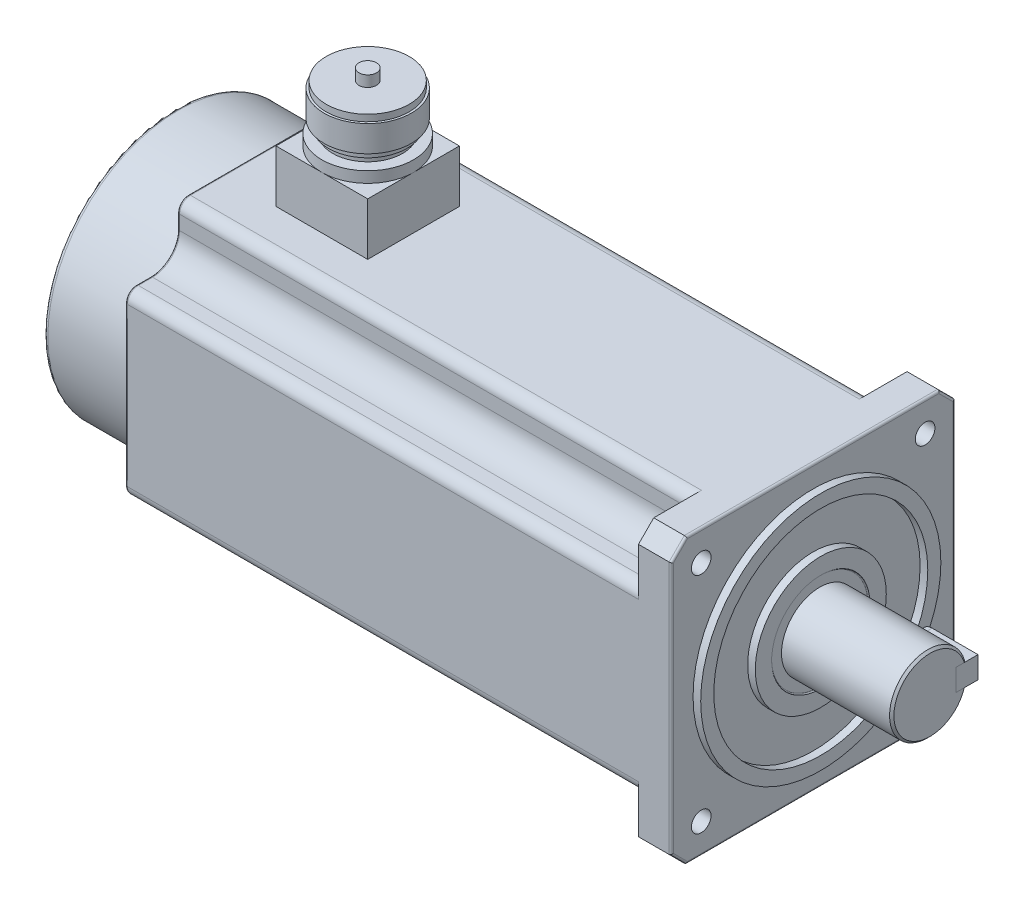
ISO-10303-21;
HEADER;
FILE_DESCRIPTION(('STEP AP214'),'2;1');
FILE_NAME('part.step','',(''),(''),'','','');
FILE_SCHEMA(('AUTOMOTIVE_DESIGN { 1 0 10303 214 1 1 1 1 }'));
ENDSEC;
DATA;
#1=APPLICATION_CONTEXT('core data for automotive mechanical design processes');
#2=APPLICATION_PROTOCOL_DEFINITION('international standard','automotive_design',2000,#1);
#3=PRODUCT_CONTEXT('',#1,'mechanical');
#4=PRODUCT('Part','Part','',(#3));
#5=PRODUCT_RELATED_PRODUCT_CATEGORY('part','',(#4));
#6=PRODUCT_DEFINITION_FORMATION('','',#4);
#7=PRODUCT_DEFINITION_CONTEXT('part definition',#1,'design');
#8=PRODUCT_DEFINITION('design','',#6,#7);
#9=PRODUCT_DEFINITION_SHAPE('','',#8);
#10=(LENGTH_UNIT() NAMED_UNIT(*) SI_UNIT(.MILLI.,.METRE.));
#11=(NAMED_UNIT(*) PLANE_ANGLE_UNIT() SI_UNIT($,.RADIAN.));
#12=(NAMED_UNIT(*) SI_UNIT($,.STERADIAN.) SOLID_ANGLE_UNIT());
#13=UNCERTAINTY_MEASURE_WITH_UNIT(LENGTH_MEASURE(1.E-05),#10,'distance_accuracy_value','');
#14=(GEOMETRIC_REPRESENTATION_CONTEXT(3) GLOBAL_UNCERTAINTY_ASSIGNED_CONTEXT((#13)) GLOBAL_UNIT_ASSIGNED_CONTEXT((#10,
#11,#12)) REPRESENTATION_CONTEXT('',''));
#15=CARTESIAN_POINT('',(0.,0.,0.));
#16=DIRECTION('',(0.,0.,1.));
#17=DIRECTION('',(1.,0.,0.));
#18=AXIS2_PLACEMENT_3D('',#15,#16,#17);
#19=CARTESIAN_POINT('',(32.5,0.,-22.));
#20=DIRECTION('',(0.,0.,1.));
#21=DIRECTION('',(1.,0.,0.));
#22=AXIS2_PLACEMENT_3D('',#19,#20,#21);
#23=CYLINDRICAL_SURFACE('',#22,5.);
#24=CARTESIAN_POINT('',(32.5,0.,-12.));
#25=DIRECTION('',(0.,0.,-1.));
#26=DIRECTION('',(-1.,0.,0.));
#27=AXIS2_PLACEMENT_3D('',#24,#25,#26);
#28=CIRCLE('',#27,5.);
#29=CARTESIAN_POINT('',(32.5,-5.,-12.));
#30=VERTEX_POINT('',#29);
#31=CARTESIAN_POINT('',(32.5,4.99999999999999,-12.));
#32=VERTEX_POINT('',#31);
#33=EDGE_CURVE('E106',#30,#32,#28,.T.);
#34=ORIENTED_EDGE('',*,*,#33,.T.);
#35=DIRECTION('',(0.,0.,1.));
#36=VECTOR('',#35,1.);
#37=CARTESIAN_POINT('',(32.5,4.99999999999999,-22.));
#38=LINE('',#37,#36);
#39=CARTESIAN_POINT('',(32.5,4.99999999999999,-22.));
#40=VERTEX_POINT('',#39);
#41=EDGE_CURVE('E12',#40,#32,#38,.T.);
#42=ORIENTED_EDGE('',*,*,#41,.F.);
#43=CARTESIAN_POINT('',(32.5,0.,-22.));
#44=DIRECTION('',(0.,0.,-1.));
#45=DIRECTION('',(-1.,0.,0.));
#46=AXIS2_PLACEMENT_3D('',#43,#44,#45);
#47=CIRCLE('',#46,5.);
#48=CARTESIAN_POINT('',(32.5,-5.,-22.));
#49=VERTEX_POINT('',#48);
#50=EDGE_CURVE('E94',#49,#40,#47,.T.);
#51=ORIENTED_EDGE('',*,*,#50,.F.);
#52=DIRECTION('',(0.,0.,1.));
#53=VECTOR('',#52,1.);
#54=CARTESIAN_POINT('',(32.5,-5.,-22.));
#55=LINE('',#54,#53);
#56=EDGE_CURVE('E102',#49,#30,#55,.T.);
#57=ORIENTED_EDGE('',*,*,#56,.T.);
#58=EDGE_LOOP('',(#34,#42,#51,#57));
#59=FACE_BOUND('',#58,.T.);
#60=ADVANCED_FACE('F43',(#59),#23,.T.);
#61=CARTESIAN_POINT('',(32.5,4.99999999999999,-22.));
#62=DIRECTION('',(0.,-1.,0.));
#63=DIRECTION('',(1.,0.,0.));
#64=AXIS2_PLACEMENT_3D('',#61,#62,#63);
#65=PLANE('',#64);
#66=DIRECTION('',(1.,0.,0.));
#67=VECTOR('',#66,1.);
#68=CARTESIAN_POINT('',(32.5,4.99999999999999,-12.));
#69=LINE('',#68,#67);
#70=CARTESIAN_POINT('',(53.5,4.99999999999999,-12.));
#71=VERTEX_POINT('',#70);
#72=EDGE_CURVE('E98',#32,#71,#69,.T.);
#73=ORIENTED_EDGE('',*,*,#72,.T.);
#74=DIRECTION('',(0.,0.,1.));
#75=VECTOR('',#74,1.);
#76=CARTESIAN_POINT('',(53.5,4.99999999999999,-22.));
#77=LINE('',#76,#75);
#78=CARTESIAN_POINT('',(53.5,4.99999999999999,-22.));
#79=VERTEX_POINT('',#78);
#80=EDGE_CURVE('E51',#79,#71,#77,.T.);
#81=ORIENTED_EDGE('',*,*,#80,.F.);
#82=DIRECTION('',(1.,0.,0.));
#83=VECTOR('',#82,1.);
#84=CARTESIAN_POINT('',(32.5,4.99999999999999,-22.));
#85=LINE('',#84,#83);
#86=EDGE_CURVE('E89',#40,#79,#85,.T.);
#87=ORIENTED_EDGE('',*,*,#86,.F.);
#88=ORIENTED_EDGE('',*,*,#41,.T.);
#89=EDGE_LOOP('',(#73,#81,#87,#88));
#90=FACE_BOUND('',#89,.T.);
#91=ADVANCED_FACE('F97',(#90),#65,.F.);
#92=CARTESIAN_POINT('',(53.5,4.99999999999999,-22.));
#93=DIRECTION('',(-1.,0.,0.));
#94=DIRECTION('',(0.,0.,1.));
#95=AXIS2_PLACEMENT_3D('',#92,#93,#94);
#96=PLANE('',#95);
#97=DIRECTION('',(0.,-1.,0.));
#98=VECTOR('',#97,1.);
#99=CARTESIAN_POINT('',(53.5,4.99999999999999,-12.));
#100=LINE('',#99,#98);
#101=CARTESIAN_POINT('',(53.5,-5.,-12.));
#102=VERTEX_POINT('',#101);
#103=EDGE_CURVE('E76',#71,#102,#100,.T.);
#104=ORIENTED_EDGE('',*,*,#103,.T.);
#105=DIRECTION('',(0.,0.,1.));
#106=VECTOR('',#105,1.);
#107=CARTESIAN_POINT('',(53.5,-5.,-22.));
#108=LINE('',#107,#106);
#109=CARTESIAN_POINT('',(53.5,-5.,-22.));
#110=VERTEX_POINT('',#109);
#111=EDGE_CURVE('E99',#110,#102,#108,.T.);
#112=ORIENTED_EDGE('',*,*,#111,.F.);
#113=DIRECTION('',(0.,-1.,0.));
#114=VECTOR('',#113,1.);
#115=CARTESIAN_POINT('',(53.5,4.99999999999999,-22.));
#116=LINE('',#115,#114);
#117=EDGE_CURVE('E92',#79,#110,#116,.T.);
#118=ORIENTED_EDGE('',*,*,#117,.F.);
#119=ORIENTED_EDGE('',*,*,#80,.T.);
#120=EDGE_LOOP('',(#104,#112,#118,#119));
#121=FACE_BOUND('',#120,.T.);
#122=ADVANCED_FACE('F100',(#121),#96,.F.);
#123=CARTESIAN_POINT('',(53.5,-5.,-22.));
#124=DIRECTION('',(0.,1.,0.));
#125=DIRECTION('',(-1.,0.,0.));
#126=AXIS2_PLACEMENT_3D('',#123,#124,#125);
#127=PLANE('',#126);
#128=DIRECTION('',(-1.,0.,0.));
#129=VECTOR('',#128,1.);
#130=CARTESIAN_POINT('',(53.5,-5.,-12.));
#131=LINE('',#130,#129);
#132=EDGE_CURVE('E82',#102,#30,#131,.T.);
#133=ORIENTED_EDGE('',*,*,#132,.T.);
#134=ORIENTED_EDGE('',*,*,#56,.F.);
#135=DIRECTION('',(-1.,0.,0.));
#136=VECTOR('',#135,1.);
#137=CARTESIAN_POINT('',(53.5,-5.,-22.));
#138=LINE('',#137,#136);
#139=EDGE_CURVE('E59',#110,#49,#138,.T.);
#140=ORIENTED_EDGE('',*,*,#139,.F.);
#141=ORIENTED_EDGE('',*,*,#111,.T.);
#142=EDGE_LOOP('',(#133,#134,#140,#141));
#143=FACE_BOUND('',#142,.T.);
#144=ADVANCED_FACE('F113',(#143),#127,.F.);
#145=CARTESIAN_POINT('',(32.5,0.,-22.));
#146=DIRECTION('',(0.,0.,-1.));
#147=DIRECTION('',(-1.,0.,0.));
#148=AXIS2_PLACEMENT_3D('',#145,#146,#147);
#149=PLANE('',#148);
#150=ORIENTED_EDGE('',*,*,#50,.T.);
#151=ORIENTED_EDGE('',*,*,#86,.T.);
#152=ORIENTED_EDGE('',*,*,#117,.T.);
#153=ORIENTED_EDGE('',*,*,#139,.T.);
#154=EDGE_LOOP('',(#150,#151,#152,#153));
#155=FACE_BOUND('',#154,.T.);
#156=ADVANCED_FACE('F90',(#155),#149,.T.);
#157=CARTESIAN_POINT('',(32.5,0.,-12.));
#158=DIRECTION('',(0.,0.,-1.));
#159=DIRECTION('',(-1.,0.,0.));
#160=AXIS2_PLACEMENT_3D('',#157,#158,#159);
#161=PLANE('',#160);
#162=ORIENTED_EDGE('',*,*,#33,.F.);
#163=ORIENTED_EDGE('',*,*,#132,.F.);
#164=ORIENTED_EDGE('',*,*,#103,.F.);
#165=ORIENTED_EDGE('',*,*,#72,.F.);
#166=EDGE_LOOP('',(#162,#163,#164,#165));
#167=FACE_BOUND('',#166,.T.);
#168=ADVANCED_FACE('F116',(#167),#161,.F.);
#169=CLOSED_SHELL('',(#60,#91,#122,#144,#156,#168));
#170=MANIFOLD_SOLID_BREP('B2',#169);
#171=CARTESIAN_POINT('',(-204.,115.,0.));
#172=DIRECTION('',(0.,1.,0.));
#173=DIRECTION('',(0.,0.,1.));
#174=AXIS2_PLACEMENT_3D('',#171,#172,#173);
#175=PLANE('',#174);
#176=CARTESIAN_POINT('',(-204.,115.,0.));
#177=DIRECTION('',(0.,1.,0.));
#178=DIRECTION('',(0.,0.,1.));
#179=AXIS2_PLACEMENT_3D('',#176,#177,#178);
#180=CIRCLE('',#179,19.);
#181=CARTESIAN_POINT('',(-204.,115.,19.));
#182=VERTEX_POINT('',#181);
#183=EDGE_CURVE('E2383',#182,#182,#180,.T.);
#184=ORIENTED_EDGE('',*,*,#183,.T.);
#185=EDGE_LOOP('',(#184));
#186=FACE_BOUND('',#185,.T.);
#187=CARTESIAN_POINT('',(-204.,115.,0.));
#188=DIRECTION('',(0.,1.,0.));
#189=DIRECTION('',(0.,0.,1.));
#190=AXIS2_PLACEMENT_3D('',#187,#188,#189);
#191=CIRCLE('',#190,3.99999999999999);
#192=CARTESIAN_POINT('',(-204.,115.,3.99999999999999));
#193=VERTEX_POINT('',#192);
#194=EDGE_CURVE('E2380',#193,#193,#191,.T.);
#195=ORIENTED_EDGE('',*,*,#194,.F.);
#196=EDGE_LOOP('',(#195));
#197=FACE_BOUND('',#196,.T.);
#198=ADVANCED_FACE('F167',(#186,#197),#175,.T.);
#199=CARTESIAN_POINT('',(-204.,112.,0.));
#200=DIRECTION('',(0.,1.,0.));
#201=DIRECTION('',(0.,0.,1.));
#202=AXIS2_PLACEMENT_3D('',#199,#200,#201);
#203=PLANE('',#202);
#204=CARTESIAN_POINT('',(-204.,112.,0.));
#205=DIRECTION('',(0.,1.,0.));
#206=DIRECTION('',(0.,0.,1.));
#207=AXIS2_PLACEMENT_3D('',#204,#205,#206);
#208=CIRCLE('',#207,20.);
#209=CARTESIAN_POINT('',(-204.,112.,20.));
#210=VERTEX_POINT('',#209);
#211=EDGE_CURVE('E2390',#210,#210,#208,.T.);
#212=ORIENTED_EDGE('',*,*,#211,.T.);
#213=EDGE_LOOP('',(#212));
#214=FACE_BOUND('',#213,.T.);
#215=CARTESIAN_POINT('',(-204.,112.,0.));
#216=DIRECTION('',(0.,1.,0.));
#217=DIRECTION('',(0.,0.,1.));
#218=AXIS2_PLACEMENT_3D('',#215,#216,#217);
#219=CIRCLE('',#218,19.);
#220=CARTESIAN_POINT('',(-204.,112.,19.));
#221=VERTEX_POINT('',#220);
#222=EDGE_CURVE('E2379',#221,#221,#219,.T.);
#223=ORIENTED_EDGE('',*,*,#222,.F.);
#224=EDGE_LOOP('',(#223));
#225=FACE_BOUND('',#224,.T.);
#226=ADVANCED_FACE('F1126',(#214,#225),#203,.T.);
#227=CARTESIAN_POINT('',(-204.,94.,0.));
#228=DIRECTION('',(0.,1.,0.));
#229=DIRECTION('',(0.,0.,1.));
#230=AXIS2_PLACEMENT_3D('',#227,#228,#229);
#231=PLANE('',#230);
#232=CARTESIAN_POINT('',(-204.,94.,0.));
#233=DIRECTION('',(0.,1.,0.));
#234=DIRECTION('',(0.,0.,1.));
#235=AXIS2_PLACEMENT_3D('',#232,#233,#234);
#236=CIRCLE('',#235,21.);
#237=CARTESIAN_POINT('',(-204.,94.,21.));
#238=VERTEX_POINT('',#237);
#239=EDGE_CURVE('E565',#238,#238,#236,.T.);
#240=ORIENTED_EDGE('',*,*,#239,.T.);
#241=EDGE_LOOP('',(#240));
#242=FACE_BOUND('',#241,.T.);
#243=CARTESIAN_POINT('',(-204.,94.,0.));
#244=DIRECTION('',(0.,1.,0.));
#245=DIRECTION('',(0.,0.,1.));
#246=AXIS2_PLACEMENT_3D('',#243,#244,#245);
#247=CIRCLE('',#246,16.);
#248=CARTESIAN_POINT('',(-204.,94.,16.));
#249=VERTEX_POINT('',#248);
#250=EDGE_CURVE('E2399',#249,#249,#247,.T.);
#251=ORIENTED_EDGE('',*,*,#250,.F.);
#252=EDGE_LOOP('',(#251));
#253=FACE_BOUND('',#252,.T.);
#254=ADVANCED_FACE('F1132',(#242,#253),#231,.T.);
#255=CARTESIAN_POINT('',(0.,89.,0.));
#256=DIRECTION('',(0.,-1.,0.));
#257=DIRECTION('',(0.,0.,-1.));
#258=AXIS2_PLACEMENT_3D('',#255,#256,#257);
#259=PLANE('',#258);
#260=CARTESIAN_POINT('',(-204.,89.,0.));
#261=DIRECTION('',(0.,1.,0.));
#262=DIRECTION('',(0.,0.,1.));
#263=AXIS2_PLACEMENT_3D('',#260,#261,#262);
#264=CIRCLE('',#263,21.);
#265=CARTESIAN_POINT('',(-204.,89.,21.));
#266=VERTEX_POINT('',#265);
#267=CARTESIAN_POINT('',(-183.,89.,0.));
#268=VERTEX_POINT('',#267);
#269=EDGE_CURVE('E183',#266,#268,#264,.T.);
#270=ORIENTED_EDGE('',*,*,#269,.F.);
#271=DIRECTION('',(1.,0.,0.));
#272=VECTOR('',#271,1.);
#273=CARTESIAN_POINT('',(-225.,89.,21.));
#274=LINE('',#273,#272);
#275=CARTESIAN_POINT('',(-183.,89.,21.));
#276=VERTEX_POINT('',#275);
#277=EDGE_CURVE('E551',#266,#276,#274,.T.);
#278=ORIENTED_EDGE('',*,*,#277,.T.);
#279=DIRECTION('',(0.,0.,-1.));
#280=VECTOR('',#279,1.);
#281=CARTESIAN_POINT('',(-183.,89.,21.));
#282=LINE('',#281,#280);
#283=EDGE_CURVE('E563',#276,#268,#282,.T.);
#284=ORIENTED_EDGE('',*,*,#283,.T.);
#285=EDGE_LOOP('',(#270,#278,#284));
#286=FACE_BOUND('',#285,.T.);
#287=ADVANCED_FACE('F562',(#286),#259,.F.);
#288=CARTESIAN_POINT('',(-204.,89.,-21.));
#289=VERTEX_POINT('',#288);
#290=EDGE_CURVE('E41',#268,#289,#264,.T.);
#291=ORIENTED_EDGE('',*,*,#290,.F.);
#292=CARTESIAN_POINT('',(-183.,89.,-21.));
#293=VERTEX_POINT('',#292);
#294=EDGE_CURVE('E574',#268,#293,#282,.T.);
#295=ORIENTED_EDGE('',*,*,#294,.T.);
#296=DIRECTION('',(-1.,0.,0.));
#297=VECTOR('',#296,1.);
#298=CARTESIAN_POINT('',(-225.,89.,-21.));
#299=LINE('',#298,#297);
#300=EDGE_CURVE('E575',#293,#289,#299,.T.);
#301=ORIENTED_EDGE('',*,*,#300,.T.);
#302=EDGE_LOOP('',(#291,#295,#301));
#303=FACE_BOUND('',#302,.T.);
#304=ADVANCED_FACE('F1173',(#303),#259,.F.);
#305=CARTESIAN_POINT('',(-225.,89.,0.));
#306=VERTEX_POINT('',#305);
#307=EDGE_CURVE('E181',#289,#306,#264,.T.);
#308=ORIENTED_EDGE('',*,*,#307,.F.);
#309=CARTESIAN_POINT('',(-225.,89.,-21.));
#310=VERTEX_POINT('',#309);
#311=EDGE_CURVE('E573',#289,#310,#299,.T.);
#312=ORIENTED_EDGE('',*,*,#311,.T.);
#313=DIRECTION('',(0.,0.,1.));
#314=VECTOR('',#313,1.);
#315=CARTESIAN_POINT('',(-225.,89.,21.));
#316=LINE('',#315,#314);
#317=EDGE_CURVE('E560',#310,#306,#316,.T.);
#318=ORIENTED_EDGE('',*,*,#317,.T.);
#319=EDGE_LOOP('',(#308,#312,#318));
#320=FACE_BOUND('',#319,.T.);
#321=ADVANCED_FACE('F1327',(#320),#259,.F.);
#322=EDGE_CURVE('E190',#306,#266,#264,.T.);
#323=ORIENTED_EDGE('',*,*,#322,.F.);
#324=CARTESIAN_POINT('',(-225.,89.,21.));
#325=VERTEX_POINT('',#324);
#326=EDGE_CURVE('E547',#306,#325,#316,.T.);
#327=ORIENTED_EDGE('',*,*,#326,.T.);
#328=EDGE_CURVE('E544',#325,#266,#274,.T.);
#329=ORIENTED_EDGE('',*,*,#328,.T.);
#330=EDGE_LOOP('',(#323,#327,#329));
#331=FACE_BOUND('',#330,.T.);
#332=ADVANCED_FACE('F546',(#331),#259,.F.);
#333=CARTESIAN_POINT('',(-250.,65.,58.));
#334=DIRECTION('',(0.,1.,0.));
#335=DIRECTION('',(0.,0.,1.));
#336=AXIS2_PLACEMENT_3D('',#333,#334,#335);
#337=PLANE('',#336);
#338=DIRECTION('',(-1.,0.,0.));
#339=VECTOR('',#338,1.);
#340=CARTESIAN_POINT('',(-15.,65.,-36.1509109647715));
#341=LINE('',#340,#339);
#342=CARTESIAN_POINT('',(-15.,65.,-36.1509109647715));
#343=VERTEX_POINT('',#342);
#344=CARTESIAN_POINT('',(-249.,65.,-36.1509109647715));
#345=VERTEX_POINT('',#344);
#346=EDGE_CURVE('E813',#343,#345,#341,.T.);
#347=ORIENTED_EDGE('',*,*,#346,.T.);
#348=DIRECTION('',(0.,0.,1.));
#349=VECTOR('',#348,1.);
#350=CARTESIAN_POINT('',(-249.,65.,36.1509109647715));
#351=LINE('',#350,#349);
#352=CARTESIAN_POINT('',(-249.,65.,36.1509109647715));
#353=VERTEX_POINT('',#352);
#354=EDGE_CURVE('E991',#345,#353,#351,.T.);
#355=ORIENTED_EDGE('',*,*,#354,.T.);
#356=DIRECTION('',(-1.,0.,0.));
#357=VECTOR('',#356,1.);
#358=CARTESIAN_POINT('',(-15.,65.,36.1509109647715));
#359=LINE('',#358,#357);
#360=CARTESIAN_POINT('',(-15.,65.,36.1509109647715));
#361=VERTEX_POINT('',#360);
#362=EDGE_CURVE('E734',#361,#353,#359,.T.);
#363=ORIENTED_EDGE('',*,*,#362,.F.);
#364=DIRECTION('',(0.,0.,-1.));
#365=VECTOR('',#364,1.);
#366=CARTESIAN_POINT('',(-15.,65.,58.));
#367=LINE('',#366,#365);
#368=CARTESIAN_POINT('',(-15.,65.,58.));
#369=VERTEX_POINT('',#368);
#370=EDGE_CURVE('E730',#369,#361,#367,.T.);
#371=ORIENTED_EDGE('',*,*,#370,.F.);
#372=DIRECTION('',(1.,0.,0.));
#373=VECTOR('',#372,1.);
#374=CARTESIAN_POINT('',(-250.,65.,58.));
#375=LINE('',#374,#373);
#376=CARTESIAN_POINT('',(-1.,65.,58.));
#377=VERTEX_POINT('',#376);
#378=EDGE_CURVE('E817',#369,#377,#375,.T.);
#379=ORIENTED_EDGE('',*,*,#378,.T.);
#380=DIRECTION('',(0.,0.,1.));
#381=VECTOR('',#380,1.);
#382=CARTESIAN_POINT('',(-1.,65.,58.));
#383=LINE('',#382,#381);
#384=CARTESIAN_POINT('',(-1.,65.,-58.));
#385=VERTEX_POINT('',#384);
#386=EDGE_CURVE('E887',#377,#385,#383,.F.);
#387=ORIENTED_EDGE('',*,*,#386,.T.);
#388=DIRECTION('',(1.,0.,0.));
#389=VECTOR('',#388,1.);
#390=CARTESIAN_POINT('',(-250.,65.,-58.));
#391=LINE('',#390,#389);
#392=CARTESIAN_POINT('',(-15.,65.,-58.));
#393=VERTEX_POINT('',#392);
#394=EDGE_CURVE('E832',#393,#385,#391,.T.);
#395=ORIENTED_EDGE('',*,*,#394,.F.);
#396=DIRECTION('',(0.,0.,-1.));
#397=VECTOR('',#396,1.);
#398=CARTESIAN_POINT('',(-15.,65.,-36.1509109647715));
#399=LINE('',#398,#397);
#400=EDGE_CURVE('E794',#343,#393,#399,.T.);
#401=ORIENTED_EDGE('',*,*,#400,.F.);
#402=EDGE_LOOP('',(#347,#355,#363,#371,#379,#387,#395,#401));
#403=FACE_BOUND('',#402,.T.);
#404=DIRECTION('',(-1.,0.,0.));
#405=VECTOR('',#404,1.);
#406=CARTESIAN_POINT('',(-225.,65.,-21.));
#407=LINE('',#406,#405);
#408=CARTESIAN_POINT('',(-183.,65.,-21.));
#409=VERTEX_POINT('',#408);
#410=CARTESIAN_POINT('',(-225.,65.,-21.));
#411=VERTEX_POINT('',#410);
#412=EDGE_CURVE('E582',#409,#411,#407,.T.);
#413=ORIENTED_EDGE('',*,*,#412,.F.);
#414=DIRECTION('',(0.,0.,-1.));
#415=VECTOR('',#414,1.);
#416=CARTESIAN_POINT('',(-183.,65.,21.));
#417=LINE('',#416,#415);
#418=CARTESIAN_POINT('',(-183.,65.,21.));
#419=VERTEX_POINT('',#418);
#420=EDGE_CURVE('E579',#419,#409,#417,.T.);
#421=ORIENTED_EDGE('',*,*,#420,.F.);
#422=DIRECTION('',(1.,0.,0.));
#423=VECTOR('',#422,1.);
#424=CARTESIAN_POINT('',(-225.,65.,21.));
#425=LINE('',#424,#423);
#426=CARTESIAN_POINT('',(-225.,65.,21.));
#427=VERTEX_POINT('',#426);
#428=EDGE_CURVE('E587',#427,#419,#425,.T.);
#429=ORIENTED_EDGE('',*,*,#428,.F.);
#430=DIRECTION('',(0.,0.,1.));
#431=VECTOR('',#430,1.);
#432=CARTESIAN_POINT('',(-225.,65.,21.));
#433=LINE('',#432,#431);
#434=EDGE_CURVE('E584',#411,#427,#433,.T.);
#435=ORIENTED_EDGE('',*,*,#434,.F.);
#436=EDGE_LOOP('',(#413,#421,#429,#435));
#437=FACE_BOUND('',#436,.T.);
#438=ADVANCED_FACE('F1123',(#403,#437),#337,.T.);
#439=CARTESIAN_POINT('',(53.5,0.,0.));
#440=DIRECTION('',(-1.,0.,0.));
#441=DIRECTION('',(0.,0.,1.));
#442=AXIS2_PLACEMENT_3D('',#439,#440,#441);
#443=CYLINDRICAL_SURFACE('',#442,17.5);
#444=CARTESIAN_POINT('',(3.,0.,0.));
#445=DIRECTION('',(1.,0.,0.));
#446=DIRECTION('',(0.,0.,-1.));
#447=AXIS2_PLACEMENT_3D('',#444,#445,#446);
#448=CIRCLE('',#447,17.5);
#449=CARTESIAN_POINT('',(3.,0.,-17.5));
#450=VERTEX_POINT('',#449);
#451=EDGE_CURVE('E624',#450,#450,#448,.T.);
#452=ORIENTED_EDGE('',*,*,#451,.T.);
#453=EDGE_LOOP('',(#452));
#454=FACE_BOUND('',#453,.T.);
#455=DIRECTION('',(-1.,0.,0.));
#456=VECTOR('',#455,1.);
#457=CARTESIAN_POINT('',(53.5,-5.,-16.7705098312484));
#458=LINE('',#457,#456);
#459=CARTESIAN_POINT('',(52.5,-5.,-16.7705098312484));
#460=VERTEX_POINT('',#459);
#461=CARTESIAN_POINT('',(32.5,-5.,-16.7705098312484));
#462=VERTEX_POINT('',#461);
#463=EDGE_CURVE('E622',#460,#462,#458,.T.);
#464=ORIENTED_EDGE('',*,*,#463,.F.);
#465=CARTESIAN_POINT('',(52.5,0.,0.));
#466=DIRECTION('',(1.,0.,0.));
#467=DIRECTION('',(0.,0.,-1.));
#468=AXIS2_PLACEMENT_3D('',#465,#466,#467);
#469=CIRCLE('',#468,17.5);
#470=CARTESIAN_POINT('',(52.5,4.99999999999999,-16.7705098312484));
#471=VERTEX_POINT('',#470);
#472=EDGE_CURVE('E568',#460,#471,#469,.F.);
#473=ORIENTED_EDGE('',*,*,#472,.T.);
#474=DIRECTION('',(-1.,0.,0.));
#475=VECTOR('',#474,1.);
#476=CARTESIAN_POINT('',(53.5,4.99999999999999,-16.7705098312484));
#477=LINE('',#476,#475);
#478=CARTESIAN_POINT('',(32.5,4.99999999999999,-16.7705098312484));
#479=VERTEX_POINT('',#478);
#480=EDGE_CURVE('E619',#479,#471,#477,.F.);
#481=ORIENTED_EDGE('',*,*,#480,.F.);
#482=CARTESIAN_POINT('',(32.5,-5.,-16.7705098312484));
#483=CARTESIAN_POINT('',(32.3624562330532,-5.00001814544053,-16.7704912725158));
#484=CARTESIAN_POINT('',(32.2249193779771,-4.99432529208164,-16.7722013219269));
#485=CARTESIAN_POINT('',(31.9508888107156,-4.97165222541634,-16.7789431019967));
#486=CARTESIAN_POINT('',(31.8143948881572,-4.95467435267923,-16.7839741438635));
#487=CARTESIAN_POINT('',(31.5437415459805,-4.90961903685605,-16.7972068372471));
#488=CARTESIAN_POINT('',(31.4095773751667,-4.88156789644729,-16.8054009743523));
#489=CARTESIAN_POINT('',(31.1442003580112,-4.81461674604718,-16.8247046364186));
#490=CARTESIAN_POINT('',(31.012987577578,-4.77571649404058,-16.8358142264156));
#491=CARTESIAN_POINT('',(30.7544683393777,-4.68740449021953,-16.8606149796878));
#492=CARTESIAN_POINT('',(30.627159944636,-4.63799805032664,-16.874304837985));
#493=CARTESIAN_POINT('',(30.3772006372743,-4.52905522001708,-16.9038705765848));
#494=CARTESIAN_POINT('',(30.2545514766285,-4.46951506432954,-16.9197472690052));
#495=CARTESIAN_POINT('',(29.894791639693,-4.27631278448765,-16.9699997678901));
#496=CARTESIAN_POINT('',(29.6657016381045,-4.12801150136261,-17.007014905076));
#497=CARTESIAN_POINT('',(29.2294860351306,-3.79229915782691,-17.0850471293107));
#498=CARTESIAN_POINT('',(29.023079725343,-3.60397767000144,-17.1261428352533));
#499=CARTESIAN_POINT('',(28.6442623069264,-3.19544341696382,-17.2070462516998));
#500=CARTESIAN_POINT('',(28.471856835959,-2.97522537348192,-17.2468537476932));
#501=CARTESIAN_POINT('',(28.1629219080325,-2.5041085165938,-17.3215844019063));
#502=CARTESIAN_POINT('',(28.0271190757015,-2.25271539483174,-17.3564029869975));
#503=CARTESIAN_POINT('',(27.7999922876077,-1.72950937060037,-17.4163145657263));
#504=CARTESIAN_POINT('',(27.7086576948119,-1.45770136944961,-17.4414098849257));
#505=CARTESIAN_POINT('',(27.5754142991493,-0.908899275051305,-17.4784878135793));
#506=CARTESIAN_POINT('',(27.5322781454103,-0.632225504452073,-17.4907954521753));
#507=CARTESIAN_POINT('',(27.4927833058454,-0.0753060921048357,-17.5020523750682));
#508=CARTESIAN_POINT('',(27.4964166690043,0.204938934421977,-17.5010039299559));
#509=CARTESIAN_POINT('',(27.5495154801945,0.752451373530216,-17.4859002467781));
#510=CARTESIAN_POINT('',(27.5976523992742,1.0198597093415,-17.4722220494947));
#511=CARTESIAN_POINT('',(27.7362408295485,1.54263514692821,-17.4338464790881));
#512=CARTESIAN_POINT('',(27.8266944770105,1.79800164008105,-17.4091485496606));
#513=CARTESIAN_POINT('',(28.0482663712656,2.29267928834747,-17.3509771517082));
#514=CARTESIAN_POINT('',(28.1798189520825,2.53178407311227,-17.3174105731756));
#515=CARTESIAN_POINT('',(28.4796443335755,2.98504901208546,-17.2450626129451));
#516=CARTESIAN_POINT('',(28.6479245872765,3.19920408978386,-17.2062801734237));
#517=CARTESIAN_POINT('',(28.9276273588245,3.50113424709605,-17.1465202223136));
#518=CARTESIAN_POINT('',(29.0273638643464,3.6000742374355,-17.1259700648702));
#519=CARTESIAN_POINT('',(29.2348202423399,3.7892313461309,-17.0851123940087));
#520=CARTESIAN_POINT('',(29.3425373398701,3.87945147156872,-17.0648047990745));
#521=CARTESIAN_POINT('',(29.5653450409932,4.05062437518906,-17.0249868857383));
#522=CARTESIAN_POINT('',(29.6804405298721,4.13157091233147,-17.005477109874));
#523=CARTESIAN_POINT('',(29.917160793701,4.28353981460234,-16.9678346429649));
#524=CARTESIAN_POINT('',(30.0387830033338,4.35456603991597,-16.9497014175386));
#525=CARTESIAN_POINT('',(30.2889159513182,4.48679157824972,-16.9151829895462));
#526=CARTESIAN_POINT('',(30.4174786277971,4.54789718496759,-16.898814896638));
#527=CARTESIAN_POINT('',(30.67954149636,4.65898872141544,-16.8685251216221));
#528=CARTESIAN_POINT('',(30.8130396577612,4.70897916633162,-16.8546024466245));
#529=CARTESIAN_POINT('',(31.0839210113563,4.79739484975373,-16.829649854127));
#530=CARTESIAN_POINT('',(31.2212999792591,4.835832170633,-16.8186169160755));
#531=CARTESIAN_POINT('',(31.4989955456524,4.90084834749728,-16.7997865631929));
#532=CARTESIAN_POINT('',(31.6393107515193,4.92743269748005,-16.7919876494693));
#533=CARTESIAN_POINT('',(31.8996651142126,4.96528740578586,-16.7808301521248));
#534=CARTESIAN_POINT('',(32.0194316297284,4.97830600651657,-16.776966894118));
#535=CARTESIAN_POINT('',(32.2594622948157,4.99566040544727,-16.7718034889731));
#536=CARTESIAN_POINT('',(32.379725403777,5.0000094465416,-16.7704994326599));
#537=CARTESIAN_POINT('',(32.5,4.99999999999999,-16.7705098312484));
#538=B_SPLINE_CURVE_WITH_KNOTS('',3,(#482,#483,#484,#485,#486,#487,#488,#489,#490,#491,#492,
#493,#494,#495,#496,#497,#498,#499,#500,#501,#502,#503,#504,#505,#506,#507,#508,#509,#510,#511,
#512,#513,#514,#515,#516,#517,#518,#519,#520,#521,#522,#523,#524,#525,#526,#527,#528,#529,#530,
#531,#532,#533,#534,#535,#536,#537),.UNSPECIFIED.,.F.,.F.,(4,2,2,2,2,2,2,2,2,2,2,2,2,2,2,2,2,2,
2,2,2,2,2,2,2,2,2,4),(0.,0.412492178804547,0.824898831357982,1.23633171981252,1.64777378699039,
2.05900832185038,2.47039598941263,3.29264569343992,4.13611232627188,4.9797186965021,
5.83900986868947,6.69809539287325,7.53476732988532,8.3712970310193,9.18363381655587,
9.99601161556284,10.8172828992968,11.6387209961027,12.0642579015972,12.489647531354,
12.9153217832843,13.3408299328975,13.7701489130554,14.1992931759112,14.6279870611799,
15.056482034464,15.4177510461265,15.7784677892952),.UNSPECIFIED.);
#539=EDGE_CURVE('E1092',#462,#479,#538,.T.);
#540=ORIENTED_EDGE('',*,*,#539,.F.);
#541=EDGE_LOOP('',(#464,#473,#481,#540));
#542=FACE_BOUND('',#541,.T.);
#543=ADVANCED_FACE('F1101',(#454,#542),#443,.T.);
#544=CARTESIAN_POINT('',(53.5,0.,0.));
#545=DIRECTION('',(1.,0.,0.));
#546=DIRECTION('',(0.,0.,-1.));
#547=AXIS2_PLACEMENT_3D('',#544,#545,#546);
#548=PLANE('',#547);
#549=DIRECTION('',(0.,0.,-1.));
#550=VECTOR('',#549,1.);
#551=CARTESIAN_POINT('',(53.5,4.99999999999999,-12.));
#552=LINE('',#551,#550);
#553=CARTESIAN_POINT('',(53.5,4.99999999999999,-12.));
#554=VERTEX_POINT('',#553);
#555=CARTESIAN_POINT('',(53.5,4.99999999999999,-15.7241851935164));
#556=VERTEX_POINT('',#555);
#557=EDGE_CURVE('E610',#554,#556,#552,.T.);
#558=ORIENTED_EDGE('',*,*,#557,.T.);
#559=CARTESIAN_POINT('',(53.5,0.,0.));
#560=DIRECTION('',(1.,0.,0.));
#561=DIRECTION('',(0.,0.,-1.));
#562=AXIS2_PLACEMENT_3D('',#559,#560,#561);
#563=CIRCLE('',#562,16.5);
#564=CARTESIAN_POINT('',(53.5,-5.,-15.7241851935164));
#565=VERTEX_POINT('',#564);
#566=EDGE_CURVE('E1099',#556,#565,#563,.T.);
#567=ORIENTED_EDGE('',*,*,#566,.T.);
#568=DIRECTION('',(0.,0.,-1.));
#569=VECTOR('',#568,1.);
#570=CARTESIAN_POINT('',(53.5,-5.,-12.));
#571=LINE('',#570,#569);
#572=CARTESIAN_POINT('',(53.5,-5.,-12.));
#573=VERTEX_POINT('',#572);
#574=EDGE_CURVE('E613',#573,#565,#571,.T.);
#575=ORIENTED_EDGE('',*,*,#574,.F.);
#576=DIRECTION('',(0.,1.,0.));
#577=VECTOR('',#576,1.);
#578=CARTESIAN_POINT('',(53.5,4.99999999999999,-12.));
#579=LINE('',#578,#577);
#580=EDGE_CURVE('E602',#573,#554,#579,.T.);
#581=ORIENTED_EDGE('',*,*,#580,.T.);
#582=EDGE_LOOP('',(#558,#567,#575,#581));
#583=FACE_BOUND('',#582,.T.);
#584=ADVANCED_FACE('F1113',(#583),#548,.T.);
#585=CARTESIAN_POINT('',(3.,0.,0.));
#586=DIRECTION('',(1.,0.,0.));
#587=DIRECTION('',(0.,0.,-1.));
#588=AXIS2_PLACEMENT_3D('',#585,#586,#587);
#589=PLANE('',#588);
#590=CARTESIAN_POINT('',(3.,0.,0.));
#591=DIRECTION('',(1.,0.,0.));
#592=DIRECTION('',(0.,0.,-1.));
#593=AXIS2_PLACEMENT_3D('',#590,#591,#592);
#594=CIRCLE('',#593,22.);
#595=CARTESIAN_POINT('',(3.,0.,-22.));
#596=VERTEX_POINT('',#595);
#597=EDGE_CURVE('E1089',#596,#596,#594,.T.);
#598=ORIENTED_EDGE('',*,*,#597,.T.);
#599=EDGE_LOOP('',(#598));
#600=FACE_BOUND('',#599,.T.);
#601=ORIENTED_EDGE('',*,*,#451,.F.);
#602=EDGE_LOOP('',(#601));
#603=FACE_BOUND('',#602,.T.);
#604=ADVANCED_FACE('F1115',(#600,#603),#589,.T.);
#605=CARTESIAN_POINT('',(0.,0.,0.));
#606=DIRECTION('',(1.,0.,0.));
#607=DIRECTION('',(0.,0.,-1.));
#608=AXIS2_PLACEMENT_3D('',#605,#606,#607);
#609=PLANE('',#608);
#610=DIRECTION('',(0.,1.,0.));
#611=VECTOR('',#610,1.);
#612=CARTESIAN_POINT('',(0.,0.,-64.));
#613=LINE('',#612,#611);
#614=CARTESIAN_POINT('',(0.,-57.5857864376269,-64.));
#615=VERTEX_POINT('',#614);
#616=CARTESIAN_POINT('',(0.,57.5857864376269,-64.));
#617=VERTEX_POINT('',#616);
#618=EDGE_CURVE('E867',#615,#617,#613,.T.);
#619=ORIENTED_EDGE('',*,*,#618,.T.);
#620=DIRECTION('',(0.,0.707106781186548,0.707106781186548));
#621=VECTOR('',#620,1.);
#622=CARTESIAN_POINT('',(0.,60.7928932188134,-60.7928932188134));
#623=LINE('',#622,#621);
#624=CARTESIAN_POINT('',(0.,64.,-57.5857864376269));
#625=VERTEX_POINT('',#624);
#626=EDGE_CURVE('E869',#617,#625,#623,.T.);
#627=ORIENTED_EDGE('',*,*,#626,.T.);
#628=DIRECTION('',(0.,0.,1.));
#629=VECTOR('',#628,1.);
#630=CARTESIAN_POINT('',(0.,64.,0.));
#631=LINE('',#630,#629);
#632=CARTESIAN_POINT('',(0.,64.,57.5857864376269));
#633=VERTEX_POINT('',#632);
#634=EDGE_CURVE('E835',#625,#633,#631,.T.);
#635=ORIENTED_EDGE('',*,*,#634,.T.);
#636=DIRECTION('',(0.,-0.707106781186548,0.707106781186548));
#637=VECTOR('',#636,1.);
#638=CARTESIAN_POINT('',(0.,60.7928932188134,60.7928932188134));
#639=LINE('',#638,#637);
#640=CARTESIAN_POINT('',(0.,57.5857864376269,64.));
#641=VERTEX_POINT('',#640);
#642=EDGE_CURVE('E857',#633,#641,#639,.T.);
#643=ORIENTED_EDGE('',*,*,#642,.T.);
#644=DIRECTION('',(0.,-1.,0.));
#645=VECTOR('',#644,1.);
#646=CARTESIAN_POINT('',(0.,0.,64.));
#647=LINE('',#646,#645);
#648=CARTESIAN_POINT('',(0.,-57.5857864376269,64.));
#649=VERTEX_POINT('',#648);
#650=EDGE_CURVE('E859',#641,#649,#647,.T.);
#651=ORIENTED_EDGE('',*,*,#650,.T.);
#652=DIRECTION('',(0.,-0.707106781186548,-0.707106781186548));
#653=VECTOR('',#652,1.);
#654=CARTESIAN_POINT('',(0.,-60.7928932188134,60.7928932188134));
#655=LINE('',#654,#653);
#656=CARTESIAN_POINT('',(0.,-64.,57.5857864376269));
#657=VERTEX_POINT('',#656);
#658=EDGE_CURVE('E861',#649,#657,#655,.T.);
#659=ORIENTED_EDGE('',*,*,#658,.T.);
#660=DIRECTION('',(0.,0.,-1.));
#661=VECTOR('',#660,1.);
#662=CARTESIAN_POINT('',(0.,-64.,0.));
#663=LINE('',#662,#661);
#664=CARTESIAN_POINT('',(0.,-64.,-57.5857864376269));
#665=VERTEX_POINT('',#664);
#666=EDGE_CURVE('E863',#657,#665,#663,.T.);
#667=ORIENTED_EDGE('',*,*,#666,.T.);
#668=DIRECTION('',(0.,0.707106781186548,-0.707106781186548));
#669=VECTOR('',#668,1.);
#670=CARTESIAN_POINT('',(0.,-60.7928932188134,-60.7928932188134));
#671=LINE('',#670,#669);
#672=EDGE_CURVE('E865',#665,#615,#671,.T.);
#673=ORIENTED_EDGE('',*,*,#672,.T.);
#674=EDGE_LOOP('',(#619,#627,#635,#643,#651,#659,#667,#673));
#675=FACE_BOUND('',#674,.T.);
#676=CARTESIAN_POINT('',(0.,51.2652416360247,51.2652416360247));
#677=DIRECTION('',(1.,0.,0.));
#678=DIRECTION('',(0.,0.,-1.));
#679=AXIS2_PLACEMENT_3D('',#676,#677,#678);
#680=CIRCLE('',#679,4.5);
#681=CARTESIAN_POINT('',(0.,51.2652416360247,46.7652416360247));
#682=VERTEX_POINT('',#681);
#683=EDGE_CURVE('E661',#682,#682,#680,.T.);
#684=ORIENTED_EDGE('',*,*,#683,.F.);
#685=EDGE_LOOP('',(#684));
#686=FACE_BOUND('',#685,.T.);
#687=CARTESIAN_POINT('',(0.,51.2652416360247,-51.2652416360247));
#688=DIRECTION('',(1.,0.,0.));
#689=DIRECTION('',(0.,0.,-1.));
#690=AXIS2_PLACEMENT_3D('',#687,#688,#689);
#691=CIRCLE('',#690,4.5);
#692=CARTESIAN_POINT('',(0.,51.2652416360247,-55.7652416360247));
#693=VERTEX_POINT('',#692);
#694=EDGE_CURVE('E655',#693,#693,#691,.T.);
#695=ORIENTED_EDGE('',*,*,#694,.F.);
#696=EDGE_LOOP('',(#695));
#697=FACE_BOUND('',#696,.T.);
#698=CARTESIAN_POINT('',(0.,-51.2652416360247,-51.2652416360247));
#699=DIRECTION('',(1.,0.,0.));
#700=DIRECTION('',(0.,0.,-1.));
#701=AXIS2_PLACEMENT_3D('',#698,#699,#700);
#702=CIRCLE('',#701,4.5);
#703=CARTESIAN_POINT('',(0.,-51.2652416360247,-55.7652416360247));
#704=VERTEX_POINT('',#703);
#705=EDGE_CURVE('E649',#704,#704,#702,.T.);
#706=ORIENTED_EDGE('',*,*,#705,.F.);
#707=EDGE_LOOP('',(#706));
#708=FACE_BOUND('',#707,.T.);
#709=CARTESIAN_POINT('',(0.,-51.2652416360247,51.2652416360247));
#710=DIRECTION('',(1.,0.,0.));
#711=DIRECTION('',(0.,0.,-1.));
#712=AXIS2_PLACEMENT_3D('',#709,#710,#711);
#713=CIRCLE('',#712,4.5);
#714=CARTESIAN_POINT('',(0.,-51.2652416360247,46.7652416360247));
#715=VERTEX_POINT('',#714);
#716=EDGE_CURVE('E643',#715,#715,#713,.T.);
#717=ORIENTED_EDGE('',*,*,#716,.F.);
#718=EDGE_LOOP('',(#717));
#719=FACE_BOUND('',#718,.T.);
#720=CARTESIAN_POINT('',(0.,0.,0.));
#721=DIRECTION('',(1.,0.,0.));
#722=DIRECTION('',(0.,0.,-1.));
#723=AXIS2_PLACEMENT_3D('',#720,#721,#722);
#724=CIRCLE('',#723,55.);
#725=CARTESIAN_POINT('',(0.,0.,-55.));
#726=VERTEX_POINT('',#725);
#727=EDGE_CURVE('E633',#726,#726,#724,.T.);
#728=ORIENTED_EDGE('',*,*,#727,.F.);
#729=EDGE_LOOP('',(#728));
#730=FACE_BOUND('',#729,.T.);
#731=ADVANCED_FACE('F1121',(#675,#686,#697,#708,#719,#730),#609,.T.);
#732=CARTESIAN_POINT('',(-250.,0.,0.));
#733=DIRECTION('',(1.,0.,0.));
#734=DIRECTION('',(0.,0.,-1.));
#735=AXIS2_PLACEMENT_3D('',#732,#733,#734);
#736=PLANE('',#735);
#737=DIRECTION('',(0.,-1.,0.));
#738=VECTOR('',#737,1.);
#739=CARTESIAN_POINT('',(-250.,0.,40.1509109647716));
#740=LINE('',#739,#738);
#741=CARTESIAN_POINT('',(-250.,-60.,40.1509109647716));
#742=VERTEX_POINT('',#741);
#743=CARTESIAN_POINT('',(-250.,-53.5,40.1509109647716));
#744=VERTEX_POINT('',#743);
#745=EDGE_CURVE('E958',#742,#744,#740,.F.);
#746=ORIENTED_EDGE('',*,*,#745,.T.);
#747=CARTESIAN_POINT('',(-250.,-53.5,53.5));
#748=DIRECTION('',(1.,0.,0.));
#749=DIRECTION('',(0.,0.,-1.));
#750=AXIS2_PLACEMENT_3D('',#747,#748,#749);
#751=CIRCLE('',#750,13.3490890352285);
#752=CARTESIAN_POINT('',(-250.,-40.1509109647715,53.5));
#753=VERTEX_POINT('',#752);
#754=EDGE_CURVE('E960',#744,#753,#751,.T.);
#755=ORIENTED_EDGE('',*,*,#754,.T.);
#756=DIRECTION('',(0.,0.,-1.));
#757=VECTOR('',#756,1.);
#758=CARTESIAN_POINT('',(-250.,-40.1509109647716,0.));
#759=LINE('',#758,#757);
#760=CARTESIAN_POINT('',(-250.,-40.1509109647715,60.));
#761=VERTEX_POINT('',#760);
#762=EDGE_CURVE('E914',#753,#761,#759,.F.);
#763=ORIENTED_EDGE('',*,*,#762,.T.);
#764=CARTESIAN_POINT('',(-250.,-36.1509109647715,60.));
#765=DIRECTION('',(1.,0.,0.));
#766=DIRECTION('',(0.,0.,-1.));
#767=AXIS2_PLACEMENT_3D('',#764,#765,#766);
#768=CIRCLE('',#767,4.);
#769=CARTESIAN_POINT('',(-250.,-36.1509109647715,64.));
#770=VERTEX_POINT('',#769);
#771=EDGE_CURVE('E916',#761,#770,#768,.F.);
#772=ORIENTED_EDGE('',*,*,#771,.T.);
#773=DIRECTION('',(0.,-1.,0.));
#774=VECTOR('',#773,1.);
#775=CARTESIAN_POINT('',(-250.,36.1509109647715,64.));
#776=LINE('',#775,#774);
#777=CARTESIAN_POINT('',(-250.,36.1509109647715,64.));
#778=VERTEX_POINT('',#777);
#779=EDGE_CURVE('E918',#770,#778,#776,.F.);
#780=ORIENTED_EDGE('',*,*,#779,.T.);
#781=CARTESIAN_POINT('',(-250.,36.1509109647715,60.));
#782=DIRECTION('',(1.,0.,0.));
#783=DIRECTION('',(0.,0.,-1.));
#784=AXIS2_PLACEMENT_3D('',#781,#782,#783);
#785=CIRCLE('',#784,4.);
#786=CARTESIAN_POINT('',(-250.,40.1509109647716,60.));
#787=VERTEX_POINT('',#786);
#788=EDGE_CURVE('E920',#778,#787,#785,.F.);
#789=ORIENTED_EDGE('',*,*,#788,.T.);
#790=DIRECTION('',(0.,0.,1.));
#791=VECTOR('',#790,1.);
#792=CARTESIAN_POINT('',(-250.,40.1509109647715,0.));
#793=LINE('',#792,#791);
#794=CARTESIAN_POINT('',(-250.,40.1509109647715,53.5));
#795=VERTEX_POINT('',#794);
#796=EDGE_CURVE('E922',#787,#795,#793,.F.);
#797=ORIENTED_EDGE('',*,*,#796,.T.);
#798=CARTESIAN_POINT('',(-250.,53.5,53.5));
#799=DIRECTION('',(1.,0.,0.));
#800=DIRECTION('',(0.,0.,-1.));
#801=AXIS2_PLACEMENT_3D('',#798,#799,#800);
#802=CIRCLE('',#801,13.3490890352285);
#803=CARTESIAN_POINT('',(-250.,53.5,40.1509109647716));
#804=VERTEX_POINT('',#803);
#805=EDGE_CURVE('E924',#795,#804,#802,.T.);
#806=ORIENTED_EDGE('',*,*,#805,.T.);
#807=DIRECTION('',(0.,-1.,0.));
#808=VECTOR('',#807,1.);
#809=CARTESIAN_POINT('',(-250.,0.,40.1509109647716));
#810=LINE('',#809,#808);
#811=CARTESIAN_POINT('',(-250.,60.,40.1509109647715));
#812=VERTEX_POINT('',#811);
#813=EDGE_CURVE('E926',#804,#812,#810,.F.);
#814=ORIENTED_EDGE('',*,*,#813,.T.);
#815=CARTESIAN_POINT('',(-250.,60.,36.1509109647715));
#816=DIRECTION('',(1.,0.,0.));
#817=DIRECTION('',(0.,0.,-1.));
#818=AXIS2_PLACEMENT_3D('',#815,#816,#817);
#819=CIRCLE('',#818,4.);
#820=CARTESIAN_POINT('',(-250.,64.,36.1509109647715));
#821=VERTEX_POINT('',#820);
#822=EDGE_CURVE('E928',#812,#821,#819,.F.);
#823=ORIENTED_EDGE('',*,*,#822,.T.);
#824=DIRECTION('',(0.,0.,1.));
#825=VECTOR('',#824,1.);
#826=CARTESIAN_POINT('',(-250.,64.,-36.1509109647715));
#827=LINE('',#826,#825);
#828=CARTESIAN_POINT('',(-250.,64.,-36.1509109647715));
#829=VERTEX_POINT('',#828);
#830=EDGE_CURVE('E930',#821,#829,#827,.F.);
#831=ORIENTED_EDGE('',*,*,#830,.T.);
#832=CARTESIAN_POINT('',(-250.,60.,-36.1509109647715));
#833=DIRECTION('',(1.,0.,0.));
#834=DIRECTION('',(0.,0.,-1.));
#835=AXIS2_PLACEMENT_3D('',#832,#833,#834);
#836=CIRCLE('',#835,4.);
#837=CARTESIAN_POINT('',(-250.,60.,-40.1509109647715));
#838=VERTEX_POINT('',#837);
#839=EDGE_CURVE('E932',#829,#838,#836,.F.);
#840=ORIENTED_EDGE('',*,*,#839,.T.);
#841=DIRECTION('',(0.,1.,0.));
#842=VECTOR('',#841,1.);
#843=CARTESIAN_POINT('',(-250.,0.,-40.1509109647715));
#844=LINE('',#843,#842);
#845=CARTESIAN_POINT('',(-250.,53.5,-40.1509109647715));
#846=VERTEX_POINT('',#845);
#847=EDGE_CURVE('E934',#838,#846,#844,.F.);
#848=ORIENTED_EDGE('',*,*,#847,.T.);
#849=CARTESIAN_POINT('',(-250.,53.5,-53.5));
#850=DIRECTION('',(1.,0.,0.));
#851=DIRECTION('',(0.,0.,-1.));
#852=AXIS2_PLACEMENT_3D('',#849,#850,#851);
#853=CIRCLE('',#852,13.3490890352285);
#854=CARTESIAN_POINT('',(-250.,40.1509109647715,-53.5));
#855=VERTEX_POINT('',#854);
#856=EDGE_CURVE('E936',#846,#855,#853,.T.);
#857=ORIENTED_EDGE('',*,*,#856,.T.);
#858=DIRECTION('',(0.,0.,1.));
#859=VECTOR('',#858,1.);
#860=CARTESIAN_POINT('',(-250.,40.1509109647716,0.));
#861=LINE('',#860,#859);
#862=CARTESIAN_POINT('',(-250.,40.1509109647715,-60.));
#863=VERTEX_POINT('',#862);
#864=EDGE_CURVE('E938',#855,#863,#861,.F.);
#865=ORIENTED_EDGE('',*,*,#864,.T.);
#866=CARTESIAN_POINT('',(-250.,36.1509109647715,-60.));
#867=DIRECTION('',(1.,0.,0.));
#868=DIRECTION('',(0.,0.,-1.));
#869=AXIS2_PLACEMENT_3D('',#866,#867,#868);
#870=CIRCLE('',#869,4.);
#871=CARTESIAN_POINT('',(-250.,36.1509109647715,-64.));
#872=VERTEX_POINT('',#871);
#873=EDGE_CURVE('E940',#863,#872,#870,.F.);
#874=ORIENTED_EDGE('',*,*,#873,.T.);
#875=DIRECTION('',(0.,1.,0.));
#876=VECTOR('',#875,1.);
#877=CARTESIAN_POINT('',(-250.,-36.1509109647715,-64.));
#878=LINE('',#877,#876);
#879=CARTESIAN_POINT('',(-250.,-36.1509109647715,-64.));
#880=VERTEX_POINT('',#879);
#881=EDGE_CURVE('E942',#872,#880,#878,.F.);
#882=ORIENTED_EDGE('',*,*,#881,.T.);
#883=CARTESIAN_POINT('',(-250.,-36.1509109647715,-60.));
#884=DIRECTION('',(1.,0.,0.));
#885=DIRECTION('',(0.,0.,-1.));
#886=AXIS2_PLACEMENT_3D('',#883,#884,#885);
#887=CIRCLE('',#886,4.);
#888=CARTESIAN_POINT('',(-250.,-40.1509109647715,-60.));
#889=VERTEX_POINT('',#888);
#890=EDGE_CURVE('E944',#880,#889,#887,.F.);
#891=ORIENTED_EDGE('',*,*,#890,.T.);
#892=DIRECTION('',(0.,0.,-1.));
#893=VECTOR('',#892,1.);
#894=CARTESIAN_POINT('',(-250.,-40.1509109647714,0.));
#895=LINE('',#894,#893);
#896=CARTESIAN_POINT('',(-250.,-40.1509109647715,-53.5));
#897=VERTEX_POINT('',#896);
#898=EDGE_CURVE('E946',#889,#897,#895,.F.);
#899=ORIENTED_EDGE('',*,*,#898,.T.);
#900=CARTESIAN_POINT('',(-250.,-53.5,-53.5));
#901=DIRECTION('',(1.,0.,0.));
#902=DIRECTION('',(0.,0.,-1.));
#903=AXIS2_PLACEMENT_3D('',#900,#901,#902);
#904=CIRCLE('',#903,13.3490890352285);
#905=CARTESIAN_POINT('',(-250.,-53.5,-40.1509109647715));
#906=VERTEX_POINT('',#905);
#907=EDGE_CURVE('E948',#897,#906,#904,.T.);
#908=ORIENTED_EDGE('',*,*,#907,.T.);
#909=DIRECTION('',(0.,1.,0.));
#910=VECTOR('',#909,1.);
#911=CARTESIAN_POINT('',(-250.,0.,-40.1509109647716));
#912=LINE('',#911,#910);
#913=CARTESIAN_POINT('',(-250.,-60.,-40.1509109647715));
#914=VERTEX_POINT('',#913);
#915=EDGE_CURVE('E950',#906,#914,#912,.F.);
#916=ORIENTED_EDGE('',*,*,#915,.T.);
#917=CARTESIAN_POINT('',(-250.,-60.,-36.1509109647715));
#918=DIRECTION('',(1.,0.,0.));
#919=DIRECTION('',(0.,0.,-1.));
#920=AXIS2_PLACEMENT_3D('',#917,#918,#919);
#921=CIRCLE('',#920,4.);
#922=CARTESIAN_POINT('',(-250.,-64.,-36.1509109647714));
#923=VERTEX_POINT('',#922);
#924=EDGE_CURVE('E952',#914,#923,#921,.F.);
#925=ORIENTED_EDGE('',*,*,#924,.T.);
#926=DIRECTION('',(0.,0.,-1.));
#927=VECTOR('',#926,1.);
#928=CARTESIAN_POINT('',(-250.,-64.,36.1509109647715));
#929=LINE('',#928,#927);
#930=CARTESIAN_POINT('',(-250.,-64.,36.1509109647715));
#931=VERTEX_POINT('',#930);
#932=EDGE_CURVE('E954',#923,#931,#929,.F.);
#933=ORIENTED_EDGE('',*,*,#932,.T.);
#934=CARTESIAN_POINT('',(-250.,-60.,36.1509109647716));
#935=DIRECTION('',(1.,0.,0.));
#936=DIRECTION('',(0.,0.,-1.));
#937=AXIS2_PLACEMENT_3D('',#934,#935,#936);
#938=CIRCLE('',#937,4.);
#939=EDGE_CURVE('E956',#931,#742,#938,.F.);
#940=ORIENTED_EDGE('',*,*,#939,.T.);
#941=EDGE_LOOP('',(#746,#755,#763,#772,#780,#789,#797,#806,#814,#823,#831,#840,#848,#857,#865,
#874,#882,#891,#899,#908,#916,#925,#933,#940));
#942=FACE_BOUND('',#941,.T.);
#943=CARTESIAN_POINT('',(-250.,0.,0.));
#944=DIRECTION('',(1.,0.,0.));
#945=DIRECTION('',(0.,0.,-1.));
#946=AXIS2_PLACEMENT_3D('',#943,#944,#945);
#947=CIRCLE('',#946,60.);
#948=CARTESIAN_POINT('',(-250.,0.,-60.));
#949=VERTEX_POINT('',#948);
#950=EDGE_CURVE('E1009',#949,#949,#947,.F.);
#951=ORIENTED_EDGE('',*,*,#950,.F.);
#952=EDGE_LOOP('',(#951));
#953=FACE_BOUND('',#952,.T.);
#954=ADVANCED_FACE('F1450',(#942,#953),#736,.F.);
#955=CARTESIAN_POINT('',(-250.,-65.,58.));
#956=DIRECTION('',(0.,-0.707106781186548,0.707106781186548));
#957=DIRECTION('',(0.,-0.707106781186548,-0.707106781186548));
#958=AXIS2_PLACEMENT_3D('',#955,#956,#957);
#959=PLANE('',#958);
#960=DIRECTION('',(1.,0.,0.));
#961=VECTOR('',#960,1.);
#962=CARTESIAN_POINT('',(-250.,-65.,58.));
#963=LINE('',#962,#961);
#964=CARTESIAN_POINT('',(-15.,-65.,58.));
#965=VERTEX_POINT('',#964);
#966=CARTESIAN_POINT('',(-1.,-65.,58.));
#967=VERTEX_POINT('',#966);
#968=EDGE_CURVE('E845',#965,#967,#963,.T.);
#969=ORIENTED_EDGE('',*,*,#968,.T.);
#970=DIRECTION('',(0.,-0.707106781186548,-0.707106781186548));
#971=VECTOR('',#970,1.);
#972=CARTESIAN_POINT('',(-1.,-65.,58.));
#973=LINE('',#972,#971);
#974=CARTESIAN_POINT('',(-1.,-58.,65.));
#975=VERTEX_POINT('',#974);
#976=EDGE_CURVE('E881',#967,#975,#973,.F.);
#977=ORIENTED_EDGE('',*,*,#976,.T.);
#978=DIRECTION('',(1.,0.,0.));
#979=VECTOR('',#978,1.);
#980=CARTESIAN_POINT('',(-250.,-58.,65.));
#981=LINE('',#980,#979);
#982=CARTESIAN_POINT('',(-15.,-58.,65.));
#983=VERTEX_POINT('',#982);
#984=EDGE_CURVE('E848',#983,#975,#981,.T.);
#985=ORIENTED_EDGE('',*,*,#984,.F.);
#986=DIRECTION('',(0.,0.707106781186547,0.707106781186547));
#987=VECTOR('',#986,1.);
#988=CARTESIAN_POINT('',(-15.,-65.,58.));
#989=LINE('',#988,#987);
#990=EDGE_CURVE('E682',#965,#983,#989,.T.);
#991=ORIENTED_EDGE('',*,*,#990,.F.);
#992=EDGE_LOOP('',(#969,#977,#985,#991));
#993=FACE_BOUND('',#992,.T.);
#994=ADVANCED_FACE('F1530',(#993),#959,.T.);
#995=CARTESIAN_POINT('',(-250.,-58.,65.));
#996=DIRECTION('',(0.,0.,1.));
#997=DIRECTION('',(1.,0.,0.));
#998=AXIS2_PLACEMENT_3D('',#995,#996,#997);
#999=PLANE('',#998);
#1000=DIRECTION('',(-1.,0.,0.));
#1001=VECTOR('',#1000,1.);
#1002=CARTESIAN_POINT('',(-15.,36.1509109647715,65.));
#1003=LINE('',#1002,#1001);
#1004=CARTESIAN_POINT('',(-15.,36.1509109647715,65.));
#1005=VERTEX_POINT('',#1004);
#1006=CARTESIAN_POINT('',(-249.,36.1509109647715,65.));
#1007=VERTEX_POINT('',#1006);
#1008=EDGE_CURVE('E738',#1005,#1007,#1003,.T.);
#1009=ORIENTED_EDGE('',*,*,#1008,.T.);
#1010=DIRECTION('',(0.,-1.,0.));
#1011=VECTOR('',#1010,1.);
#1012=CARTESIAN_POINT('',(-249.,-36.1509109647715,65.));
#1013=LINE('',#1012,#1011);
#1014=CARTESIAN_POINT('',(-249.,-36.1509109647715,65.));
#1015=VERTEX_POINT('',#1014);
#1016=EDGE_CURVE('E1003',#1007,#1015,#1013,.T.);
#1017=ORIENTED_EDGE('',*,*,#1016,.T.);
#1018=DIRECTION('',(-1.,0.,0.));
#1019=VECTOR('',#1018,1.);
#1020=CARTESIAN_POINT('',(-15.,-36.1509109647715,65.));
#1021=LINE('',#1020,#1019);
#1022=CARTESIAN_POINT('',(-15.,-36.1509109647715,65.));
#1023=VERTEX_POINT('',#1022);
#1024=EDGE_CURVE('E701',#1023,#1015,#1021,.T.);
#1025=ORIENTED_EDGE('',*,*,#1024,.F.);
#1026=DIRECTION('',(0.,1.,0.));
#1027=VECTOR('',#1026,1.);
#1028=CARTESIAN_POINT('',(-15.,-58.,65.));
#1029=LINE('',#1028,#1027);
#1030=EDGE_CURVE('E684',#983,#1023,#1029,.T.);
#1031=ORIENTED_EDGE('',*,*,#1030,.F.);
#1032=ORIENTED_EDGE('',*,*,#984,.T.);
#1033=DIRECTION('',(0.,-1.,0.));
#1034=VECTOR('',#1033,1.);
#1035=CARTESIAN_POINT('',(-1.,-58.,65.));
#1036=LINE('',#1035,#1034);
#1037=CARTESIAN_POINT('',(-1.,58.,65.));
#1038=VERTEX_POINT('',#1037);
#1039=EDGE_CURVE('E883',#975,#1038,#1036,.F.);
#1040=ORIENTED_EDGE('',*,*,#1039,.T.);
#1041=DIRECTION('',(1.,0.,0.));
#1042=VECTOR('',#1041,1.);
#1043=CARTESIAN_POINT('',(-250.,58.,65.));
#1044=LINE('',#1043,#1042);
#1045=CARTESIAN_POINT('',(-15.,58.,65.));
#1046=VERTEX_POINT('',#1045);
#1047=EDGE_CURVE('E851',#1046,#1038,#1044,.T.);
#1048=ORIENTED_EDGE('',*,*,#1047,.F.);
#1049=DIRECTION('',(0.,1.,0.));
#1050=VECTOR('',#1049,1.);
#1051=CARTESIAN_POINT('',(-15.,36.1509109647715,65.));
#1052=LINE('',#1051,#1050);
#1053=EDGE_CURVE('E726',#1005,#1046,#1052,.T.);
#1054=ORIENTED_EDGE('',*,*,#1053,.F.);
#1055=EDGE_LOOP('',(#1009,#1017,#1025,#1031,#1032,#1040,#1048,#1054));
#1056=FACE_BOUND('',#1055,.T.);
#1057=ADVANCED_FACE('F2044',(#1056),#999,.T.);
#1058=CARTESIAN_POINT('',(-250.,-65.,-58.));
#1059=DIRECTION('',(0.,-0.707106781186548,-0.707106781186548));
#1060=DIRECTION('',(0.,0.707106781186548,-0.707106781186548));
#1061=AXIS2_PLACEMENT_3D('',#1058,#1059,#1060);
#1062=PLANE('',#1061);
#1063=DIRECTION('',(1.,0.,0.));
#1064=VECTOR('',#1063,1.);
#1065=CARTESIAN_POINT('',(-250.,-58.,-65.));
#1066=LINE('',#1065,#1064);
#1067=CARTESIAN_POINT('',(-15.,-58.,-65.));
#1068=VERTEX_POINT('',#1067);
#1069=CARTESIAN_POINT('',(-1.,-58.,-65.));
#1070=VERTEX_POINT('',#1069);
#1071=EDGE_CURVE('E839',#1068,#1070,#1066,.T.);
#1072=ORIENTED_EDGE('',*,*,#1071,.T.);
#1073=DIRECTION('',(0.,0.707106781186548,-0.707106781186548));
#1074=VECTOR('',#1073,1.);
#1075=CARTESIAN_POINT('',(-1.,-65.,-58.));
#1076=LINE('',#1075,#1074);
#1077=CARTESIAN_POINT('',(-1.,-65.,-58.));
#1078=VERTEX_POINT('',#1077);
#1079=EDGE_CURVE('E877',#1070,#1078,#1076,.F.);
#1080=ORIENTED_EDGE('',*,*,#1079,.T.);
#1081=DIRECTION('',(1.,0.,0.));
#1082=VECTOR('',#1081,1.);
#1083=CARTESIAN_POINT('',(-250.,-65.,-58.));
#1084=LINE('',#1083,#1082);
#1085=CARTESIAN_POINT('',(-15.,-65.,-58.));
#1086=VERTEX_POINT('',#1085);
#1087=EDGE_CURVE('E842',#1086,#1078,#1084,.T.);
#1088=ORIENTED_EDGE('',*,*,#1087,.F.);
#1089=DIRECTION('',(0.,-0.707106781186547,0.707106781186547));
#1090=VECTOR('',#1089,1.);
#1091=CARTESIAN_POINT('',(-15.,-58.,-65.));
#1092=LINE('',#1091,#1090);
#1093=EDGE_CURVE('E762',#1068,#1086,#1092,.T.);
#1094=ORIENTED_EDGE('',*,*,#1093,.F.);
#1095=EDGE_LOOP('',(#1072,#1080,#1088,#1094));
#1096=FACE_BOUND('',#1095,.T.);
#1097=ADVANCED_FACE('F2053',(#1096),#1062,.T.);
#1098=CARTESIAN_POINT('',(-250.,-65.,58.));
#1099=DIRECTION('',(0.,-1.,0.));
#1100=DIRECTION('',(0.,0.,-1.));
#1101=AXIS2_PLACEMENT_3D('',#1098,#1099,#1100);
#1102=PLANE('',#1101);
#1103=DIRECTION('',(-1.,0.,0.));
#1104=VECTOR('',#1103,1.);
#1105=CARTESIAN_POINT('',(-15.,-65.,36.1509109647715));
#1106=LINE('',#1105,#1104);
#1107=CARTESIAN_POINT('',(-15.,-65.,36.1509109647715));
#1108=VERTEX_POINT('',#1107);
#1109=CARTESIAN_POINT('',(-249.,-65.,36.1509109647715));
#1110=VERTEX_POINT('',#1109);
#1111=EDGE_CURVE('E704',#1108,#1110,#1106,.T.);
#1112=ORIENTED_EDGE('',*,*,#1111,.T.);
#1113=DIRECTION('',(0.,0.,-1.));
#1114=VECTOR('',#1113,1.);
#1115=CARTESIAN_POINT('',(-249.,-65.,-36.1509109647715));
#1116=LINE('',#1115,#1114);
#1117=CARTESIAN_POINT('',(-249.,-65.,-36.1509109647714));
#1118=VERTEX_POINT('',#1117);
#1119=EDGE_CURVE('E967',#1110,#1118,#1116,.T.);
#1120=ORIENTED_EDGE('',*,*,#1119,.T.);
#1121=DIRECTION('',(-1.,0.,0.));
#1122=VECTOR('',#1121,1.);
#1123=CARTESIAN_POINT('',(-15.,-65.,-36.1509109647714));
#1124=LINE('',#1123,#1122);
#1125=CARTESIAN_POINT('',(-15.,-65.,-36.1509109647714));
#1126=VERTEX_POINT('',#1125);
#1127=EDGE_CURVE('E781',#1126,#1118,#1124,.T.);
#1128=ORIENTED_EDGE('',*,*,#1127,.F.);
#1129=DIRECTION('',(0.,0.,1.));
#1130=VECTOR('',#1129,1.);
#1131=CARTESIAN_POINT('',(-15.,-65.,-58.));
#1132=LINE('',#1131,#1130);
#1133=EDGE_CURVE('E764',#1086,#1126,#1132,.T.);
#1134=ORIENTED_EDGE('',*,*,#1133,.F.);
#1135=ORIENTED_EDGE('',*,*,#1087,.T.);
#1136=DIRECTION('',(0.,0.,-1.));
#1137=VECTOR('',#1136,1.);
#1138=CARTESIAN_POINT('',(-1.,-65.,58.));
#1139=LINE('',#1138,#1137);
#1140=EDGE_CURVE('E879',#1078,#967,#1139,.F.);
#1141=ORIENTED_EDGE('',*,*,#1140,.T.);
#1142=ORIENTED_EDGE('',*,*,#968,.F.);
#1143=DIRECTION('',(0.,0.,1.));
#1144=VECTOR('',#1143,1.);
#1145=CARTESIAN_POINT('',(-15.,-65.,36.1509109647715));
#1146=LINE('',#1145,#1144);
#1147=EDGE_CURVE('E680',#1108,#965,#1146,.T.);
#1148=ORIENTED_EDGE('',*,*,#1147,.F.);
#1149=EDGE_LOOP('',(#1112,#1120,#1128,#1134,#1135,#1141,#1142,#1148));
#1150=FACE_BOUND('',#1149,.T.);
#1151=ADVANCED_FACE('F2062',(#1150),#1102,.T.);
#1152=CARTESIAN_POINT('',(-250.,-58.,-65.));
#1153=DIRECTION('',(0.,0.,-1.));
#1154=DIRECTION('',(-1.,0.,0.));
#1155=AXIS2_PLACEMENT_3D('',#1152,#1153,#1154);
#1156=PLANE('',#1155);
#1157=DIRECTION('',(-1.,0.,0.));
#1158=VECTOR('',#1157,1.);
#1159=CARTESIAN_POINT('',(-15.,-36.1509109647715,-65.));
#1160=LINE('',#1159,#1158);
#1161=CARTESIAN_POINT('',(-15.,-36.1509109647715,-65.));
#1162=VERTEX_POINT('',#1161);
#1163=CARTESIAN_POINT('',(-249.,-36.1509109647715,-65.));
#1164=VERTEX_POINT('',#1163);
#1165=EDGE_CURVE('E784',#1162,#1164,#1160,.T.);
#1166=ORIENTED_EDGE('',*,*,#1165,.T.);
#1167=DIRECTION('',(0.,1.,0.));
#1168=VECTOR('',#1167,1.);
#1169=CARTESIAN_POINT('',(-249.,36.1509109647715,-65.));
#1170=LINE('',#1169,#1168);
#1171=CARTESIAN_POINT('',(-249.,36.1509109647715,-65.));
#1172=VERTEX_POINT('',#1171);
#1173=EDGE_CURVE('E979',#1164,#1172,#1170,.T.);
#1174=ORIENTED_EDGE('',*,*,#1173,.T.);
#1175=DIRECTION('',(-1.,0.,0.));
#1176=VECTOR('',#1175,1.);
#1177=CARTESIAN_POINT('',(-15.,36.1509109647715,-65.));
#1178=LINE('',#1177,#1176);
#1179=CARTESIAN_POINT('',(-15.,36.1509109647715,-65.));
#1180=VERTEX_POINT('',#1179);
#1181=EDGE_CURVE('E827',#1180,#1172,#1178,.T.);
#1182=ORIENTED_EDGE('',*,*,#1181,.F.);
#1183=DIRECTION('',(0.,-1.,0.));
#1184=VECTOR('',#1183,1.);
#1185=CARTESIAN_POINT('',(-15.,58.,-65.));
#1186=LINE('',#1185,#1184);
#1187=CARTESIAN_POINT('',(-15.,58.,-65.));
#1188=VERTEX_POINT('',#1187);
#1189=EDGE_CURVE('E798',#1188,#1180,#1186,.T.);
#1190=ORIENTED_EDGE('',*,*,#1189,.F.);
#1191=DIRECTION('',(1.,0.,0.));
#1192=VECTOR('',#1191,1.);
#1193=CARTESIAN_POINT('',(-250.,58.,-65.));
#1194=LINE('',#1193,#1192);
#1195=CARTESIAN_POINT('',(-1.,58.,-65.));
#1196=VERTEX_POINT('',#1195);
#1197=EDGE_CURVE('E836',#1188,#1196,#1194,.T.);
#1198=ORIENTED_EDGE('',*,*,#1197,.T.);
#1199=DIRECTION('',(0.,1.,0.));
#1200=VECTOR('',#1199,1.);
#1201=CARTESIAN_POINT('',(-1.,-58.,-65.));
#1202=LINE('',#1201,#1200);
#1203=EDGE_CURVE('E875',#1196,#1070,#1202,.F.);
#1204=ORIENTED_EDGE('',*,*,#1203,.T.);
#1205=ORIENTED_EDGE('',*,*,#1071,.F.);
#1206=DIRECTION('',(0.,-1.,0.));
#1207=VECTOR('',#1206,1.);
#1208=CARTESIAN_POINT('',(-15.,-36.1509109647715,-65.));
#1209=LINE('',#1208,#1207);
#1210=EDGE_CURVE('E760',#1162,#1068,#1209,.T.);
#1211=ORIENTED_EDGE('',*,*,#1210,.F.);
#1212=EDGE_LOOP('',(#1166,#1174,#1182,#1190,#1198,#1204,#1205,#1211));
#1213=FACE_BOUND('',#1212,.T.);
#1214=ADVANCED_FACE('F2071',(#1213),#1156,.T.);
#1215=CARTESIAN_POINT('',(-250.,58.,-65.));
#1216=DIRECTION('',(0.,0.707106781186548,-0.707106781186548));
#1217=DIRECTION('',(0.,0.707106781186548,0.707106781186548));
#1218=AXIS2_PLACEMENT_3D('',#1215,#1216,#1217);
#1219=PLANE('',#1218);
#1220=ORIENTED_EDGE('',*,*,#394,.T.);
#1221=DIRECTION('',(0.,0.707106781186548,0.707106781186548));
#1222=VECTOR('',#1221,1.);
#1223=CARTESIAN_POINT('',(-1.,58.,-65.));
#1224=LINE('',#1223,#1222);
#1225=EDGE_CURVE('E872',#385,#1196,#1224,.F.);
#1226=ORIENTED_EDGE('',*,*,#1225,.T.);
#1227=ORIENTED_EDGE('',*,*,#1197,.F.);
#1228=DIRECTION('',(0.,-0.707106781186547,-0.707106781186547));
#1229=VECTOR('',#1228,1.);
#1230=CARTESIAN_POINT('',(-15.,65.,-58.));
#1231=LINE('',#1230,#1229);
#1232=EDGE_CURVE('E796',#393,#1188,#1231,.T.);
#1233=ORIENTED_EDGE('',*,*,#1232,.F.);
#1234=EDGE_LOOP('',(#1220,#1226,#1227,#1233));
#1235=FACE_BOUND('',#1234,.T.);
#1236=ADVANCED_FACE('F2079',(#1235),#1219,.T.);
#1237=CARTESIAN_POINT('',(-250.,58.,65.));
#1238=DIRECTION('',(0.,0.707106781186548,0.707106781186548));
#1239=DIRECTION('',(0.,-0.707106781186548,0.707106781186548));
#1240=AXIS2_PLACEMENT_3D('',#1237,#1238,#1239);
#1241=PLANE('',#1240);
#1242=ORIENTED_EDGE('',*,*,#1047,.T.);
#1243=DIRECTION('',(0.,-0.707106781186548,0.707106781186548));
#1244=VECTOR('',#1243,1.);
#1245=CARTESIAN_POINT('',(-1.,58.,65.));
#1246=LINE('',#1245,#1244);
#1247=EDGE_CURVE('E885',#1038,#377,#1246,.F.);
#1248=ORIENTED_EDGE('',*,*,#1247,.T.);
#1249=ORIENTED_EDGE('',*,*,#378,.F.);
#1250=DIRECTION('',(0.,0.707106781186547,-0.707106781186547));
#1251=VECTOR('',#1250,1.);
#1252=CARTESIAN_POINT('',(-15.,58.,65.));
#1253=LINE('',#1252,#1251);
#1254=EDGE_CURVE('E728',#1046,#369,#1253,.T.);
#1255=ORIENTED_EDGE('',*,*,#1254,.F.);
#1256=EDGE_LOOP('',(#1242,#1248,#1249,#1255));
#1257=FACE_BOUND('',#1256,.T.);
#1258=ADVANCED_FACE('F2034',(#1257),#1241,.T.);
#1259=CARTESIAN_POINT('',(-15.,60.,-36.1509109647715));
#1260=DIRECTION('',(-1.,0.,0.));
#1261=DIRECTION('',(0.,0.,1.));
#1262=AXIS2_PLACEMENT_3D('',#1259,#1260,#1261);
#1263=CYLINDRICAL_SURFACE('',#1262,5.);
#1264=DIRECTION('',(-1.,0.,0.));
#1265=VECTOR('',#1264,1.);
#1266=CARTESIAN_POINT('',(-15.,60.,-41.1509109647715));
#1267=LINE('',#1266,#1265);
#1268=CARTESIAN_POINT('',(-15.,60.,-41.1509109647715));
#1269=VERTEX_POINT('',#1268);
#1270=CARTESIAN_POINT('',(-249.,60.,-41.1509109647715));
#1271=VERTEX_POINT('',#1270);
#1272=EDGE_CURVE('E814',#1269,#1271,#1267,.T.);
#1273=ORIENTED_EDGE('',*,*,#1272,.T.);
#1274=CARTESIAN_POINT('',(-249.,60.,-36.1509109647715));
#1275=DIRECTION('',(1.,0.,0.));
#1276=DIRECTION('',(0.,0.,-1.));
#1277=AXIS2_PLACEMENT_3D('',#1274,#1275,#1276);
#1278=CIRCLE('',#1277,5.);
#1279=EDGE_CURVE('E989',#1271,#345,#1278,.T.);
#1280=ORIENTED_EDGE('',*,*,#1279,.T.);
#1281=ORIENTED_EDGE('',*,*,#346,.F.);
#1282=CARTESIAN_POINT('',(-15.,60.,-36.1509109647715));
#1283=DIRECTION('',(1.,0.,0.));
#1284=DIRECTION('',(0.,0.,-1.));
#1285=AXIS2_PLACEMENT_3D('',#1282,#1283,#1284);
#1286=CIRCLE('',#1285,5.);
#1287=EDGE_CURVE('E777',#1269,#343,#1286,.T.);
#1288=ORIENTED_EDGE('',*,*,#1287,.F.);
#1289=EDGE_LOOP('',(#1273,#1280,#1281,#1288));
#1290=FACE_BOUND('',#1289,.T.);
#1291=ADVANCED_FACE('F2025',(#1290),#1263,.T.);
#1292=CARTESIAN_POINT('',(-15.,53.5,-41.1509109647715));
#1293=DIRECTION('',(0.,0.,1.));
#1294=DIRECTION('',(1.,0.,0.));
#1295=AXIS2_PLACEMENT_3D('',#1292,#1293,#1294);
#1296=PLANE('',#1295);
#1297=DIRECTION('',(-1.,0.,0.));
#1298=VECTOR('',#1297,1.);
#1299=CARTESIAN_POINT('',(-15.,53.5,-41.1509109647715));
#1300=LINE('',#1299,#1298);
#1301=CARTESIAN_POINT('',(-15.,53.5,-41.1509109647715));
#1302=VERTEX_POINT('',#1301);
#1303=CARTESIAN_POINT('',(-249.,53.5,-41.1509109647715));
#1304=VERTEX_POINT('',#1303);
#1305=EDGE_CURVE('E818',#1302,#1304,#1300,.T.);
#1306=ORIENTED_EDGE('',*,*,#1305,.T.);
#1307=DIRECTION('',(0.,1.,0.));
#1308=VECTOR('',#1307,1.);
#1309=CARTESIAN_POINT('',(-249.,53.5,-41.1509109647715));
#1310=LINE('',#1309,#1308);
#1311=EDGE_CURVE('E987',#1304,#1271,#1310,.T.);
#1312=ORIENTED_EDGE('',*,*,#1311,.T.);
#1313=ORIENTED_EDGE('',*,*,#1272,.F.);
#1314=DIRECTION('',(0.,1.,0.));
#1315=VECTOR('',#1314,1.);
#1316=CARTESIAN_POINT('',(-15.,53.5,-41.1509109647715));
#1317=LINE('',#1316,#1315);
#1318=EDGE_CURVE('E810',#1302,#1269,#1317,.T.);
#1319=ORIENTED_EDGE('',*,*,#1318,.F.);
#1320=EDGE_LOOP('',(#1306,#1312,#1313,#1319));
#1321=FACE_BOUND('',#1320,.T.);
#1322=ADVANCED_FACE('F2016',(#1321),#1296,.F.);
#1323=CARTESIAN_POINT('',(-15.,53.5,-53.5));
#1324=DIRECTION('',(-1.,0.,0.));
#1325=DIRECTION('',(0.,0.,1.));
#1326=AXIS2_PLACEMENT_3D('',#1323,#1324,#1325);
#1327=CYLINDRICAL_SURFACE('',#1326,12.3490890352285);
#1328=DIRECTION('',(-1.,0.,0.));
#1329=VECTOR('',#1328,1.);
#1330=CARTESIAN_POINT('',(-15.,41.1509109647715,-53.5));
#1331=LINE('',#1330,#1329);
#1332=CARTESIAN_POINT('',(-15.,41.1509109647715,-53.5));
#1333=VERTEX_POINT('',#1332);
#1334=CARTESIAN_POINT('',(-249.,41.1509109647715,-53.5));
#1335=VERTEX_POINT('',#1334);
#1336=EDGE_CURVE('E821',#1333,#1335,#1331,.T.);
#1337=ORIENTED_EDGE('',*,*,#1336,.T.);
#1338=CARTESIAN_POINT('',(-249.,53.5,-53.5));
#1339=DIRECTION('',(1.,0.,0.));
#1340=DIRECTION('',(0.,0.,-1.));
#1341=AXIS2_PLACEMENT_3D('',#1338,#1339,#1340);
#1342=CIRCLE('',#1341,12.3490890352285);
#1343=EDGE_CURVE('E985',#1335,#1304,#1342,.F.);
#1344=ORIENTED_EDGE('',*,*,#1343,.T.);
#1345=ORIENTED_EDGE('',*,*,#1305,.F.);
#1346=CARTESIAN_POINT('',(-15.,53.5,-53.5));
#1347=DIRECTION('',(-1.,0.,0.));
#1348=DIRECTION('',(0.,0.,1.));
#1349=AXIS2_PLACEMENT_3D('',#1346,#1347,#1348);
#1350=CIRCLE('',#1349,12.3490890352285);
#1351=EDGE_CURVE('E807',#1333,#1302,#1350,.T.);
#1352=ORIENTED_EDGE('',*,*,#1351,.F.);
#1353=EDGE_LOOP('',(#1337,#1344,#1345,#1352));
#1354=FACE_BOUND('',#1353,.T.);
#1355=ADVANCED_FACE('F2007',(#1354),#1327,.F.);
#1356=CARTESIAN_POINT('',(-15.,41.1509109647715,-53.5));
#1357=DIRECTION('',(0.,-1.,0.));
#1358=DIRECTION('',(0.,0.,-1.));
#1359=AXIS2_PLACEMENT_3D('',#1356,#1357,#1358);
#1360=PLANE('',#1359);
#1361=DIRECTION('',(-1.,0.,0.));
#1362=VECTOR('',#1361,1.);
#1363=CARTESIAN_POINT('',(-15.,41.1509109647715,-60.));
#1364=LINE('',#1363,#1362);
#1365=CARTESIAN_POINT('',(-15.,41.1509109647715,-60.));
#1366=VERTEX_POINT('',#1365);
#1367=CARTESIAN_POINT('',(-249.,41.1509109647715,-60.));
#1368=VERTEX_POINT('',#1367);
#1369=EDGE_CURVE('E824',#1366,#1368,#1364,.T.);
#1370=ORIENTED_EDGE('',*,*,#1369,.T.);
#1371=DIRECTION('',(0.,0.,1.));
#1372=VECTOR('',#1371,1.);
#1373=CARTESIAN_POINT('',(-249.,41.1509109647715,-53.5));
#1374=LINE('',#1373,#1372);
#1375=EDGE_CURVE('E983',#1368,#1335,#1374,.T.);
#1376=ORIENTED_EDGE('',*,*,#1375,.T.);
#1377=ORIENTED_EDGE('',*,*,#1336,.F.);
#1378=DIRECTION('',(0.,0.,1.));
#1379=VECTOR('',#1378,1.);
#1380=CARTESIAN_POINT('',(-15.,41.1509109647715,-53.5));
#1381=LINE('',#1380,#1379);
#1382=EDGE_CURVE('E804',#1366,#1333,#1381,.T.);
#1383=ORIENTED_EDGE('',*,*,#1382,.F.);
#1384=EDGE_LOOP('',(#1370,#1376,#1377,#1383));
#1385=FACE_BOUND('',#1384,.T.);
#1386=ADVANCED_FACE('F1998',(#1385),#1360,.F.);
#1387=CARTESIAN_POINT('',(-15.,36.1509109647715,-60.));
#1388=DIRECTION('',(-1.,0.,0.));
#1389=DIRECTION('',(0.,0.,1.));
#1390=AXIS2_PLACEMENT_3D('',#1387,#1388,#1389);
#1391=CYLINDRICAL_SURFACE('',#1390,5.);
#1392=ORIENTED_EDGE('',*,*,#1181,.T.);
#1393=CARTESIAN_POINT('',(-249.,36.1509109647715,-60.));
#1394=DIRECTION('',(1.,0.,0.));
#1395=DIRECTION('',(0.,0.,-1.));
#1396=AXIS2_PLACEMENT_3D('',#1393,#1394,#1395);
#1397=CIRCLE('',#1396,5.);
#1398=EDGE_CURVE('E981',#1172,#1368,#1397,.T.);
#1399=ORIENTED_EDGE('',*,*,#1398,.T.);
#1400=ORIENTED_EDGE('',*,*,#1369,.F.);
#1401=CARTESIAN_POINT('',(-15.,36.1509109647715,-60.));
#1402=DIRECTION('',(1.,0.,0.));
#1403=DIRECTION('',(0.,0.,-1.));
#1404=AXIS2_PLACEMENT_3D('',#1401,#1402,#1403);
#1405=CIRCLE('',#1404,5.);
#1406=EDGE_CURVE('E801',#1180,#1366,#1405,.T.);
#1407=ORIENTED_EDGE('',*,*,#1406,.F.);
#1408=EDGE_LOOP('',(#1392,#1399,#1400,#1407));
#1409=FACE_BOUND('',#1408,.T.);
#1410=ADVANCED_FACE('F1990',(#1409),#1391,.T.);
#1411=CARTESIAN_POINT('',(-15.,60.,-36.1509109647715));
#1412=DIRECTION('',(1.,0.,0.));
#1413=DIRECTION('',(0.,0.,-1.));
#1414=AXIS2_PLACEMENT_3D('',#1411,#1412,#1413);
#1415=PLANE('',#1414);
#1416=CARTESIAN_POINT('',(-15.,51.2652416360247,-51.2652416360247));
#1417=DIRECTION('',(1.,0.,0.));
#1418=DIRECTION('',(0.,0.,-1.));
#1419=AXIS2_PLACEMENT_3D('',#1416,#1417,#1418);
#1420=CIRCLE('',#1419,4.5);
#1421=CARTESIAN_POINT('',(-15.,51.2652416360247,-55.7652416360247));
#1422=VERTEX_POINT('',#1421);
#1423=EDGE_CURVE('E658',#1422,#1422,#1420,.T.);
#1424=ORIENTED_EDGE('',*,*,#1423,.T.);
#1425=EDGE_LOOP('',(#1424));
#1426=FACE_BOUND('',#1425,.T.);
#1427=ORIENTED_EDGE('',*,*,#1287,.T.);
#1428=ORIENTED_EDGE('',*,*,#400,.T.);
#1429=ORIENTED_EDGE('',*,*,#1232,.T.);
#1430=ORIENTED_EDGE('',*,*,#1189,.T.);
#1431=ORIENTED_EDGE('',*,*,#1406,.T.);
#1432=ORIENTED_EDGE('',*,*,#1382,.T.);
#1433=ORIENTED_EDGE('',*,*,#1351,.T.);
#1434=ORIENTED_EDGE('',*,*,#1318,.T.);
#1435=EDGE_LOOP('',(#1427,#1428,#1429,#1430,#1431,#1432,#1433,#1434));
#1436=FACE_BOUND('',#1435,.T.);
#1437=ADVANCED_FACE('F1981',(#1426,#1436),#1415,.F.);
#1438=CARTESIAN_POINT('',(-15.,-53.5,-53.5));
#1439=DIRECTION('',(-1.,0.,0.));
#1440=DIRECTION('',(0.,0.,1.));
#1441=AXIS2_PLACEMENT_3D('',#1438,#1439,#1440);
#1442=CYLINDRICAL_SURFACE('',#1441,12.3490890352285);
#1443=DIRECTION('',(-1.,0.,0.));
#1444=VECTOR('',#1443,1.);
#1445=CARTESIAN_POINT('',(-15.,-53.5,-41.1509109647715));
#1446=LINE('',#1445,#1444);
#1447=CARTESIAN_POINT('',(-15.,-53.5,-41.1509109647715));
#1448=VERTEX_POINT('',#1447);
#1449=CARTESIAN_POINT('',(-249.,-53.5,-41.1509109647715));
#1450=VERTEX_POINT('',#1449);
#1451=EDGE_CURVE('E774',#1448,#1450,#1446,.T.);
#1452=ORIENTED_EDGE('',*,*,#1451,.T.);
#1453=CARTESIAN_POINT('',(-249.,-53.5,-53.5));
#1454=DIRECTION('',(1.,0.,0.));
#1455=DIRECTION('',(0.,0.,-1.));
#1456=AXIS2_PLACEMENT_3D('',#1453,#1454,#1455);
#1457=CIRCLE('',#1456,12.3490890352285);
#1458=CARTESIAN_POINT('',(-249.,-41.1509109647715,-53.5));
#1459=VERTEX_POINT('',#1458);
#1460=EDGE_CURVE('E973',#1450,#1459,#1457,.F.);
#1461=ORIENTED_EDGE('',*,*,#1460,.T.);
#1462=DIRECTION('',(-1.,0.,0.));
#1463=VECTOR('',#1462,1.);
#1464=CARTESIAN_POINT('',(-15.,-41.1509109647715,-53.5));
#1465=LINE('',#1464,#1463);
#1466=CARTESIAN_POINT('',(-15.,-41.1509109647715,-53.5));
#1467=VERTEX_POINT('',#1466);
#1468=EDGE_CURVE('E773',#1467,#1459,#1465,.T.);
#1469=ORIENTED_EDGE('',*,*,#1468,.F.);
#1470=CARTESIAN_POINT('',(-15.,-53.5,-53.5));
#1471=DIRECTION('',(-1.,0.,0.));
#1472=DIRECTION('',(0.,0.,1.));
#1473=AXIS2_PLACEMENT_3D('',#1470,#1471,#1472);
#1474=CIRCLE('',#1473,12.3490890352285);
#1475=EDGE_CURVE('E737',#1448,#1467,#1474,.T.);
#1476=ORIENTED_EDGE('',*,*,#1475,.F.);
#1477=EDGE_LOOP('',(#1452,#1461,#1469,#1476));
#1478=FACE_BOUND('',#1477,.T.);
#1479=ADVANCED_FACE('F1972',(#1478),#1442,.F.);
#1480=CARTESIAN_POINT('',(-15.,-53.5,-41.1509109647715));
#1481=DIRECTION('',(0.,0.,1.));
#1482=DIRECTION('',(0.,-1.,0.));
#1483=AXIS2_PLACEMENT_3D('',#1480,#1481,#1482);
#1484=PLANE('',#1483);
#1485=DIRECTION('',(-1.,0.,0.));
#1486=VECTOR('',#1485,1.);
#1487=CARTESIAN_POINT('',(-15.,-60.,-41.1509109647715));
#1488=LINE('',#1487,#1486);
#1489=CARTESIAN_POINT('',(-15.,-60.,-41.1509109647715));
#1490=VERTEX_POINT('',#1489);
#1491=CARTESIAN_POINT('',(-249.,-60.,-41.1509109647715));
#1492=VERTEX_POINT('',#1491);
#1493=EDGE_CURVE('E778',#1490,#1492,#1488,.T.);
#1494=ORIENTED_EDGE('',*,*,#1493,.T.);
#1495=DIRECTION('',(0.,1.,0.));
#1496=VECTOR('',#1495,1.);
#1497=CARTESIAN_POINT('',(-249.,-53.5,-41.1509109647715));
#1498=LINE('',#1497,#1496);
#1499=EDGE_CURVE('E971',#1492,#1450,#1498,.T.);
#1500=ORIENTED_EDGE('',*,*,#1499,.T.);
#1501=ORIENTED_EDGE('',*,*,#1451,.F.);
#1502=DIRECTION('',(0.,1.,0.));
#1503=VECTOR('',#1502,1.);
#1504=CARTESIAN_POINT('',(-15.,-53.5,-41.1509109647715));
#1505=LINE('',#1504,#1503);
#1506=EDGE_CURVE('E770',#1490,#1448,#1505,.T.);
#1507=ORIENTED_EDGE('',*,*,#1506,.F.);
#1508=EDGE_LOOP('',(#1494,#1500,#1501,#1507));
#1509=FACE_BOUND('',#1508,.T.);
#1510=ADVANCED_FACE('F1963',(#1509),#1484,.F.);
#1511=CARTESIAN_POINT('',(-15.,-60.,-36.1509109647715));
#1512=DIRECTION('',(-1.,0.,0.));
#1513=DIRECTION('',(0.,0.,1.));
#1514=AXIS2_PLACEMENT_3D('',#1511,#1512,#1513);
#1515=CYLINDRICAL_SURFACE('',#1514,5.);
#1516=ORIENTED_EDGE('',*,*,#1127,.T.);
#1517=CARTESIAN_POINT('',(-249.,-60.,-36.1509109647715));
#1518=DIRECTION('',(1.,0.,0.));
#1519=DIRECTION('',(0.,0.,-1.));
#1520=AXIS2_PLACEMENT_3D('',#1517,#1518,#1519);
#1521=CIRCLE('',#1520,5.);
#1522=EDGE_CURVE('E969',#1118,#1492,#1521,.T.);
#1523=ORIENTED_EDGE('',*,*,#1522,.T.);
#1524=ORIENTED_EDGE('',*,*,#1493,.F.);
#1525=CARTESIAN_POINT('',(-15.,-60.,-36.1509109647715));
#1526=DIRECTION('',(1.,0.,0.));
#1527=DIRECTION('',(0.,0.,-1.));
#1528=AXIS2_PLACEMENT_3D('',#1525,#1526,#1527);
#1529=CIRCLE('',#1528,5.);
#1530=EDGE_CURVE('E767',#1126,#1490,#1529,.T.);
#1531=ORIENTED_EDGE('',*,*,#1530,.F.);
#1532=EDGE_LOOP('',(#1516,#1523,#1524,#1531));
#1533=FACE_BOUND('',#1532,.T.);
#1534=ADVANCED_FACE('F1954',(#1533),#1515,.T.);
#1535=CARTESIAN_POINT('',(-15.,-36.1509109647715,-60.));
#1536=DIRECTION('',(-1.,0.,0.));
#1537=DIRECTION('',(0.,0.,1.));
#1538=AXIS2_PLACEMENT_3D('',#1535,#1536,#1537);
#1539=CYLINDRICAL_SURFACE('',#1538,5.);
#1540=DIRECTION('',(-1.,0.,0.));
#1541=VECTOR('',#1540,1.);
#1542=CARTESIAN_POINT('',(-15.,-41.1509109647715,-60.));
#1543=LINE('',#1542,#1541);
#1544=CARTESIAN_POINT('',(-15.,-41.1509109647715,-60.));
#1545=VERTEX_POINT('',#1544);
#1546=CARTESIAN_POINT('',(-249.,-41.1509109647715,-60.));
#1547=VERTEX_POINT('',#1546);
#1548=EDGE_CURVE('E787',#1545,#1547,#1543,.T.);
#1549=ORIENTED_EDGE('',*,*,#1548,.T.);
#1550=CARTESIAN_POINT('',(-249.,-36.1509109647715,-60.));
#1551=DIRECTION('',(1.,0.,0.));
#1552=DIRECTION('',(0.,0.,-1.));
#1553=AXIS2_PLACEMENT_3D('',#1550,#1551,#1552);
#1554=CIRCLE('',#1553,5.);
#1555=EDGE_CURVE('E977',#1547,#1164,#1554,.T.);
#1556=ORIENTED_EDGE('',*,*,#1555,.T.);
#1557=ORIENTED_EDGE('',*,*,#1165,.F.);
#1558=CARTESIAN_POINT('',(-15.,-36.1509109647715,-60.));
#1559=DIRECTION('',(1.,0.,0.));
#1560=DIRECTION('',(0.,0.,-1.));
#1561=AXIS2_PLACEMENT_3D('',#1558,#1559,#1560);
#1562=CIRCLE('',#1561,5.);
#1563=EDGE_CURVE('E757',#1545,#1162,#1562,.T.);
#1564=ORIENTED_EDGE('',*,*,#1563,.F.);
#1565=EDGE_LOOP('',(#1549,#1556,#1557,#1564));
#1566=FACE_BOUND('',#1565,.T.);
#1567=ADVANCED_FACE('F1945',(#1566),#1539,.T.);
#1568=CARTESIAN_POINT('',(-15.,-41.1509109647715,-60.));
#1569=DIRECTION('',(0.,1.,0.));
#1570=DIRECTION('',(0.,0.,1.));
#1571=AXIS2_PLACEMENT_3D('',#1568,#1569,#1570);
#1572=PLANE('',#1571);
#1573=ORIENTED_EDGE('',*,*,#1468,.T.);
#1574=DIRECTION('',(0.,0.,-1.));
#1575=VECTOR('',#1574,1.);
#1576=CARTESIAN_POINT('',(-249.,-41.1509109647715,-60.));
#1577=LINE('',#1576,#1575);
#1578=EDGE_CURVE('E975',#1459,#1547,#1577,.T.);
#1579=ORIENTED_EDGE('',*,*,#1578,.T.);
#1580=ORIENTED_EDGE('',*,*,#1548,.F.);
#1581=DIRECTION('',(0.,0.,-1.));
#1582=VECTOR('',#1581,1.);
#1583=CARTESIAN_POINT('',(-15.,-41.1509109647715,-60.));
#1584=LINE('',#1583,#1582);
#1585=EDGE_CURVE('E754',#1467,#1545,#1584,.T.);
#1586=ORIENTED_EDGE('',*,*,#1585,.F.);
#1587=EDGE_LOOP('',(#1573,#1579,#1580,#1586));
#1588=FACE_BOUND('',#1587,.T.);
#1589=ADVANCED_FACE('F1937',(#1588),#1572,.F.);
#1590=CARTESIAN_POINT('',(-15.,-53.5,-53.5));
#1591=DIRECTION('',(-1.,0.,0.));
#1592=DIRECTION('',(0.,0.,1.));
#1593=AXIS2_PLACEMENT_3D('',#1590,#1591,#1592);
#1594=PLANE('',#1593);
#1595=CARTESIAN_POINT('',(-15.,-51.2652416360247,-51.2652416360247));
#1596=DIRECTION('',(1.,0.,0.));
#1597=DIRECTION('',(0.,0.,-1.));
#1598=AXIS2_PLACEMENT_3D('',#1595,#1596,#1597);
#1599=CIRCLE('',#1598,4.5);
#1600=CARTESIAN_POINT('',(-15.,-51.2652416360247,-55.7652416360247));
#1601=VERTEX_POINT('',#1600);
#1602=EDGE_CURVE('E652',#1601,#1601,#1599,.T.);
#1603=ORIENTED_EDGE('',*,*,#1602,.T.);
#1604=EDGE_LOOP('',(#1603));
#1605=FACE_BOUND('',#1604,.T.);
#1606=ORIENTED_EDGE('',*,*,#1475,.T.);
#1607=ORIENTED_EDGE('',*,*,#1585,.T.);
#1608=ORIENTED_EDGE('',*,*,#1563,.T.);
#1609=ORIENTED_EDGE('',*,*,#1210,.T.);
#1610=ORIENTED_EDGE('',*,*,#1093,.T.);
#1611=ORIENTED_EDGE('',*,*,#1133,.T.);
#1612=ORIENTED_EDGE('',*,*,#1530,.T.);
#1613=ORIENTED_EDGE('',*,*,#1506,.T.);
#1614=EDGE_LOOP('',(#1606,#1607,#1608,#1609,#1610,#1611,#1612,#1613));
#1615=FACE_BOUND('',#1614,.T.);
#1616=ADVANCED_FACE('F1928',(#1605,#1615),#1594,.T.);
#1617=CARTESIAN_POINT('',(-15.,60.,36.1509109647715));
#1618=DIRECTION('',(-1.,0.,0.));
#1619=DIRECTION('',(0.,0.,1.));
#1620=AXIS2_PLACEMENT_3D('',#1617,#1618,#1619);
#1621=CYLINDRICAL_SURFACE('',#1620,5.);
#1622=ORIENTED_EDGE('',*,*,#362,.T.);
#1623=CARTESIAN_POINT('',(-249.,60.,36.1509109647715));
#1624=DIRECTION('',(1.,0.,0.));
#1625=DIRECTION('',(0.,0.,-1.));
#1626=AXIS2_PLACEMENT_3D('',#1623,#1624,#1625);
#1627=CIRCLE('',#1626,5.);
#1628=CARTESIAN_POINT('',(-249.,60.,41.1509109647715));
#1629=VERTEX_POINT('',#1628);
#1630=EDGE_CURVE('E993',#353,#1629,#1627,.T.);
#1631=ORIENTED_EDGE('',*,*,#1630,.T.);
#1632=DIRECTION('',(-1.,0.,0.));
#1633=VECTOR('',#1632,1.);
#1634=CARTESIAN_POINT('',(-15.,60.,41.1509109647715));
#1635=LINE('',#1634,#1633);
#1636=CARTESIAN_POINT('',(-15.,60.,41.1509109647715));
#1637=VERTEX_POINT('',#1636);
#1638=EDGE_CURVE('E733',#1637,#1629,#1635,.T.);
#1639=ORIENTED_EDGE('',*,*,#1638,.F.);
#1640=CARTESIAN_POINT('',(-15.,60.,36.1509109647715));
#1641=DIRECTION('',(1.,0.,0.));
#1642=DIRECTION('',(0.,0.,-1.));
#1643=AXIS2_PLACEMENT_3D('',#1640,#1641,#1642);
#1644=CIRCLE('',#1643,5.);
#1645=EDGE_CURVE('E697',#361,#1637,#1644,.T.);
#1646=ORIENTED_EDGE('',*,*,#1645,.F.);
#1647=EDGE_LOOP('',(#1622,#1631,#1639,#1646));
#1648=FACE_BOUND('',#1647,.T.);
#1649=ADVANCED_FACE('F1919',(#1648),#1621,.T.);
#1650=CARTESIAN_POINT('',(-15.,36.1509109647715,60.));
#1651=DIRECTION('',(-1.,0.,0.));
#1652=DIRECTION('',(0.,0.,1.));
#1653=AXIS2_PLACEMENT_3D('',#1650,#1651,#1652);
#1654=CYLINDRICAL_SURFACE('',#1653,5.);
#1655=DIRECTION('',(-1.,0.,0.));
#1656=VECTOR('',#1655,1.);
#1657=CARTESIAN_POINT('',(-15.,41.1509109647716,60.));
#1658=LINE('',#1657,#1656);
#1659=CARTESIAN_POINT('',(-15.,41.1509109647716,60.));
#1660=VERTEX_POINT('',#1659);
#1661=CARTESIAN_POINT('',(-249.,41.1509109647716,60.));
#1662=VERTEX_POINT('',#1661);
#1663=EDGE_CURVE('E741',#1660,#1662,#1658,.T.);
#1664=ORIENTED_EDGE('',*,*,#1663,.T.);
#1665=CARTESIAN_POINT('',(-249.,36.1509109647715,60.));
#1666=DIRECTION('',(1.,0.,0.));
#1667=DIRECTION('',(0.,0.,-1.));
#1668=AXIS2_PLACEMENT_3D('',#1665,#1666,#1667);
#1669=CIRCLE('',#1668,5.);
#1670=EDGE_CURVE('E1001',#1662,#1007,#1669,.T.);
#1671=ORIENTED_EDGE('',*,*,#1670,.T.);
#1672=ORIENTED_EDGE('',*,*,#1008,.F.);
#1673=CARTESIAN_POINT('',(-15.,36.1509109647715,60.));
#1674=DIRECTION('',(1.,0.,0.));
#1675=DIRECTION('',(0.,0.,-1.));
#1676=AXIS2_PLACEMENT_3D('',#1673,#1674,#1675);
#1677=CIRCLE('',#1676,5.);
#1678=EDGE_CURVE('E723',#1660,#1005,#1677,.T.);
#1679=ORIENTED_EDGE('',*,*,#1678,.F.);
#1680=EDGE_LOOP('',(#1664,#1671,#1672,#1679));
#1681=FACE_BOUND('',#1680,.T.);
#1682=ADVANCED_FACE('F1910',(#1681),#1654,.T.);
#1683=CARTESIAN_POINT('',(-15.,41.1509109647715,53.5));
#1684=DIRECTION('',(0.,-1.,0.));
#1685=DIRECTION('',(0.,0.,-1.));
#1686=AXIS2_PLACEMENT_3D('',#1683,#1684,#1685);
#1687=PLANE('',#1686);
#1688=DIRECTION('',(-1.,0.,0.));
#1689=VECTOR('',#1688,1.);
#1690=CARTESIAN_POINT('',(-15.,41.1509109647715,53.5));
#1691=LINE('',#1690,#1689);
#1692=CARTESIAN_POINT('',(-15.,41.1509109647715,53.5));
#1693=VERTEX_POINT('',#1692);
#1694=CARTESIAN_POINT('',(-249.,41.1509109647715,53.5));
#1695=VERTEX_POINT('',#1694);
#1696=EDGE_CURVE('E744',#1693,#1695,#1691,.T.);
#1697=ORIENTED_EDGE('',*,*,#1696,.T.);
#1698=DIRECTION('',(0.,0.,1.));
#1699=VECTOR('',#1698,1.);
#1700=CARTESIAN_POINT('',(-249.,41.1509109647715,53.5));
#1701=LINE('',#1700,#1699);
#1702=EDGE_CURVE('E999',#1695,#1662,#1701,.T.);
#1703=ORIENTED_EDGE('',*,*,#1702,.T.);
#1704=ORIENTED_EDGE('',*,*,#1663,.F.);
#1705=DIRECTION('',(0.,0.,1.));
#1706=VECTOR('',#1705,1.);
#1707=CARTESIAN_POINT('',(-15.,41.1509109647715,53.5));
#1708=LINE('',#1707,#1706);
#1709=EDGE_CURVE('E720',#1693,#1660,#1708,.T.);
#1710=ORIENTED_EDGE('',*,*,#1709,.F.);
#1711=EDGE_LOOP('',(#1697,#1703,#1704,#1710));
#1712=FACE_BOUND('',#1711,.T.);
#1713=ADVANCED_FACE('F1901',(#1712),#1687,.F.);
#1714=CARTESIAN_POINT('',(-15.,53.5,53.5));
#1715=DIRECTION('',(-1.,0.,0.));
#1716=DIRECTION('',(0.,0.,1.));
#1717=AXIS2_PLACEMENT_3D('',#1714,#1715,#1716);
#1718=CYLINDRICAL_SURFACE('',#1717,12.3490890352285);
#1719=DIRECTION('',(-1.,0.,0.));
#1720=VECTOR('',#1719,1.);
#1721=CARTESIAN_POINT('',(-15.,53.5,41.1509109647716));
#1722=LINE('',#1721,#1720);
#1723=CARTESIAN_POINT('',(-15.,53.5,41.1509109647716));
#1724=VERTEX_POINT('',#1723);
#1725=CARTESIAN_POINT('',(-249.,53.5,41.1509109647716));
#1726=VERTEX_POINT('',#1725);
#1727=EDGE_CURVE('E747',#1724,#1726,#1722,.T.);
#1728=ORIENTED_EDGE('',*,*,#1727,.T.);
#1729=CARTESIAN_POINT('',(-249.,53.5,53.5));
#1730=DIRECTION('',(1.,0.,0.));
#1731=DIRECTION('',(0.,0.,-1.));
#1732=AXIS2_PLACEMENT_3D('',#1729,#1730,#1731);
#1733=CIRCLE('',#1732,12.3490890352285);
#1734=EDGE_CURVE('E997',#1726,#1695,#1733,.F.);
#1735=ORIENTED_EDGE('',*,*,#1734,.T.);
#1736=ORIENTED_EDGE('',*,*,#1696,.F.);
#1737=CARTESIAN_POINT('',(-15.,53.5,53.5));
#1738=DIRECTION('',(-1.,0.,0.));
#1739=DIRECTION('',(0.,0.,1.));
#1740=AXIS2_PLACEMENT_3D('',#1737,#1738,#1739);
#1741=CIRCLE('',#1740,12.3490890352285);
#1742=EDGE_CURVE('E717',#1724,#1693,#1741,.T.);
#1743=ORIENTED_EDGE('',*,*,#1742,.F.);
#1744=EDGE_LOOP('',(#1728,#1735,#1736,#1743));
#1745=FACE_BOUND('',#1744,.T.);
#1746=ADVANCED_FACE('F1892',(#1745),#1718,.F.);
#1747=CARTESIAN_POINT('',(-15.,60.,41.1509109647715));
#1748=DIRECTION('',(0.,0.,-1.));
#1749=DIRECTION('',(0.,1.,0.));
#1750=AXIS2_PLACEMENT_3D('',#1747,#1748,#1749);
#1751=PLANE('',#1750);
#1752=ORIENTED_EDGE('',*,*,#1638,.T.);
#1753=DIRECTION('',(0.,-1.,0.));
#1754=VECTOR('',#1753,1.);
#1755=CARTESIAN_POINT('',(-249.,60.,41.1509109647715));
#1756=LINE('',#1755,#1754);
#1757=EDGE_CURVE('E995',#1629,#1726,#1756,.T.);
#1758=ORIENTED_EDGE('',*,*,#1757,.T.);
#1759=ORIENTED_EDGE('',*,*,#1727,.F.);
#1760=DIRECTION('',(0.,-1.,0.));
#1761=VECTOR('',#1760,1.);
#1762=CARTESIAN_POINT('',(-15.,60.,41.1509109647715));
#1763=LINE('',#1762,#1761);
#1764=EDGE_CURVE('E714',#1637,#1724,#1763,.T.);
#1765=ORIENTED_EDGE('',*,*,#1764,.F.);
#1766=EDGE_LOOP('',(#1752,#1758,#1759,#1765));
#1767=FACE_BOUND('',#1766,.T.);
#1768=ADVANCED_FACE('F1883',(#1767),#1751,.F.);
#1769=CARTESIAN_POINT('',(-15.,60.,36.1509109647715));
#1770=DIRECTION('',(1.,0.,0.));
#1771=DIRECTION('',(0.,0.,-1.));
#1772=AXIS2_PLACEMENT_3D('',#1769,#1770,#1771);
#1773=PLANE('',#1772);
#1774=CARTESIAN_POINT('',(-15.,51.2652416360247,51.2652416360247));
#1775=DIRECTION('',(1.,0.,0.));
#1776=DIRECTION('',(0.,0.,-1.));
#1777=AXIS2_PLACEMENT_3D('',#1774,#1775,#1776);
#1778=CIRCLE('',#1777,4.5);
#1779=CARTESIAN_POINT('',(-15.,51.2652416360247,46.7652416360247));
#1780=VERTEX_POINT('',#1779);
#1781=EDGE_CURVE('E664',#1780,#1780,#1778,.T.);
#1782=ORIENTED_EDGE('',*,*,#1781,.T.);
#1783=EDGE_LOOP('',(#1782));
#1784=FACE_BOUND('',#1783,.T.);
#1785=ORIENTED_EDGE('',*,*,#1645,.T.);
#1786=ORIENTED_EDGE('',*,*,#1764,.T.);
#1787=ORIENTED_EDGE('',*,*,#1742,.T.);
#1788=ORIENTED_EDGE('',*,*,#1709,.T.);
#1789=ORIENTED_EDGE('',*,*,#1678,.T.);
#1790=ORIENTED_EDGE('',*,*,#1053,.T.);
#1791=ORIENTED_EDGE('',*,*,#1254,.T.);
#1792=ORIENTED_EDGE('',*,*,#370,.T.);
#1793=EDGE_LOOP('',(#1785,#1786,#1787,#1788,#1789,#1790,#1791,#1792));
#1794=FACE_BOUND('',#1793,.T.);
#1795=ADVANCED_FACE('F1874',(#1784,#1794),#1773,.F.);
#1796=CARTESIAN_POINT('',(-15.,-53.5,53.5));
#1797=DIRECTION('',(-1.,0.,0.));
#1798=DIRECTION('',(0.,0.,1.));
#1799=AXIS2_PLACEMENT_3D('',#1796,#1797,#1798);
#1800=CYLINDRICAL_SURFACE('',#1799,12.3490890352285);
#1801=DIRECTION('',(-1.,0.,0.));
#1802=VECTOR('',#1801,1.);
#1803=CARTESIAN_POINT('',(-15.,-41.1509109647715,53.5));
#1804=LINE('',#1803,#1802);
#1805=CARTESIAN_POINT('',(-15.,-41.1509109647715,53.5));
#1806=VERTEX_POINT('',#1805);
#1807=CARTESIAN_POINT('',(-249.,-41.1509109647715,53.5));
#1808=VERTEX_POINT('',#1807);
#1809=EDGE_CURVE('E694',#1806,#1808,#1804,.T.);
#1810=ORIENTED_EDGE('',*,*,#1809,.T.);
#1811=CARTESIAN_POINT('',(-249.,-53.5,53.5));
#1812=DIRECTION('',(1.,0.,0.));
#1813=DIRECTION('',(0.,0.,-1.));
#1814=AXIS2_PLACEMENT_3D('',#1811,#1812,#1813);
#1815=CIRCLE('',#1814,12.3490890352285);
#1816=CARTESIAN_POINT('',(-249.,-53.5,41.1509109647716));
#1817=VERTEX_POINT('',#1816);
#1818=EDGE_CURVE('E889',#1808,#1817,#1815,.F.);
#1819=ORIENTED_EDGE('',*,*,#1818,.T.);
#1820=DIRECTION('',(-1.,0.,0.));
#1821=VECTOR('',#1820,1.);
#1822=CARTESIAN_POINT('',(-15.,-53.5,41.1509109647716));
#1823=LINE('',#1822,#1821);
#1824=CARTESIAN_POINT('',(-15.,-53.5,41.1509109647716));
#1825=VERTEX_POINT('',#1824);
#1826=EDGE_CURVE('E693',#1825,#1817,#1823,.T.);
#1827=ORIENTED_EDGE('',*,*,#1826,.F.);
#1828=CARTESIAN_POINT('',(-15.,-53.5,53.5));
#1829=DIRECTION('',(-1.,0.,0.));
#1830=DIRECTION('',(0.,0.,1.));
#1831=AXIS2_PLACEMENT_3D('',#1828,#1829,#1830);
#1832=CIRCLE('',#1831,12.3490890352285);
#1833=EDGE_CURVE('E670',#1806,#1825,#1832,.T.);
#1834=ORIENTED_EDGE('',*,*,#1833,.F.);
#1835=EDGE_LOOP('',(#1810,#1819,#1827,#1834));
#1836=FACE_BOUND('',#1835,.T.);
#1837=ADVANCED_FACE('F1865',(#1836),#1800,.F.);
#1838=CARTESIAN_POINT('',(-15.,-41.1509109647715,60.));
#1839=DIRECTION('',(0.,1.,0.));
#1840=DIRECTION('',(0.,0.,1.));
#1841=AXIS2_PLACEMENT_3D('',#1838,#1839,#1840);
#1842=PLANE('',#1841);
#1843=DIRECTION('',(-1.,0.,0.));
#1844=VECTOR('',#1843,1.);
#1845=CARTESIAN_POINT('',(-15.,-41.1509109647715,60.));
#1846=LINE('',#1845,#1844);
#1847=CARTESIAN_POINT('',(-15.,-41.1509109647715,60.));
#1848=VERTEX_POINT('',#1847);
#1849=CARTESIAN_POINT('',(-249.,-41.1509109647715,60.));
#1850=VERTEX_POINT('',#1849);
#1851=EDGE_CURVE('E698',#1848,#1850,#1846,.T.);
#1852=ORIENTED_EDGE('',*,*,#1851,.T.);
#1853=DIRECTION('',(0.,0.,-1.));
#1854=VECTOR('',#1853,1.);
#1855=CARTESIAN_POINT('',(-249.,-41.1509109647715,60.));
#1856=LINE('',#1855,#1854);
#1857=EDGE_CURVE('E1007',#1850,#1808,#1856,.T.);
#1858=ORIENTED_EDGE('',*,*,#1857,.T.);
#1859=ORIENTED_EDGE('',*,*,#1809,.F.);
#1860=DIRECTION('',(0.,0.,-1.));
#1861=VECTOR('',#1860,1.);
#1862=CARTESIAN_POINT('',(-15.,-41.1509109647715,60.));
#1863=LINE('',#1862,#1861);
#1864=EDGE_CURVE('E690',#1848,#1806,#1863,.T.);
#1865=ORIENTED_EDGE('',*,*,#1864,.F.);
#1866=EDGE_LOOP('',(#1852,#1858,#1859,#1865));
#1867=FACE_BOUND('',#1866,.T.);
#1868=ADVANCED_FACE('F1856',(#1867),#1842,.F.);
#1869=CARTESIAN_POINT('',(-15.,-36.1509109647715,60.));
#1870=DIRECTION('',(-1.,0.,0.));
#1871=DIRECTION('',(0.,0.,1.));
#1872=AXIS2_PLACEMENT_3D('',#1869,#1870,#1871);
#1873=CYLINDRICAL_SURFACE('',#1872,5.);
#1874=ORIENTED_EDGE('',*,*,#1024,.T.);
#1875=CARTESIAN_POINT('',(-249.,-36.1509109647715,60.));
#1876=DIRECTION('',(1.,0.,0.));
#1877=DIRECTION('',(0.,0.,-1.));
#1878=AXIS2_PLACEMENT_3D('',#1875,#1876,#1877);
#1879=CIRCLE('',#1878,5.);
#1880=EDGE_CURVE('E1005',#1015,#1850,#1879,.T.);
#1881=ORIENTED_EDGE('',*,*,#1880,.T.);
#1882=ORIENTED_EDGE('',*,*,#1851,.F.);
#1883=CARTESIAN_POINT('',(-15.,-36.1509109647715,60.));
#1884=DIRECTION('',(1.,0.,0.));
#1885=DIRECTION('',(0.,0.,-1.));
#1886=AXIS2_PLACEMENT_3D('',#1883,#1884,#1885);
#1887=CIRCLE('',#1886,5.);
#1888=EDGE_CURVE('E687',#1023,#1848,#1887,.T.);
#1889=ORIENTED_EDGE('',*,*,#1888,.F.);
#1890=EDGE_LOOP('',(#1874,#1881,#1882,#1889));
#1891=FACE_BOUND('',#1890,.T.);
#1892=ADVANCED_FACE('F1847',(#1891),#1873,.T.);
#1893=CARTESIAN_POINT('',(-15.,-60.,36.1509109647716));
#1894=DIRECTION('',(-1.,0.,0.));
#1895=DIRECTION('',(0.,0.,1.));
#1896=AXIS2_PLACEMENT_3D('',#1893,#1894,#1895);
#1897=CYLINDRICAL_SURFACE('',#1896,5.);
#1898=DIRECTION('',(-1.,0.,0.));
#1899=VECTOR('',#1898,1.);
#1900=CARTESIAN_POINT('',(-15.,-60.,41.1509109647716));
#1901=LINE('',#1900,#1899);
#1902=CARTESIAN_POINT('',(-15.,-60.,41.1509109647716));
#1903=VERTEX_POINT('',#1902);
#1904=CARTESIAN_POINT('',(-249.,-60.,41.1509109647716));
#1905=VERTEX_POINT('',#1904);
#1906=EDGE_CURVE('E707',#1903,#1905,#1901,.T.);
#1907=ORIENTED_EDGE('',*,*,#1906,.T.);
#1908=CARTESIAN_POINT('',(-249.,-60.,36.1509109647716));
#1909=DIRECTION('',(1.,0.,0.));
#1910=DIRECTION('',(0.,0.,-1.));
#1911=AXIS2_PLACEMENT_3D('',#1908,#1909,#1910);
#1912=CIRCLE('',#1911,5.);
#1913=EDGE_CURVE('E965',#1905,#1110,#1912,.T.);
#1914=ORIENTED_EDGE('',*,*,#1913,.T.);
#1915=ORIENTED_EDGE('',*,*,#1111,.F.);
#1916=CARTESIAN_POINT('',(-15.,-60.,36.1509109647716));
#1917=DIRECTION('',(1.,0.,0.));
#1918=DIRECTION('',(0.,0.,1.));
#1919=AXIS2_PLACEMENT_3D('',#1916,#1917,#1918);
#1920=CIRCLE('',#1919,5.);
#1921=EDGE_CURVE('E677',#1903,#1108,#1920,.T.);
#1922=ORIENTED_EDGE('',*,*,#1921,.F.);
#1923=EDGE_LOOP('',(#1907,#1914,#1915,#1922));
#1924=FACE_BOUND('',#1923,.T.);
#1925=ADVANCED_FACE('F1838',(#1924),#1897,.T.);
#1926=CARTESIAN_POINT('',(-15.,-53.5,41.1509109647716));
#1927=DIRECTION('',(0.,0.,-1.));
#1928=DIRECTION('',(-1.,0.,0.));
#1929=AXIS2_PLACEMENT_3D('',#1926,#1927,#1928);
#1930=PLANE('',#1929);
#1931=ORIENTED_EDGE('',*,*,#1826,.T.);
#1932=DIRECTION('',(0.,-1.,0.));
#1933=VECTOR('',#1932,1.);
#1934=CARTESIAN_POINT('',(-249.,-53.5,41.1509109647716));
#1935=LINE('',#1934,#1933);
#1936=EDGE_CURVE('E963',#1817,#1905,#1935,.T.);
#1937=ORIENTED_EDGE('',*,*,#1936,.T.);
#1938=ORIENTED_EDGE('',*,*,#1906,.F.);
#1939=DIRECTION('',(0.,-1.,0.));
#1940=VECTOR('',#1939,1.);
#1941=CARTESIAN_POINT('',(-15.,-53.5,41.1509109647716));
#1942=LINE('',#1941,#1940);
#1943=EDGE_CURVE('E673',#1825,#1903,#1942,.T.);
#1944=ORIENTED_EDGE('',*,*,#1943,.F.);
#1945=EDGE_LOOP('',(#1931,#1937,#1938,#1944));
#1946=FACE_BOUND('',#1945,.T.);
#1947=ADVANCED_FACE('F1829',(#1946),#1930,.F.);
#1948=CARTESIAN_POINT('',(-15.,-53.5,53.5));
#1949=DIRECTION('',(-1.,0.,0.));
#1950=DIRECTION('',(0.,0.,1.));
#1951=AXIS2_PLACEMENT_3D('',#1948,#1949,#1950);
#1952=PLANE('',#1951);
#1953=CARTESIAN_POINT('',(-15.,-51.2652416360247,51.2652416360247));
#1954=DIRECTION('',(1.,0.,0.));
#1955=DIRECTION('',(0.,0.,-1.));
#1956=AXIS2_PLACEMENT_3D('',#1953,#1954,#1955);
#1957=CIRCLE('',#1956,4.5);
#1958=CARTESIAN_POINT('',(-15.,-51.2652416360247,46.7652416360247));
#1959=VERTEX_POINT('',#1958);
#1960=EDGE_CURVE('E646',#1959,#1959,#1957,.T.);
#1961=ORIENTED_EDGE('',*,*,#1960,.T.);
#1962=EDGE_LOOP('',(#1961));
#1963=FACE_BOUND('',#1962,.T.);
#1964=ORIENTED_EDGE('',*,*,#1833,.T.);
#1965=ORIENTED_EDGE('',*,*,#1943,.T.);
#1966=ORIENTED_EDGE('',*,*,#1921,.T.);
#1967=ORIENTED_EDGE('',*,*,#1147,.T.);
#1968=ORIENTED_EDGE('',*,*,#990,.T.);
#1969=ORIENTED_EDGE('',*,*,#1030,.T.);
#1970=ORIENTED_EDGE('',*,*,#1888,.T.);
#1971=ORIENTED_EDGE('',*,*,#1864,.T.);
#1972=EDGE_LOOP('',(#1964,#1965,#1966,#1967,#1968,#1969,#1970,#1971));
#1973=FACE_BOUND('',#1972,.T.);
#1974=ADVANCED_FACE('F1820',(#1963,#1973),#1952,.T.);
#1975=CARTESIAN_POINT('',(-1.,-60.7928932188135,60.7928932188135));
#1976=DIRECTION('',(0.,-0.707106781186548,-0.707106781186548));
#1977=DIRECTION('',(0.,0.707106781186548,-0.707106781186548));
#1978=AXIS2_PLACEMENT_3D('',#1975,#1976,#1977);
#1979=CYLINDRICAL_SURFACE('',#1978,1.);
#1980=CARTESIAN_POINT('',(-1.,-57.5857864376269,64.));
#1981=DIRECTION('',(0.,-0.923879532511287,-0.38268343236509));
#1982=DIRECTION('',(0.,-0.38268343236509,0.923879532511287));
#1983=AXIS2_PLACEMENT_3D('',#1980,#1981,#1982);
#1984=ELLIPSE('',#1983,1.08239220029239,1.);
#1985=EDGE_CURVE('E907',#975,#649,#1984,.F.);
#1986=ORIENTED_EDGE('',*,*,#1985,.F.);
#1987=ORIENTED_EDGE('',*,*,#976,.F.);
#1988=CARTESIAN_POINT('',(-1.,-64.,57.5857864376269));
#1989=DIRECTION('',(0.,-0.38268343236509,-0.923879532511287));
#1990=DIRECTION('',(0.,-0.923879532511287,0.38268343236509));
#1991=AXIS2_PLACEMENT_3D('',#1988,#1989,#1990);
#1992=ELLIPSE('',#1991,1.08239220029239,1.);
#1993=EDGE_CURVE('E674',#657,#967,#1992,.T.);
#1994=ORIENTED_EDGE('',*,*,#1993,.F.);
#1995=ORIENTED_EDGE('',*,*,#658,.F.);
#1996=EDGE_LOOP('',(#1986,#1987,#1994,#1995));
#1997=FACE_BOUND('',#1996,.T.);
#1998=ADVANCED_FACE('F1811',(#1997),#1979,.T.);
#1999=CARTESIAN_POINT('',(-1.,-64.,0.));
#2000=DIRECTION('',(0.,0.,-1.));
#2001=DIRECTION('',(-1.,0.,0.));
#2002=AXIS2_PLACEMENT_3D('',#1999,#2000,#2001);
#2003=CYLINDRICAL_SURFACE('',#2002,1.);
#2004=ORIENTED_EDGE('',*,*,#1993,.T.);
#2005=ORIENTED_EDGE('',*,*,#1140,.F.);
#2006=CARTESIAN_POINT('',(-1.,-64.,-57.5857864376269));
#2007=DIRECTION('',(0.,0.38268343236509,-0.923879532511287));
#2008=DIRECTION('',(0.,-0.923879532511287,-0.38268343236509));
#2009=AXIS2_PLACEMENT_3D('',#2006,#2007,#2008);
#2010=ELLIPSE('',#2009,1.08239220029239,1.);
#2011=EDGE_CURVE('E904',#665,#1078,#2010,.T.);
#2012=ORIENTED_EDGE('',*,*,#2011,.F.);
#2013=ORIENTED_EDGE('',*,*,#666,.F.);
#2014=EDGE_LOOP('',(#2004,#2005,#2012,#2013));
#2015=FACE_BOUND('',#2014,.T.);
#2016=ADVANCED_FACE('F1802',(#2015),#2003,.T.);
#2017=CARTESIAN_POINT('',(-1.,0.,64.));
#2018=DIRECTION('',(0.,-1.,0.));
#2019=DIRECTION('',(0.,0.,-1.));
#2020=AXIS2_PLACEMENT_3D('',#2017,#2018,#2019);
#2021=CYLINDRICAL_SURFACE('',#2020,1.);
#2022=ORIENTED_EDGE('',*,*,#1985,.T.);
#2023=ORIENTED_EDGE('',*,*,#650,.F.);
#2024=CARTESIAN_POINT('',(-1.,57.5857864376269,64.));
#2025=DIRECTION('',(0.,-0.923879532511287,0.38268343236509));
#2026=DIRECTION('',(0.,0.38268343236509,0.923879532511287));
#2027=AXIS2_PLACEMENT_3D('',#2024,#2025,#2026);
#2028=ELLIPSE('',#2027,1.08239220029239,1.);
#2029=EDGE_CURVE('E901',#1038,#641,#2028,.F.);
#2030=ORIENTED_EDGE('',*,*,#2029,.F.);
#2031=ORIENTED_EDGE('',*,*,#1039,.F.);
#2032=EDGE_LOOP('',(#2022,#2023,#2030,#2031));
#2033=FACE_BOUND('',#2032,.T.);
#2034=ADVANCED_FACE('F1793',(#2033),#2021,.T.);
#2035=CARTESIAN_POINT('',(-1.,-60.7928932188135,-60.7928932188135));
#2036=DIRECTION('',(0.,0.707106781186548,-0.707106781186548));
#2037=DIRECTION('',(0.,0.707106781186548,0.707106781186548));
#2038=AXIS2_PLACEMENT_3D('',#2035,#2036,#2037);
#2039=CYLINDRICAL_SURFACE('',#2038,1.);
#2040=ORIENTED_EDGE('',*,*,#2011,.T.);
#2041=ORIENTED_EDGE('',*,*,#1079,.F.);
#2042=CARTESIAN_POINT('',(-1.,-57.5857864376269,-64.));
#2043=DIRECTION('',(0.,0.923879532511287,-0.38268343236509));
#2044=DIRECTION('',(0.,-0.38268343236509,-0.923879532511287));
#2045=AXIS2_PLACEMENT_3D('',#2042,#2043,#2044);
#2046=ELLIPSE('',#2045,1.08239220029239,1.);
#2047=EDGE_CURVE('E898',#615,#1070,#2046,.T.);
#2048=ORIENTED_EDGE('',*,*,#2047,.F.);
#2049=ORIENTED_EDGE('',*,*,#672,.F.);
#2050=EDGE_LOOP('',(#2040,#2041,#2048,#2049));
#2051=FACE_BOUND('',#2050,.T.);
#2052=ADVANCED_FACE('F1784',(#2051),#2039,.T.);
#2053=CARTESIAN_POINT('',(-1.,60.7928932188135,60.7928932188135));
#2054=DIRECTION('',(0.,-0.707106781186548,0.707106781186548));
#2055=DIRECTION('',(0.,-0.707106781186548,-0.707106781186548));
#2056=AXIS2_PLACEMENT_3D('',#2053,#2054,#2055);
#2057=CYLINDRICAL_SURFACE('',#2056,1.);
#2058=ORIENTED_EDGE('',*,*,#2029,.T.);
#2059=ORIENTED_EDGE('',*,*,#642,.F.);
#2060=CARTESIAN_POINT('',(-1.,64.,57.5857864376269));
#2061=DIRECTION('',(0.,-0.38268343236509,0.923879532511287));
#2062=DIRECTION('',(0.,0.923879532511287,0.38268343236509));
#2063=AXIS2_PLACEMENT_3D('',#2060,#2061,#2062);
#2064=ELLIPSE('',#2063,1.08239220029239,1.);
#2065=EDGE_CURVE('E895',#377,#633,#2064,.F.);
#2066=ORIENTED_EDGE('',*,*,#2065,.F.);
#2067=ORIENTED_EDGE('',*,*,#1247,.F.);
#2068=EDGE_LOOP('',(#2058,#2059,#2066,#2067));
#2069=FACE_BOUND('',#2068,.T.);
#2070=ADVANCED_FACE('F1775',(#2069),#2057,.T.);
#2071=CARTESIAN_POINT('',(-1.,0.,-64.));
#2072=DIRECTION('',(0.,1.,0.));
#2073=DIRECTION('',(0.,0.,1.));
#2074=AXIS2_PLACEMENT_3D('',#2071,#2072,#2073);
#2075=CYLINDRICAL_SURFACE('',#2074,1.);
#2076=ORIENTED_EDGE('',*,*,#2047,.T.);
#2077=ORIENTED_EDGE('',*,*,#1203,.F.);
#2078=CARTESIAN_POINT('',(-1.,57.5857864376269,-64.));
#2079=DIRECTION('',(0.,0.923879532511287,0.38268343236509));
#2080=DIRECTION('',(0.,0.38268343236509,-0.923879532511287));
#2081=AXIS2_PLACEMENT_3D('',#2078,#2079,#2080);
#2082=ELLIPSE('',#2081,1.08239220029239,1.);
#2083=EDGE_CURVE('E892',#617,#1196,#2082,.T.);
#2084=ORIENTED_EDGE('',*,*,#2083,.F.);
#2085=ORIENTED_EDGE('',*,*,#618,.F.);
#2086=EDGE_LOOP('',(#2076,#2077,#2084,#2085));
#2087=FACE_BOUND('',#2086,.T.);
#2088=ADVANCED_FACE('F1766',(#2087),#2075,.T.);
#2089=CARTESIAN_POINT('',(-1.,64.,0.));
#2090=DIRECTION('',(0.,0.,1.));
#2091=DIRECTION('',(1.,0.,0.));
#2092=AXIS2_PLACEMENT_3D('',#2089,#2090,#2091);
#2093=CYLINDRICAL_SURFACE('',#2092,1.);
#2094=ORIENTED_EDGE('',*,*,#2065,.T.);
#2095=ORIENTED_EDGE('',*,*,#634,.F.);
#2096=CARTESIAN_POINT('',(-1.,64.,-57.5857864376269));
#2097=DIRECTION('',(0.,0.38268343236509,0.923879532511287));
#2098=DIRECTION('',(0.,-0.923879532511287,0.38268343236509));
#2099=AXIS2_PLACEMENT_3D('',#2096,#2097,#2098);
#2100=ELLIPSE('',#2099,1.08239220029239,1.);
#2101=EDGE_CURVE('E890',#385,#625,#2100,.F.);
#2102=ORIENTED_EDGE('',*,*,#2101,.F.);
#2103=ORIENTED_EDGE('',*,*,#386,.F.);
#2104=EDGE_LOOP('',(#2094,#2095,#2102,#2103));
#2105=FACE_BOUND('',#2104,.T.);
#2106=ADVANCED_FACE('F1756',(#2105),#2093,.T.);
#2107=CARTESIAN_POINT('',(-1.,60.7928932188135,-60.7928932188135));
#2108=DIRECTION('',(0.,0.707106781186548,0.707106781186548));
#2109=DIRECTION('',(0.,-0.707106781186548,0.707106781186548));
#2110=AXIS2_PLACEMENT_3D('',#2107,#2108,#2109);
#2111=CYLINDRICAL_SURFACE('',#2110,1.);
#2112=ORIENTED_EDGE('',*,*,#2083,.T.);
#2113=ORIENTED_EDGE('',*,*,#1225,.F.);
#2114=ORIENTED_EDGE('',*,*,#2101,.T.);
#2115=ORIENTED_EDGE('',*,*,#626,.F.);
#2116=EDGE_LOOP('',(#2112,#2113,#2114,#2115));
#2117=FACE_BOUND('',#2116,.T.);
#2118=ADVANCED_FACE('F1746',(#2117),#2111,.T.);
#2119=CARTESIAN_POINT('',(-249.,53.5,-53.5));
#2120=DIRECTION('',(1.,0.,0.));
#2121=DIRECTION('',(0.,0.,-1.));
#2122=AXIS2_PLACEMENT_3D('',#2119,#2120,#2121);
#2123=TOROIDAL_SURFACE('',#2122,13.3490890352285,1.);
#2124=CARTESIAN_POINT('',(-249.,40.1509109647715,-53.5));
#2125=DIRECTION('',(0.,0.,-1.));
#2126=DIRECTION('',(-1.,0.,0.));
#2127=AXIS2_PLACEMENT_3D('',#2124,#2125,#2126);
#2128=CIRCLE('',#2127,1.);
#2129=EDGE_CURVE('E1073',#855,#1335,#2128,.T.);
#2130=ORIENTED_EDGE('',*,*,#2129,.F.);
#2131=ORIENTED_EDGE('',*,*,#856,.F.);
#2132=CARTESIAN_POINT('',(-249.,53.5,-40.1509109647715));
#2133=DIRECTION('',(0.,1.,0.));
#2134=DIRECTION('',(0.,0.,1.));
#2135=AXIS2_PLACEMENT_3D('',#2132,#2133,#2134);
#2136=CIRCLE('',#2135,1.);
#2137=EDGE_CURVE('E893',#1304,#846,#2136,.T.);
#2138=ORIENTED_EDGE('',*,*,#2137,.F.);
#2139=ORIENTED_EDGE('',*,*,#1343,.F.);
#2140=EDGE_LOOP('',(#2130,#2131,#2138,#2139));
#2141=FACE_BOUND('',#2140,.T.);
#2142=ADVANCED_FACE('F1737',(#2141),#2123,.T.);
#2143=CARTESIAN_POINT('',(-249.,53.5,-40.1509109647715));
#2144=DIRECTION('',(0.,1.,0.));
#2145=DIRECTION('',(0.,0.,1.));
#2146=AXIS2_PLACEMENT_3D('',#2143,#2144,#2145);
#2147=CYLINDRICAL_SURFACE('',#2146,1.);
#2148=ORIENTED_EDGE('',*,*,#2137,.T.);
#2149=ORIENTED_EDGE('',*,*,#847,.F.);
#2150=CARTESIAN_POINT('',(-249.,60.,-40.1509109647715));
#2151=DIRECTION('',(0.,1.,0.));
#2152=DIRECTION('',(0.,0.,1.));
#2153=AXIS2_PLACEMENT_3D('',#2150,#2151,#2152);
#2154=CIRCLE('',#2153,1.);
#2155=EDGE_CURVE('E1070',#1271,#838,#2154,.T.);
#2156=ORIENTED_EDGE('',*,*,#2155,.F.);
#2157=ORIENTED_EDGE('',*,*,#1311,.F.);
#2158=EDGE_LOOP('',(#2148,#2149,#2156,#2157));
#2159=FACE_BOUND('',#2158,.T.);
#2160=ADVANCED_FACE('F1728',(#2159),#2147,.T.);
#2161=CARTESIAN_POINT('',(-249.,40.1509109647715,-53.5));
#2162=DIRECTION('',(0.,0.,1.));
#2163=DIRECTION('',(0.,-1.,0.));
#2164=AXIS2_PLACEMENT_3D('',#2161,#2162,#2163);
#2165=CYLINDRICAL_SURFACE('',#2164,1.);
#2166=ORIENTED_EDGE('',*,*,#2129,.T.);
#2167=ORIENTED_EDGE('',*,*,#1375,.F.);
#2168=CARTESIAN_POINT('',(-249.,40.1509109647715,-60.));
#2169=DIRECTION('',(0.,0.,-1.));
#2170=DIRECTION('',(0.,1.,0.));
#2171=AXIS2_PLACEMENT_3D('',#2168,#2169,#2170);
#2172=CIRCLE('',#2171,1.);
#2173=EDGE_CURVE('E1067',#863,#1368,#2172,.T.);
#2174=ORIENTED_EDGE('',*,*,#2173,.F.);
#2175=ORIENTED_EDGE('',*,*,#864,.F.);
#2176=EDGE_LOOP('',(#2166,#2167,#2174,#2175));
#2177=FACE_BOUND('',#2176,.T.);
#2178=ADVANCED_FACE('F1719',(#2177),#2165,.T.);
#2179=CARTESIAN_POINT('',(-249.,60.,-36.1509109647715));
#2180=DIRECTION('',(1.,0.,0.));
#2181=DIRECTION('',(0.,0.,-1.));
#2182=AXIS2_PLACEMENT_3D('',#2179,#2180,#2181);
#2183=TOROIDAL_SURFACE('',#2182,4.,1.);
#2184=ORIENTED_EDGE('',*,*,#2155,.T.);
#2185=ORIENTED_EDGE('',*,*,#839,.F.);
#2186=CARTESIAN_POINT('',(-249.,64.,-36.1509109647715));
#2187=DIRECTION('',(0.,0.,1.));
#2188=DIRECTION('',(0.,-1.,0.));
#2189=AXIS2_PLACEMENT_3D('',#2186,#2187,#2188);
#2190=CIRCLE('',#2189,1.);
#2191=EDGE_CURVE('E1064',#345,#829,#2190,.T.);
#2192=ORIENTED_EDGE('',*,*,#2191,.F.);
#2193=ORIENTED_EDGE('',*,*,#1279,.F.);
#2194=EDGE_LOOP('',(#2184,#2185,#2192,#2193));
#2195=FACE_BOUND('',#2194,.T.);
#2196=ADVANCED_FACE('F1710',(#2195),#2183,.T.);
#2197=CARTESIAN_POINT('',(-249.,36.1509109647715,-60.));
#2198=DIRECTION('',(1.,0.,0.));
#2199=DIRECTION('',(0.,0.,-1.));
#2200=AXIS2_PLACEMENT_3D('',#2197,#2198,#2199);
#2201=TOROIDAL_SURFACE('',#2200,4.,1.);
#2202=ORIENTED_EDGE('',*,*,#2173,.T.);
#2203=ORIENTED_EDGE('',*,*,#1398,.F.);
#2204=CARTESIAN_POINT('',(-249.,36.1509109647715,-64.));
#2205=DIRECTION('',(0.,-1.,0.));
#2206=DIRECTION('',(0.,0.,-1.));
#2207=AXIS2_PLACEMENT_3D('',#2204,#2205,#2206);
#2208=CIRCLE('',#2207,1.);
#2209=EDGE_CURVE('E1061',#872,#1172,#2208,.T.);
#2210=ORIENTED_EDGE('',*,*,#2209,.F.);
#2211=ORIENTED_EDGE('',*,*,#873,.F.);
#2212=EDGE_LOOP('',(#2202,#2203,#2210,#2211));
#2213=FACE_BOUND('',#2212,.T.);
#2214=ADVANCED_FACE('F1701',(#2213),#2201,.T.);
#2215=CARTESIAN_POINT('',(-249.,64.,58.));
#2216=DIRECTION('',(0.,0.,-1.));
#2217=DIRECTION('',(-1.,0.,0.));
#2218=AXIS2_PLACEMENT_3D('',#2215,#2216,#2217);
#2219=CYLINDRICAL_SURFACE('',#2218,1.);
#2220=ORIENTED_EDGE('',*,*,#2191,.T.);
#2221=ORIENTED_EDGE('',*,*,#830,.F.);
#2222=CARTESIAN_POINT('',(-249.,64.,36.1509109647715));
#2223=DIRECTION('',(0.,0.,1.));
#2224=DIRECTION('',(1.,0.,0.));
#2225=AXIS2_PLACEMENT_3D('',#2222,#2223,#2224);
#2226=CIRCLE('',#2225,1.);
#2227=EDGE_CURVE('E1058',#353,#821,#2226,.T.);
#2228=ORIENTED_EDGE('',*,*,#2227,.F.);
#2229=ORIENTED_EDGE('',*,*,#354,.F.);
#2230=EDGE_LOOP('',(#2220,#2221,#2228,#2229));
#2231=FACE_BOUND('',#2230,.T.);
#2232=ADVANCED_FACE('F1692',(#2231),#2219,.T.);
#2233=CARTESIAN_POINT('',(-249.,-58.,-64.));
#2234=DIRECTION('',(0.,-1.,0.));
#2235=DIRECTION('',(0.,0.,-1.));
#2236=AXIS2_PLACEMENT_3D('',#2233,#2234,#2235);
#2237=CYLINDRICAL_SURFACE('',#2236,1.);
#2238=ORIENTED_EDGE('',*,*,#2209,.T.);
#2239=ORIENTED_EDGE('',*,*,#1173,.F.);
#2240=CARTESIAN_POINT('',(-249.,-36.1509109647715,-64.));
#2241=DIRECTION('',(0.,-1.,0.));
#2242=DIRECTION('',(0.,0.,-1.));
#2243=AXIS2_PLACEMENT_3D('',#2240,#2241,#2242);
#2244=CIRCLE('',#2243,1.);
#2245=EDGE_CURVE('E1055',#880,#1164,#2244,.T.);
#2246=ORIENTED_EDGE('',*,*,#2245,.F.);
#2247=ORIENTED_EDGE('',*,*,#881,.F.);
#2248=EDGE_LOOP('',(#2238,#2239,#2246,#2247));
#2249=FACE_BOUND('',#2248,.T.);
#2250=ADVANCED_FACE('F1683',(#2249),#2237,.T.);
#2251=CARTESIAN_POINT('',(-249.,60.,36.1509109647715));
#2252=DIRECTION('',(1.,0.,0.));
#2253=DIRECTION('',(0.,0.,-1.));
#2254=AXIS2_PLACEMENT_3D('',#2251,#2252,#2253);
#2255=TOROIDAL_SURFACE('',#2254,4.,1.);
#2256=ORIENTED_EDGE('',*,*,#2227,.T.);
#2257=ORIENTED_EDGE('',*,*,#822,.F.);
#2258=CARTESIAN_POINT('',(-249.,60.,40.1509109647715));
#2259=DIRECTION('',(0.,-1.,0.));
#2260=DIRECTION('',(0.,0.,-1.));
#2261=AXIS2_PLACEMENT_3D('',#2258,#2259,#2260);
#2262=CIRCLE('',#2261,1.);
#2263=EDGE_CURVE('E1052',#1629,#812,#2262,.T.);
#2264=ORIENTED_EDGE('',*,*,#2263,.F.);
#2265=ORIENTED_EDGE('',*,*,#1630,.F.);
#2266=EDGE_LOOP('',(#2256,#2257,#2264,#2265));
#2267=FACE_BOUND('',#2266,.T.);
#2268=ADVANCED_FACE('F1674',(#2267),#2255,.T.);
#2269=CARTESIAN_POINT('',(-249.,-36.1509109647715,-60.));
#2270=DIRECTION('',(1.,0.,0.));
#2271=DIRECTION('',(0.,0.,-1.));
#2272=AXIS2_PLACEMENT_3D('',#2269,#2270,#2271);
#2273=TOROIDAL_SURFACE('',#2272,4.,1.);
#2274=ORIENTED_EDGE('',*,*,#2245,.T.);
#2275=ORIENTED_EDGE('',*,*,#1555,.F.);
#2276=CARTESIAN_POINT('',(-249.,-40.1509109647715,-60.));
#2277=DIRECTION('',(0.,0.,1.));
#2278=DIRECTION('',(1.,0.,0.));
#2279=AXIS2_PLACEMENT_3D('',#2276,#2277,#2278);
#2280=CIRCLE('',#2279,1.);
#2281=EDGE_CURVE('E1049',#889,#1547,#2280,.T.);
#2282=ORIENTED_EDGE('',*,*,#2281,.F.);
#2283=ORIENTED_EDGE('',*,*,#890,.F.);
#2284=EDGE_LOOP('',(#2274,#2275,#2282,#2283));
#2285=FACE_BOUND('',#2284,.T.);
#2286=ADVANCED_FACE('F1665',(#2285),#2273,.T.);
#2287=CARTESIAN_POINT('',(-249.,60.,40.1509109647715));
#2288=DIRECTION('',(0.,-1.,0.));
#2289=DIRECTION('',(0.,0.,-1.));
#2290=AXIS2_PLACEMENT_3D('',#2287,#2288,#2289);
#2291=CYLINDRICAL_SURFACE('',#2290,1.);
#2292=ORIENTED_EDGE('',*,*,#2263,.T.);
#2293=ORIENTED_EDGE('',*,*,#813,.F.);
#2294=CARTESIAN_POINT('',(-249.,53.5,40.1509109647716));
#2295=DIRECTION('',(0.,-1.,0.));
#2296=DIRECTION('',(0.,0.,-1.));
#2297=AXIS2_PLACEMENT_3D('',#2294,#2295,#2296);
#2298=CIRCLE('',#2297,1.);
#2299=EDGE_CURVE('E1046',#1726,#804,#2298,.T.);
#2300=ORIENTED_EDGE('',*,*,#2299,.F.);
#2301=ORIENTED_EDGE('',*,*,#1757,.F.);
#2302=EDGE_LOOP('',(#2292,#2293,#2300,#2301));
#2303=FACE_BOUND('',#2302,.T.);
#2304=ADVANCED_FACE('F1656',(#2303),#2291,.T.);
#2305=CARTESIAN_POINT('',(-249.,-40.1509109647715,-60.));
#2306=DIRECTION('',(0.,0.,-1.));
#2307=DIRECTION('',(0.,1.,0.));
#2308=AXIS2_PLACEMENT_3D('',#2305,#2306,#2307);
#2309=CYLINDRICAL_SURFACE('',#2308,1.);
#2310=ORIENTED_EDGE('',*,*,#2281,.T.);
#2311=ORIENTED_EDGE('',*,*,#1578,.F.);
#2312=CARTESIAN_POINT('',(-249.,-40.1509109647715,-53.5));
#2313=DIRECTION('',(0.,0.,1.));
#2314=DIRECTION('',(1.,0.,0.));
#2315=AXIS2_PLACEMENT_3D('',#2312,#2313,#2314);
#2316=CIRCLE('',#2315,1.);
#2317=EDGE_CURVE('E1043',#897,#1459,#2316,.T.);
#2318=ORIENTED_EDGE('',*,*,#2317,.F.);
#2319=ORIENTED_EDGE('',*,*,#898,.F.);
#2320=EDGE_LOOP('',(#2310,#2311,#2318,#2319));
#2321=FACE_BOUND('',#2320,.T.);
#2322=ADVANCED_FACE('F1647',(#2321),#2309,.T.);
#2323=CARTESIAN_POINT('',(-249.,53.5,53.5));
#2324=DIRECTION('',(1.,0.,0.));
#2325=DIRECTION('',(0.,0.,-1.));
#2326=AXIS2_PLACEMENT_3D('',#2323,#2324,#2325);
#2327=TOROIDAL_SURFACE('',#2326,13.3490890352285,1.);
#2328=ORIENTED_EDGE('',*,*,#2299,.T.);
#2329=ORIENTED_EDGE('',*,*,#805,.F.);
#2330=CARTESIAN_POINT('',(-249.,40.1509109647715,53.5));
#2331=DIRECTION('',(0.,0.,1.));
#2332=DIRECTION('',(1.,0.,0.));
#2333=AXIS2_PLACEMENT_3D('',#2330,#2331,#2332);
#2334=CIRCLE('',#2333,1.);
#2335=EDGE_CURVE('E1040',#1695,#795,#2334,.T.);
#2336=ORIENTED_EDGE('',*,*,#2335,.F.);
#2337=ORIENTED_EDGE('',*,*,#1734,.F.);
#2338=EDGE_LOOP('',(#2328,#2329,#2336,#2337));
#2339=FACE_BOUND('',#2338,.T.);
#2340=ADVANCED_FACE('F1638',(#2339),#2327,.T.);
#2341=CARTESIAN_POINT('',(-249.,-53.5,-53.5));
#2342=DIRECTION('',(1.,0.,0.));
#2343=DIRECTION('',(0.,0.,-1.));
#2344=AXIS2_PLACEMENT_3D('',#2341,#2342,#2343);
#2345=TOROIDAL_SURFACE('',#2344,13.3490890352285,1.);
#2346=ORIENTED_EDGE('',*,*,#2317,.T.);
#2347=ORIENTED_EDGE('',*,*,#1460,.F.);
#2348=CARTESIAN_POINT('',(-249.,-53.5,-40.1509109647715));
#2349=DIRECTION('',(0.,-1.,0.));
#2350=DIRECTION('',(0.,0.,-1.));
#2351=AXIS2_PLACEMENT_3D('',#2348,#2349,#2350);
#2352=CIRCLE('',#2351,1.);
#2353=EDGE_CURVE('E1037',#906,#1450,#2352,.T.);
#2354=ORIENTED_EDGE('',*,*,#2353,.F.);
#2355=ORIENTED_EDGE('',*,*,#907,.F.);
#2356=EDGE_LOOP('',(#2346,#2347,#2354,#2355));
#2357=FACE_BOUND('',#2356,.T.);
#2358=ADVANCED_FACE('F1629',(#2357),#2345,.T.);
#2359=CARTESIAN_POINT('',(-249.,40.1509109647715,53.5));
#2360=DIRECTION('',(0.,0.,1.));
#2361=DIRECTION('',(0.,-1.,0.));
#2362=AXIS2_PLACEMENT_3D('',#2359,#2360,#2361);
#2363=CYLINDRICAL_SURFACE('',#2362,1.);
#2364=ORIENTED_EDGE('',*,*,#2335,.T.);
#2365=ORIENTED_EDGE('',*,*,#796,.F.);
#2366=CARTESIAN_POINT('',(-249.,40.1509109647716,60.));
#2367=DIRECTION('',(0.,0.,1.));
#2368=DIRECTION('',(1.,0.,0.));
#2369=AXIS2_PLACEMENT_3D('',#2366,#2367,#2368);
#2370=CIRCLE('',#2369,1.);
#2371=EDGE_CURVE('E1034',#1662,#787,#2370,.T.);
#2372=ORIENTED_EDGE('',*,*,#2371,.F.);
#2373=ORIENTED_EDGE('',*,*,#1702,.F.);
#2374=EDGE_LOOP('',(#2364,#2365,#2372,#2373));
#2375=FACE_BOUND('',#2374,.T.);
#2376=ADVANCED_FACE('F1620',(#2375),#2363,.T.);
#2377=CARTESIAN_POINT('',(-249.,-53.5,-40.1509109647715));
#2378=DIRECTION('',(0.,1.,0.));
#2379=DIRECTION('',(0.,0.,1.));
#2380=AXIS2_PLACEMENT_3D('',#2377,#2378,#2379);
#2381=CYLINDRICAL_SURFACE('',#2380,1.);
#2382=ORIENTED_EDGE('',*,*,#2353,.T.);
#2383=ORIENTED_EDGE('',*,*,#1499,.F.);
#2384=CARTESIAN_POINT('',(-249.,-60.,-40.1509109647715));
#2385=DIRECTION('',(0.,-1.,0.));
#2386=DIRECTION('',(0.,0.,-1.));
#2387=AXIS2_PLACEMENT_3D('',#2384,#2385,#2386);
#2388=CIRCLE('',#2387,1.);
#2389=EDGE_CURVE('E1031',#914,#1492,#2388,.T.);
#2390=ORIENTED_EDGE('',*,*,#2389,.F.);
#2391=ORIENTED_EDGE('',*,*,#915,.F.);
#2392=EDGE_LOOP('',(#2382,#2383,#2390,#2391));
#2393=FACE_BOUND('',#2392,.T.);
#2394=ADVANCED_FACE('F1611',(#2393),#2381,.T.);
#2395=CARTESIAN_POINT('',(-249.,36.1509109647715,60.));
#2396=DIRECTION('',(1.,0.,0.));
#2397=DIRECTION('',(0.,0.,-1.));
#2398=AXIS2_PLACEMENT_3D('',#2395,#2396,#2397);
#2399=TOROIDAL_SURFACE('',#2398,4.,1.);
#2400=ORIENTED_EDGE('',*,*,#2371,.T.);
#2401=ORIENTED_EDGE('',*,*,#788,.F.);
#2402=CARTESIAN_POINT('',(-249.,36.1509109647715,64.));
#2403=DIRECTION('',(0.,-1.,0.));
#2404=DIRECTION('',(0.,0.,-1.));
#2405=AXIS2_PLACEMENT_3D('',#2402,#2403,#2404);
#2406=CIRCLE('',#2405,1.);
#2407=EDGE_CURVE('E1028',#1007,#778,#2406,.T.);
#2408=ORIENTED_EDGE('',*,*,#2407,.F.);
#2409=ORIENTED_EDGE('',*,*,#1670,.F.);
#2410=EDGE_LOOP('',(#2400,#2401,#2408,#2409));
#2411=FACE_BOUND('',#2410,.T.);
#2412=ADVANCED_FACE('F1602',(#2411),#2399,.T.);
#2413=CARTESIAN_POINT('',(-249.,-60.,-36.1509109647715));
#2414=DIRECTION('',(1.,0.,0.));
#2415=DIRECTION('',(0.,0.,-1.));
#2416=AXIS2_PLACEMENT_3D('',#2413,#2414,#2415);
#2417=TOROIDAL_SURFACE('',#2416,4.,1.);
#2418=ORIENTED_EDGE('',*,*,#2389,.T.);
#2419=ORIENTED_EDGE('',*,*,#1522,.F.);
#2420=CARTESIAN_POINT('',(-249.,-64.,-36.1509109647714));
#2421=DIRECTION('',(0.,0.,1.));
#2422=DIRECTION('',(1.,0.,0.));
#2423=AXIS2_PLACEMENT_3D('',#2420,#2421,#2422);
#2424=CIRCLE('',#2423,1.);
#2425=EDGE_CURVE('E1025',#923,#1118,#2424,.T.);
#2426=ORIENTED_EDGE('',*,*,#2425,.F.);
#2427=ORIENTED_EDGE('',*,*,#924,.F.);
#2428=EDGE_LOOP('',(#2418,#2419,#2426,#2427));
#2429=FACE_BOUND('',#2428,.T.);
#2430=ADVANCED_FACE('F1593',(#2429),#2417,.T.);
#2431=CARTESIAN_POINT('',(-249.,-58.,64.));
#2432=DIRECTION('',(0.,1.,0.));
#2433=DIRECTION('',(0.,0.,1.));
#2434=AXIS2_PLACEMENT_3D('',#2431,#2432,#2433);
#2435=CYLINDRICAL_SURFACE('',#2434,1.);
#2436=ORIENTED_EDGE('',*,*,#2407,.T.);
#2437=ORIENTED_EDGE('',*,*,#779,.F.);
#2438=CARTESIAN_POINT('',(-249.,-36.1509109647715,64.));
#2439=DIRECTION('',(0.,-1.,0.));
#2440=DIRECTION('',(0.,0.,-1.));
#2441=AXIS2_PLACEMENT_3D('',#2438,#2439,#2440);
#2442=CIRCLE('',#2441,1.);
#2443=EDGE_CURVE('E1022',#1015,#770,#2442,.T.);
#2444=ORIENTED_EDGE('',*,*,#2443,.F.);
#2445=ORIENTED_EDGE('',*,*,#1016,.F.);
#2446=EDGE_LOOP('',(#2436,#2437,#2444,#2445));
#2447=FACE_BOUND('',#2446,.T.);
#2448=ADVANCED_FACE('F1584',(#2447),#2435,.T.);
#2449=CARTESIAN_POINT('',(-249.,-64.,58.));
#2450=DIRECTION('',(0.,0.,1.));
#2451=DIRECTION('',(1.,0.,0.));
#2452=AXIS2_PLACEMENT_3D('',#2449,#2450,#2451);
#2453=CYLINDRICAL_SURFACE('',#2452,1.);
#2454=ORIENTED_EDGE('',*,*,#2425,.T.);
#2455=ORIENTED_EDGE('',*,*,#1119,.F.);
#2456=CARTESIAN_POINT('',(-249.,-64.,36.1509109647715));
#2457=DIRECTION('',(0.,0.,1.));
#2458=DIRECTION('',(0.,-1.,0.));
#2459=AXIS2_PLACEMENT_3D('',#2456,#2457,#2458);
#2460=CIRCLE('',#2459,1.);
#2461=EDGE_CURVE('E1019',#931,#1110,#2460,.T.);
#2462=ORIENTED_EDGE('',*,*,#2461,.F.);
#2463=ORIENTED_EDGE('',*,*,#932,.F.);
#2464=EDGE_LOOP('',(#2454,#2455,#2462,#2463));
#2465=FACE_BOUND('',#2464,.T.);
#2466=ADVANCED_FACE('F1575',(#2465),#2453,.T.);
#2467=CARTESIAN_POINT('',(-249.,-36.1509109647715,60.));
#2468=DIRECTION('',(1.,0.,0.));
#2469=DIRECTION('',(0.,0.,-1.));
#2470=AXIS2_PLACEMENT_3D('',#2467,#2468,#2469);
#2471=TOROIDAL_SURFACE('',#2470,4.,1.);
#2472=ORIENTED_EDGE('',*,*,#2443,.T.);
#2473=ORIENTED_EDGE('',*,*,#771,.F.);
#2474=CARTESIAN_POINT('',(-249.,-40.1509109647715,60.));
#2475=DIRECTION('',(0.,0.,-1.));
#2476=DIRECTION('',(0.,1.,0.));
#2477=AXIS2_PLACEMENT_3D('',#2474,#2475,#2476);
#2478=CIRCLE('',#2477,1.);
#2479=EDGE_CURVE('E1016',#1850,#761,#2478,.T.);
#2480=ORIENTED_EDGE('',*,*,#2479,.F.);
#2481=ORIENTED_EDGE('',*,*,#1880,.F.);
#2482=EDGE_LOOP('',(#2472,#2473,#2480,#2481));
#2483=FACE_BOUND('',#2482,.T.);
#2484=ADVANCED_FACE('F1566',(#2483),#2471,.T.);
#2485=CARTESIAN_POINT('',(-249.,-60.,36.1509109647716));
#2486=DIRECTION('',(1.,0.,0.));
#2487=DIRECTION('',(0.,0.,-1.));
#2488=AXIS2_PLACEMENT_3D('',#2485,#2486,#2487);
#2489=TOROIDAL_SURFACE('',#2488,4.,1.);
#2490=ORIENTED_EDGE('',*,*,#2461,.T.);
#2491=ORIENTED_EDGE('',*,*,#1913,.F.);
#2492=CARTESIAN_POINT('',(-249.,-60.,40.1509109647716));
#2493=DIRECTION('',(0.,1.,0.));
#2494=DIRECTION('',(0.,0.,1.));
#2495=AXIS2_PLACEMENT_3D('',#2492,#2493,#2494);
#2496=CIRCLE('',#2495,1.);
#2497=EDGE_CURVE('E1013',#742,#1905,#2496,.T.);
#2498=ORIENTED_EDGE('',*,*,#2497,.F.);
#2499=ORIENTED_EDGE('',*,*,#939,.F.);
#2500=EDGE_LOOP('',(#2490,#2491,#2498,#2499));
#2501=FACE_BOUND('',#2500,.T.);
#2502=ADVANCED_FACE('F1557',(#2501),#2489,.T.);
#2503=CARTESIAN_POINT('',(-249.,-40.1509109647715,60.));
#2504=DIRECTION('',(0.,0.,-1.));
#2505=DIRECTION('',(0.,1.,0.));
#2506=AXIS2_PLACEMENT_3D('',#2503,#2504,#2505);
#2507=CYLINDRICAL_SURFACE('',#2506,1.);
#2508=ORIENTED_EDGE('',*,*,#2479,.T.);
#2509=ORIENTED_EDGE('',*,*,#762,.F.);
#2510=CARTESIAN_POINT('',(-249.,-40.1509109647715,53.5));
#2511=DIRECTION('',(0.,0.,-1.));
#2512=DIRECTION('',(-1.,0.,0.));
#2513=AXIS2_PLACEMENT_3D('',#2510,#2511,#2512);
#2514=CIRCLE('',#2513,1.);
#2515=EDGE_CURVE('E1011',#1808,#753,#2514,.T.);
#2516=ORIENTED_EDGE('',*,*,#2515,.F.);
#2517=ORIENTED_EDGE('',*,*,#1857,.F.);
#2518=EDGE_LOOP('',(#2508,#2509,#2516,#2517));
#2519=FACE_BOUND('',#2518,.T.);
#2520=ADVANCED_FACE('F1548',(#2519),#2507,.T.);
#2521=CARTESIAN_POINT('',(-249.,-53.5,40.1509109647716));
#2522=DIRECTION('',(0.,-1.,0.));
#2523=DIRECTION('',(0.,0.,-1.));
#2524=AXIS2_PLACEMENT_3D('',#2521,#2522,#2523);
#2525=CYLINDRICAL_SURFACE('',#2524,1.);
#2526=ORIENTED_EDGE('',*,*,#2497,.T.);
#2527=ORIENTED_EDGE('',*,*,#1936,.F.);
#2528=CARTESIAN_POINT('',(-249.,-53.5,40.1509109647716));
#2529=DIRECTION('',(0.,1.,0.));
#2530=DIRECTION('',(0.,0.,1.));
#2531=AXIS2_PLACEMENT_3D('',#2528,#2529,#2530);
#2532=CIRCLE('',#2531,1.);
#2533=EDGE_CURVE('E667',#744,#1817,#2532,.T.);
#2534=ORIENTED_EDGE('',*,*,#2533,.F.);
#2535=ORIENTED_EDGE('',*,*,#745,.F.);
#2536=EDGE_LOOP('',(#2526,#2527,#2534,#2535));
#2537=FACE_BOUND('',#2536,.T.);
#2538=ADVANCED_FACE('F1539',(#2537),#2525,.T.);
#2539=CARTESIAN_POINT('',(-249.,-53.5,53.5));
#2540=DIRECTION('',(1.,0.,0.));
#2541=DIRECTION('',(0.,0.,-1.));
#2542=AXIS2_PLACEMENT_3D('',#2539,#2540,#2541);
#2543=TOROIDAL_SURFACE('',#2542,13.3490890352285,1.);
#2544=ORIENTED_EDGE('',*,*,#2515,.T.);
#2545=ORIENTED_EDGE('',*,*,#754,.F.);
#2546=ORIENTED_EDGE('',*,*,#2533,.T.);
#2547=ORIENTED_EDGE('',*,*,#1818,.F.);
#2548=EDGE_LOOP('',(#2544,#2545,#2546,#2547));
#2549=FACE_BOUND('',#2548,.T.);
#2550=ADVANCED_FACE('F1521',(#2549),#2543,.T.);
#2551=CARTESIAN_POINT('',(-292.5,0.,0.));
#2552=DIRECTION('',(1.,0.,0.));
#2553=DIRECTION('',(0.,0.,-1.));
#2554=AXIS2_PLACEMENT_3D('',#2551,#2552,#2553);
#2555=CYLINDRICAL_SURFACE('',#2554,60.);
#2556=CARTESIAN_POINT('',(-290.5,0.,0.));
#2557=DIRECTION('',(-1.,0.,0.));
#2558=DIRECTION('',(0.,0.,1.));
#2559=AXIS2_PLACEMENT_3D('',#2556,#2557,#2558);
#2560=CIRCLE('',#2559,60.);
#2561=CARTESIAN_POINT('',(-290.5,0.,60.));
#2562=VERTEX_POINT('',#2561);
#2563=EDGE_CURVE('E1083',#2562,#2562,#2560,.F.);
#2564=ORIENTED_EDGE('',*,*,#2563,.T.);
#2565=EDGE_LOOP('',(#2564));
#2566=FACE_BOUND('',#2565,.T.);
#2567=ORIENTED_EDGE('',*,*,#950,.T.);
#2568=EDGE_LOOP('',(#2567));
#2569=FACE_BOUND('',#2568,.T.);
#2570=ADVANCED_FACE('F1512',(#2566,#2569),#2555,.T.);
#2571=CARTESIAN_POINT('',(-292.5,0.,0.));
#2572=DIRECTION('',(-1.,0.,0.));
#2573=DIRECTION('',(0.,0.,1.));
#2574=AXIS2_PLACEMENT_3D('',#2571,#2572,#2573);
#2575=PLANE('',#2574);
#2576=CARTESIAN_POINT('',(-292.5,0.,0.));
#2577=DIRECTION('',(-1.,0.,0.));
#2578=DIRECTION('',(0.,0.,1.));
#2579=AXIS2_PLACEMENT_3D('',#2576,#2577,#2578);
#2580=CIRCLE('',#2579,58.);
#2581=CARTESIAN_POINT('',(-292.5,0.,58.));
#2582=VERTEX_POINT('',#2581);
#2583=EDGE_CURVE('E1080',#2582,#2582,#2580,.T.);
#2584=ORIENTED_EDGE('',*,*,#2583,.T.);
#2585=EDGE_LOOP('',(#2584));
#2586=FACE_BOUND('',#2585,.T.);
#2587=ADVANCED_FACE('F1502',(#2586),#2575,.T.);
#2588=CARTESIAN_POINT('',(-290.5,0.,0.));
#2589=DIRECTION('',(-1.,0.,0.));
#2590=DIRECTION('',(0.,0.,1.));
#2591=AXIS2_PLACEMENT_3D('',#2588,#2589,#2590);
#2592=TOROIDAL_SURFACE('',#2591,58.,2.);
#2593=ORIENTED_EDGE('',*,*,#2563,.F.);
#2594=EDGE_LOOP('',(#2593));
#2595=FACE_BOUND('',#2594,.T.);
#2596=ORIENTED_EDGE('',*,*,#2583,.F.);
#2597=EDGE_LOOP('',(#2596));
#2598=FACE_BOUND('',#2597,.T.);
#2599=ADVANCED_FACE('F1492',(#2595,#2598),#2592,.T.);
#2600=CARTESIAN_POINT('',(-15.,51.2652416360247,51.2652416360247));
#2601=DIRECTION('',(1.,0.,0.));
#2602=DIRECTION('',(0.,0.,-1.));
#2603=AXIS2_PLACEMENT_3D('',#2600,#2601,#2602);
#2604=CYLINDRICAL_SURFACE('',#2603,4.5);
#2605=ORIENTED_EDGE('',*,*,#1781,.F.);
#2606=EDGE_LOOP('',(#2605));
#2607=FACE_BOUND('',#2606,.T.);
#2608=ORIENTED_EDGE('',*,*,#683,.T.);
#2609=EDGE_LOOP('',(#2608));
#2610=FACE_BOUND('',#2609,.T.);
#2611=ADVANCED_FACE('F1483',(#2607,#2610),#2604,.F.);
#2612=CARTESIAN_POINT('',(-15.,51.2652416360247,-51.2652416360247));
#2613=DIRECTION('',(1.,0.,0.));
#2614=DIRECTION('',(0.,0.,-1.));
#2615=AXIS2_PLACEMENT_3D('',#2612,#2613,#2614);
#2616=CYLINDRICAL_SURFACE('',#2615,4.5);
#2617=ORIENTED_EDGE('',*,*,#1423,.F.);
#2618=EDGE_LOOP('',(#2617));
#2619=FACE_BOUND('',#2618,.T.);
#2620=ORIENTED_EDGE('',*,*,#694,.T.);
#2621=EDGE_LOOP('',(#2620));
#2622=FACE_BOUND('',#2621,.T.);
#2623=ADVANCED_FACE('F1474',(#2619,#2622),#2616,.F.);
#2624=CARTESIAN_POINT('',(-15.,-51.2652416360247,-51.2652416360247));
#2625=DIRECTION('',(1.,0.,0.));
#2626=DIRECTION('',(0.,0.,-1.));
#2627=AXIS2_PLACEMENT_3D('',#2624,#2625,#2626);
#2628=CYLINDRICAL_SURFACE('',#2627,4.5);
#2629=ORIENTED_EDGE('',*,*,#1602,.F.);
#2630=EDGE_LOOP('',(#2629));
#2631=FACE_BOUND('',#2630,.T.);
#2632=ORIENTED_EDGE('',*,*,#705,.T.);
#2633=EDGE_LOOP('',(#2632));
#2634=FACE_BOUND('',#2633,.T.);
#2635=ADVANCED_FACE('F1465',(#2631,#2634),#2628,.F.);
#2636=CARTESIAN_POINT('',(-15.,-51.2652416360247,51.2652416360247));
#2637=DIRECTION('',(1.,0.,0.));
#2638=DIRECTION('',(0.,0.,-1.));
#2639=AXIS2_PLACEMENT_3D('',#2636,#2637,#2638);
#2640=CYLINDRICAL_SURFACE('',#2639,4.5);
#2641=ORIENTED_EDGE('',*,*,#1960,.F.);
#2642=EDGE_LOOP('',(#2641));
#2643=FACE_BOUND('',#2642,.T.);
#2644=ORIENTED_EDGE('',*,*,#716,.T.);
#2645=EDGE_LOOP('',(#2644));
#2646=FACE_BOUND('',#2645,.T.);
#2647=ADVANCED_FACE('F1441',(#2643,#2646),#2640,.F.);
#2648=CARTESIAN_POINT('',(3.5,0.,0.));
#2649=DIRECTION('',(1.,0.,0.));
#2650=DIRECTION('',(0.,0.,-1.));
#2651=AXIS2_PLACEMENT_3D('',#2648,#2649,#2650);
#2652=PLANE('',#2651);
#2653=CARTESIAN_POINT('',(3.5,0.,0.));
#2654=DIRECTION('',(1.,0.,0.));
#2655=DIRECTION('',(0.,0.,-1.));
#2656=AXIS2_PLACEMENT_3D('',#2653,#2654,#2655);
#2657=CIRCLE('',#2656,55.);
#2658=CARTESIAN_POINT('',(3.5,0.,-55.));
#2659=VERTEX_POINT('',#2658);
#2660=EDGE_CURVE('E634',#2659,#2659,#2657,.T.);
#2661=ORIENTED_EDGE('',*,*,#2660,.T.);
#2662=EDGE_LOOP('',(#2661));
#2663=FACE_BOUND('',#2662,.T.);
#2664=CARTESIAN_POINT('',(3.5,0.,0.));
#2665=DIRECTION('',(1.,0.,0.));
#2666=DIRECTION('',(0.,0.,-1.));
#2667=AXIS2_PLACEMENT_3D('',#2664,#2665,#2666);
#2668=CIRCLE('',#2667,49.);
#2669=CARTESIAN_POINT('',(3.5,0.,-49.));
#2670=VERTEX_POINT('',#2669);
#2671=EDGE_CURVE('E630',#2670,#2670,#2668,.T.);
#2672=ORIENTED_EDGE('',*,*,#2671,.F.);
#2673=EDGE_LOOP('',(#2672));
#2674=FACE_BOUND('',#2673,.T.);
#2675=ADVANCED_FACE('F1432',(#2663,#2674),#2652,.T.);
#2676=CARTESIAN_POINT('',(3.5,0.,0.));
#2677=DIRECTION('',(-1.,0.,0.));
#2678=DIRECTION('',(0.,0.,1.));
#2679=AXIS2_PLACEMENT_3D('',#2676,#2677,#2678);
#2680=CYLINDRICAL_SURFACE('',#2679,55.);
#2681=ORIENTED_EDGE('',*,*,#2660,.F.);
#2682=EDGE_LOOP('',(#2681));
#2683=FACE_BOUND('',#2682,.T.);
#2684=ORIENTED_EDGE('',*,*,#727,.T.);
#2685=EDGE_LOOP('',(#2684));
#2686=FACE_BOUND('',#2685,.T.);
#2687=ADVANCED_FACE('F1423',(#2683,#2686),#2680,.T.);
#2688=CARTESIAN_POINT('',(3.5,0.,0.));
#2689=DIRECTION('',(-1.,0.,0.));
#2690=DIRECTION('',(0.,0.,1.));
#2691=AXIS2_PLACEMENT_3D('',#2688,#2689,#2690);
#2692=CYLINDRICAL_SURFACE('',#2691,49.);
#2693=ORIENTED_EDGE('',*,*,#2671,.T.);
#2694=EDGE_LOOP('',(#2693));
#2695=FACE_BOUND('',#2694,.T.);
#2696=CARTESIAN_POINT('',(0.,0.,0.));
#2697=DIRECTION('',(1.,0.,0.));
#2698=DIRECTION('',(0.,0.,-1.));
#2699=AXIS2_PLACEMENT_3D('',#2696,#2697,#2698);
#2700=CIRCLE('',#2699,49.);
#2701=CARTESIAN_POINT('',(0.,0.,-49.));
#2702=VERTEX_POINT('',#2701);
#2703=EDGE_CURVE('E1086',#2702,#2702,#2700,.F.);
#2704=ORIENTED_EDGE('',*,*,#2703,.T.);
#2705=EDGE_LOOP('',(#2704));
#2706=FACE_BOUND('',#2705,.T.);
#2707=ADVANCED_FACE('F1415',(#2695,#2706),#2692,.F.);
#2708=CARTESIAN_POINT('',(3.5,0.,0.));
#2709=DIRECTION('',(1.,0.,0.));
#2710=DIRECTION('',(0.,0.,-1.));
#2711=AXIS2_PLACEMENT_3D('',#2708,#2709,#2710);
#2712=PLANE('',#2711);
#2713=CARTESIAN_POINT('',(3.5,0.,0.));
#2714=DIRECTION('',(1.,0.,0.));
#2715=DIRECTION('',(0.,0.,-1.));
#2716=AXIS2_PLACEMENT_3D('',#2713,#2714,#2715);
#2717=CIRCLE('',#2716,22.5);
#2718=CARTESIAN_POINT('',(3.5,0.,-22.5));
#2719=VERTEX_POINT('',#2718);
#2720=EDGE_CURVE('E627',#2719,#2719,#2717,.T.);
#2721=ORIENTED_EDGE('',*,*,#2720,.F.);
#2722=EDGE_LOOP('',(#2721));
#2723=FACE_BOUND('',#2722,.T.);
#2724=CARTESIAN_POINT('',(3.5,0.,0.));
#2725=DIRECTION('',(1.,0.,0.));
#2726=DIRECTION('',(0.,0.,-1.));
#2727=AXIS2_PLACEMENT_3D('',#2724,#2725,#2726);
#2728=CIRCLE('',#2727,30.);
#2729=CARTESIAN_POINT('',(3.5,0.,-30.));
#2730=VERTEX_POINT('',#2729);
#2731=EDGE_CURVE('E640',#2730,#2730,#2728,.T.);
#2732=ORIENTED_EDGE('',*,*,#2731,.T.);
#2733=EDGE_LOOP('',(#2732));
#2734=FACE_BOUND('',#2733,.T.);
#2735=ADVANCED_FACE('F1405',(#2723,#2734),#2712,.T.);
#2736=CARTESIAN_POINT('',(3.5,0.,0.));
#2737=DIRECTION('',(-1.,0.,0.));
#2738=DIRECTION('',(0.,0.,1.));
#2739=AXIS2_PLACEMENT_3D('',#2736,#2737,#2738);
#2740=CYLINDRICAL_SURFACE('',#2739,30.);
#2741=ORIENTED_EDGE('',*,*,#2731,.F.);
#2742=EDGE_LOOP('',(#2741));
#2743=FACE_BOUND('',#2742,.T.);
#2744=CARTESIAN_POINT('',(0.,0.,0.));
#2745=DIRECTION('',(1.,0.,0.));
#2746=DIRECTION('',(0.,0.,-1.));
#2747=AXIS2_PLACEMENT_3D('',#2744,#2745,#2746);
#2748=CIRCLE('',#2747,30.);
#2749=CARTESIAN_POINT('',(0.,0.,-30.));
#2750=VERTEX_POINT('',#2749);
#2751=EDGE_CURVE('E637',#2750,#2750,#2748,.T.);
#2752=ORIENTED_EDGE('',*,*,#2751,.T.);
#2753=EDGE_LOOP('',(#2752));
#2754=FACE_BOUND('',#2753,.T.);
#2755=ADVANCED_FACE('F1399',(#2743,#2754),#2740,.T.);
#2756=ORIENTED_EDGE('',*,*,#2703,.F.);
#2757=EDGE_LOOP('',(#2756));
#2758=FACE_BOUND('',#2757,.T.);
#2759=ORIENTED_EDGE('',*,*,#2751,.F.);
#2760=EDGE_LOOP('',(#2759));
#2761=FACE_BOUND('',#2760,.T.);
#2762=ADVANCED_FACE('F1390',(#2758,#2761),#609,.T.);
#2763=CARTESIAN_POINT('',(3.5,0.,0.));
#2764=DIRECTION('',(1.,0.,0.));
#2765=DIRECTION('',(0.,0.,-1.));
#2766=AXIS2_PLACEMENT_3D('',#2763,#2764,#2765);
#2767=TOROIDAL_SURFACE('',#2766,22.,0.5);
#2768=ORIENTED_EDGE('',*,*,#2720,.T.);
#2769=EDGE_LOOP('',(#2768));
#2770=FACE_BOUND('',#2769,.T.);
#2771=ORIENTED_EDGE('',*,*,#597,.F.);
#2772=EDGE_LOOP('',(#2771));
#2773=FACE_BOUND('',#2772,.T.);
#2774=ADVANCED_FACE('F1110',(#2770,#2773),#2767,.F.);
#2775=CARTESIAN_POINT('',(32.5,0.,-12.));
#2776=DIRECTION('',(0.,0.,-1.));
#2777=DIRECTION('',(-1.,0.,0.));
#2778=AXIS2_PLACEMENT_3D('',#2775,#2776,#2777);
#2779=CYLINDRICAL_SURFACE('',#2778,5.);
#2780=DIRECTION('',(0.,0.,-1.));
#2781=VECTOR('',#2780,1.);
#2782=CARTESIAN_POINT('',(32.5,-5.,-12.));
#2783=LINE('',#2782,#2781);
#2784=CARTESIAN_POINT('',(32.5,-5.,-12.));
#2785=VERTEX_POINT('',#2784);
#2786=EDGE_CURVE('E616',#2785,#462,#2783,.T.);
#2787=ORIENTED_EDGE('',*,*,#2786,.T.);
#2788=ORIENTED_EDGE('',*,*,#539,.T.);
#2789=DIRECTION('',(0.,0.,-1.));
#2790=VECTOR('',#2789,1.);
#2791=CARTESIAN_POINT('',(32.5,4.99999999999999,-12.));
#2792=LINE('',#2791,#2790);
#2793=CARTESIAN_POINT('',(32.5,4.99999999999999,-12.));
#2794=VERTEX_POINT('',#2793);
#2795=EDGE_CURVE('E607',#2794,#479,#2792,.T.);
#2796=ORIENTED_EDGE('',*,*,#2795,.F.);
#2797=CARTESIAN_POINT('',(32.5,0.,-12.));
#2798=DIRECTION('',(0.,0.,1.));
#2799=DIRECTION('',(1.,0.,0.));
#2800=AXIS2_PLACEMENT_3D('',#2797,#2798,#2799);
#2801=CIRCLE('',#2800,5.);
#2802=EDGE_CURVE('E597',#2794,#2785,#2801,.T.);
#2803=ORIENTED_EDGE('',*,*,#2802,.T.);
#2804=EDGE_LOOP('',(#2787,#2788,#2796,#2803));
#2805=FACE_BOUND('',#2804,.T.);
#2806=ADVANCED_FACE('F1105',(#2805),#2779,.F.);
#2807=CARTESIAN_POINT('',(53.5,-5.,-12.));
#2808=DIRECTION('',(0.,1.,0.));
#2809=DIRECTION('',(-1.,0.,0.));
#2810=AXIS2_PLACEMENT_3D('',#2807,#2808,#2809);
#2811=PLANE('',#2810);
#2812=ORIENTED_EDGE('',*,*,#574,.T.);
#2813=CARTESIAN_POINT('',(53.5,-5.,-15.7241851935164));
#2814=CARTESIAN_POINT('',(53.3335761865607,-5.,-15.8988047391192));
#2815=CARTESIAN_POINT('',(53.1670309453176,-5.,-16.0733082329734));
#2816=CARTESIAN_POINT('',(52.8336976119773,-5.,-16.4220831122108));
#2817=CARTESIAN_POINT('',(52.6669095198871,-5.,-16.5963544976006));
#2818=CARTESIAN_POINT('',(52.5,-5.,-16.7705098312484));
#2819=B_SPLINE_CURVE_WITH_KNOTS('',3,(#2813,#2814,#2815,#2816,#2817,#2818),.UNSPECIFIED.,.F.,
.F.,(4,2,4),(0.,0.723670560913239,1.4473411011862),.UNSPECIFIED.);
#2820=EDGE_CURVE('E1209',#565,#460,#2819,.T.);
#2821=ORIENTED_EDGE('',*,*,#2820,.T.);
#2822=ORIENTED_EDGE('',*,*,#463,.T.);
#2823=ORIENTED_EDGE('',*,*,#2786,.F.);
#2824=DIRECTION('',(1.,0.,0.));
#2825=VECTOR('',#2824,1.);
#2826=CARTESIAN_POINT('',(53.5,-5.,-12.));
#2827=LINE('',#2826,#2825);
#2828=EDGE_CURVE('E600',#2785,#573,#2827,.T.);
#2829=ORIENTED_EDGE('',*,*,#2828,.T.);
#2830=EDGE_LOOP('',(#2812,#2821,#2822,#2823,#2829));
#2831=FACE_BOUND('',#2830,.T.);
#2832=ADVANCED_FACE('F1109',(#2831),#2811,.T.);
#2833=CARTESIAN_POINT('',(32.5,4.99999999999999,-12.));
#2834=DIRECTION('',(0.,-1.,0.));
#2835=DIRECTION('',(0.,0.,-1.));
#2836=AXIS2_PLACEMENT_3D('',#2833,#2834,#2835);
#2837=PLANE('',#2836);
#2838=ORIENTED_EDGE('',*,*,#480,.T.);
#2839=CARTESIAN_POINT('',(52.5,5.,-16.7705098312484));
#2840=CARTESIAN_POINT('',(52.6669095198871,5.,-16.5963544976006));
#2841=CARTESIAN_POINT('',(52.8336976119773,4.99999999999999,-16.4220831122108));
#2842=CARTESIAN_POINT('',(53.1670309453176,4.99999999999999,-16.0733082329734));
#2843=CARTESIAN_POINT('',(53.3335761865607,4.99999999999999,-15.8988047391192));
#2844=CARTESIAN_POINT('',(53.5,4.99999999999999,-15.7241851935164));
#2845=B_SPLINE_CURVE_WITH_KNOTS('',3,(#2839,#2840,#2841,#2842,#2843,#2844),.UNSPECIFIED.,.F.,
.F.,(4,2,4),(0.,0.723670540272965,1.4473411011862),.UNSPECIFIED.);
#2846=EDGE_CURVE('E172',#471,#556,#2845,.T.);
#2847=ORIENTED_EDGE('',*,*,#2846,.T.);
#2848=ORIENTED_EDGE('',*,*,#557,.F.);
#2849=DIRECTION('',(-1.,0.,0.));
#2850=VECTOR('',#2849,1.);
#2851=CARTESIAN_POINT('',(32.5,4.99999999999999,-12.));
#2852=LINE('',#2851,#2850);
#2853=EDGE_CURVE('E605',#554,#2794,#2852,.T.);
#2854=ORIENTED_EDGE('',*,*,#2853,.T.);
#2855=ORIENTED_EDGE('',*,*,#2795,.T.);
#2856=EDGE_LOOP('',(#2838,#2847,#2848,#2854,#2855));
#2857=FACE_BOUND('',#2856,.T.);
#2858=ADVANCED_FACE('F1190',(#2857),#2837,.T.);
#2859=CARTESIAN_POINT('',(32.5,0.,-12.));
#2860=DIRECTION('',(0.,0.,1.));
#2861=DIRECTION('',(1.,0.,0.));
#2862=AXIS2_PLACEMENT_3D('',#2859,#2860,#2861);
#2863=PLANE('',#2862);
#2864=ORIENTED_EDGE('',*,*,#2802,.F.);
#2865=ORIENTED_EDGE('',*,*,#2853,.F.);
#2866=ORIENTED_EDGE('',*,*,#580,.F.);
#2867=ORIENTED_EDGE('',*,*,#2828,.F.);
#2868=EDGE_LOOP('',(#2864,#2865,#2866,#2867));
#2869=FACE_BOUND('',#2868,.T.);
#2870=ADVANCED_FACE('F1188',(#2869),#2863,.F.);
#2871=CARTESIAN_POINT('',(53.5,0.,0.));
#2872=DIRECTION('',(-1.,0.,0.));
#2873=DIRECTION('',(0.,0.,1.));
#2874=AXIS2_PLACEMENT_3D('',#2871,#2872,#2873);
#2875=CONICAL_SURFACE('',#2874,16.5,0.78539816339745);
#2876=ORIENTED_EDGE('',*,*,#2846,.F.);
#2877=ORIENTED_EDGE('',*,*,#472,.F.);
#2878=ORIENTED_EDGE('',*,*,#2820,.F.);
#2879=ORIENTED_EDGE('',*,*,#566,.F.);
#2880=EDGE_LOOP('',(#2876,#2877,#2878,#2879));
#2881=FACE_BOUND('',#2880,.T.);
#2882=ADVANCED_FACE('F169',(#2881),#2875,.T.);
#2883=CARTESIAN_POINT('',(-183.,89.,21.));
#2884=DIRECTION('',(-1.,0.,0.));
#2885=DIRECTION('',(0.,0.,1.));
#2886=AXIS2_PLACEMENT_3D('',#2883,#2884,#2885);
#2887=PLANE('',#2886);
#2888=ORIENTED_EDGE('',*,*,#420,.T.);
#2889=DIRECTION('',(0.,-1.,0.));
#2890=VECTOR('',#2889,1.);
#2891=CARTESIAN_POINT('',(-183.,89.,-21.));
#2892=LINE('',#2891,#2890);
#2893=EDGE_CURVE('E595',#293,#409,#2892,.T.);
#2894=ORIENTED_EDGE('',*,*,#2893,.F.);
#2895=ORIENTED_EDGE('',*,*,#294,.F.);
#2896=ORIENTED_EDGE('',*,*,#283,.F.);
#2897=DIRECTION('',(0.,-1.,0.));
#2898=VECTOR('',#2897,1.);
#2899=CARTESIAN_POINT('',(-183.,89.,21.));
#2900=LINE('',#2899,#2898);
#2901=EDGE_CURVE('E550',#276,#419,#2900,.T.);
#2902=ORIENTED_EDGE('',*,*,#2901,.T.);
#2903=EDGE_LOOP('',(#2888,#2894,#2895,#2896,#2902));
#2904=FACE_BOUND('',#2903,.T.);
#2905=ADVANCED_FACE('F1183',(#2904),#2887,.F.);
#2906=CARTESIAN_POINT('',(-225.,89.,-21.));
#2907=DIRECTION('',(0.,0.,1.));
#2908=DIRECTION('',(1.,0.,0.));
#2909=AXIS2_PLACEMENT_3D('',#2906,#2907,#2908);
#2910=PLANE('',#2909);
#2911=ORIENTED_EDGE('',*,*,#412,.T.);
#2912=DIRECTION('',(0.,-1.,0.));
#2913=VECTOR('',#2912,1.);
#2914=CARTESIAN_POINT('',(-225.,89.,-21.));
#2915=LINE('',#2914,#2913);
#2916=EDGE_CURVE('E592',#310,#411,#2915,.T.);
#2917=ORIENTED_EDGE('',*,*,#2916,.F.);
#2918=ORIENTED_EDGE('',*,*,#311,.F.);
#2919=ORIENTED_EDGE('',*,*,#300,.F.);
#2920=ORIENTED_EDGE('',*,*,#2893,.T.);
#2921=EDGE_LOOP('',(#2911,#2917,#2918,#2919,#2920));
#2922=FACE_BOUND('',#2921,.T.);
#2923=ADVANCED_FACE('F1179',(#2922),#2910,.F.);
#2924=CARTESIAN_POINT('',(-225.,89.,21.));
#2925=DIRECTION('',(1.,0.,0.));
#2926=DIRECTION('',(0.,0.,-1.));
#2927=AXIS2_PLACEMENT_3D('',#2924,#2925,#2926);
#2928=PLANE('',#2927);
#2929=ORIENTED_EDGE('',*,*,#434,.T.);
#2930=DIRECTION('',(0.,-1.,0.));
#2931=VECTOR('',#2930,1.);
#2932=CARTESIAN_POINT('',(-225.,89.,21.));
#2933=LINE('',#2932,#2931);
#2934=EDGE_CURVE('E590',#325,#427,#2933,.T.);
#2935=ORIENTED_EDGE('',*,*,#2934,.F.);
#2936=ORIENTED_EDGE('',*,*,#326,.F.);
#2937=ORIENTED_EDGE('',*,*,#317,.F.);
#2938=ORIENTED_EDGE('',*,*,#2916,.T.);
#2939=EDGE_LOOP('',(#2929,#2935,#2936,#2937,#2938));
#2940=FACE_BOUND('',#2939,.T.);
#2941=ADVANCED_FACE('F1176',(#2940),#2928,.F.);
#2942=CARTESIAN_POINT('',(-225.,89.,21.));
#2943=DIRECTION('',(0.,0.,-1.));
#2944=DIRECTION('',(-1.,0.,0.));
#2945=AXIS2_PLACEMENT_3D('',#2942,#2943,#2944);
#2946=PLANE('',#2945);
#2947=ORIENTED_EDGE('',*,*,#428,.T.);
#2948=ORIENTED_EDGE('',*,*,#2901,.F.);
#2949=ORIENTED_EDGE('',*,*,#277,.F.);
#2950=ORIENTED_EDGE('',*,*,#328,.F.);
#2951=ORIENTED_EDGE('',*,*,#2934,.T.);
#2952=EDGE_LOOP('',(#2947,#2948,#2949,#2950,#2951));
#2953=FACE_BOUND('',#2952,.T.);
#2954=ADVANCED_FACE('F555',(#2953),#2946,.F.);
#2955=CARTESIAN_POINT('',(-204.,94.,0.));
#2956=DIRECTION('',(0.,-1.,0.));
#2957=DIRECTION('',(0.,0.,-1.));
#2958=AXIS2_PLACEMENT_3D('',#2955,#2956,#2957);
#2959=CYLINDRICAL_SURFACE('',#2958,21.);
#2960=ORIENTED_EDGE('',*,*,#239,.F.);
#2961=EDGE_LOOP('',(#2960));
#2962=FACE_BOUND('',#2961,.T.);
#2963=ORIENTED_EDGE('',*,*,#269,.T.);
#2964=ORIENTED_EDGE('',*,*,#290,.T.);
#2965=ORIENTED_EDGE('',*,*,#307,.T.);
#2966=ORIENTED_EDGE('',*,*,#322,.T.);
#2967=EDGE_LOOP('',(#2963,#2964,#2965,#2966));
#2968=FACE_BOUND('',#2967,.T.);
#2969=ADVANCED_FACE('F567',(#2962,#2968),#2959,.T.);
#2970=CARTESIAN_POINT('',(-204.,97.,0.));
#2971=DIRECTION('',(0.,-1.,0.));
#2972=DIRECTION('',(0.,0.,-1.));
#2973=AXIS2_PLACEMENT_3D('',#2970,#2971,#2972);
#2974=CYLINDRICAL_SURFACE('',#2973,16.);
#2975=CARTESIAN_POINT('',(-204.,97.,0.));
#2976=DIRECTION('',(0.,1.,0.));
#2977=DIRECTION('',(0.,0.,1.));
#2978=AXIS2_PLACEMENT_3D('',#2975,#2976,#2977);
#2979=CIRCLE('',#2978,16.);
#2980=CARTESIAN_POINT('',(-204.,97.,16.));
#2981=VERTEX_POINT('',#2980);
#2982=EDGE_CURVE('E566',#2981,#2981,#2979,.T.);
#2983=ORIENTED_EDGE('',*,*,#2982,.F.);
#2984=EDGE_LOOP('',(#2983));
#2985=FACE_BOUND('',#2984,.T.);
#2986=ORIENTED_EDGE('',*,*,#250,.T.);
#2987=EDGE_LOOP('',(#2986));
#2988=FACE_BOUND('',#2987,.T.);
#2989=ADVANCED_FACE('F1157',(#2985,#2988),#2974,.T.);
#2990=CARTESIAN_POINT('',(-204.,97.,0.));
#2991=DIRECTION('',(0.,1.,0.));
#2992=DIRECTION('',(0.,0.,1.));
#2993=AXIS2_PLACEMENT_3D('',#2990,#2991,#2992);
#2994=PLANE('',#2993);
#2995=CARTESIAN_POINT('',(-204.,97.,0.));
#2996=DIRECTION('',(0.,1.,0.));
#2997=DIRECTION('',(0.,0.,1.));
#2998=AXIS2_PLACEMENT_3D('',#2995,#2996,#2997);
#2999=CIRCLE('',#2998,18.);
#3000=CARTESIAN_POINT('',(-204.,97.,18.));
#3001=VERTEX_POINT('',#3000);
#3002=EDGE_CURVE('E2393',#3001,#3001,#2999,.T.);
#3003=ORIENTED_EDGE('',*,*,#3002,.F.);
#3004=EDGE_LOOP('',(#3003));
#3005=FACE_BOUND('',#3004,.T.);
#3006=ORIENTED_EDGE('',*,*,#2982,.T.);
#3007=EDGE_LOOP('',(#3006));
#3008=FACE_BOUND('',#3007,.T.);
#3009=ADVANCED_FACE('F1154',(#3005,#3008),#2994,.F.);
#3010=CARTESIAN_POINT('',(-204.,100.,0.));
#3011=DIRECTION('',(0.,-1.,0.));
#3012=DIRECTION('',(0.,0.,-1.));
#3013=AXIS2_PLACEMENT_3D('',#3010,#3011,#3012);
#3014=CYLINDRICAL_SURFACE('',#3013,18.);
#3015=CARTESIAN_POINT('',(-204.,100.,0.));
#3016=DIRECTION('',(0.,1.,0.));
#3017=DIRECTION('',(0.,0.,1.));
#3018=AXIS2_PLACEMENT_3D('',#3015,#3016,#3017);
#3019=CIRCLE('',#3018,18.);
#3020=CARTESIAN_POINT('',(-204.,100.,18.));
#3021=VERTEX_POINT('',#3020);
#3022=EDGE_CURVE('E2396',#3021,#3021,#3019,.T.);
#3023=ORIENTED_EDGE('',*,*,#3022,.F.);
#3024=EDGE_LOOP('',(#3023));
#3025=FACE_BOUND('',#3024,.T.);
#3026=ORIENTED_EDGE('',*,*,#3002,.T.);
#3027=EDGE_LOOP('',(#3026));
#3028=FACE_BOUND('',#3027,.T.);
#3029=ADVANCED_FACE('F1149',(#3025,#3028),#3014,.T.);
#3030=CARTESIAN_POINT('',(-204.,100.,0.));
#3031=DIRECTION('',(0.,1.,0.));
#3032=DIRECTION('',(0.,0.,1.));
#3033=AXIS2_PLACEMENT_3D('',#3030,#3031,#3032);
#3034=PLANE('',#3033);
#3035=CARTESIAN_POINT('',(-204.,100.,0.));
#3036=DIRECTION('',(0.,1.,0.));
#3037=DIRECTION('',(0.,0.,1.));
#3038=AXIS2_PLACEMENT_3D('',#3035,#3036,#3037);
#3039=CIRCLE('',#3038,20.);
#3040=CARTESIAN_POINT('',(-204.,100.,20.));
#3041=VERTEX_POINT('',#3040);
#3042=EDGE_CURVE('E2388',#3041,#3041,#3039,.T.);
#3043=ORIENTED_EDGE('',*,*,#3042,.F.);
#3044=EDGE_LOOP('',(#3043));
#3045=FACE_BOUND('',#3044,.T.);
#3046=ORIENTED_EDGE('',*,*,#3022,.T.);
#3047=EDGE_LOOP('',(#3046));
#3048=FACE_BOUND('',#3047,.T.);
#3049=ADVANCED_FACE('F1146',(#3045,#3048),#3034,.F.);
#3050=CARTESIAN_POINT('',(-204.,112.,0.));
#3051=DIRECTION('',(0.,-1.,0.));
#3052=DIRECTION('',(0.,0.,-1.));
#3053=AXIS2_PLACEMENT_3D('',#3050,#3051,#3052);
#3054=CYLINDRICAL_SURFACE('',#3053,20.);
#3055=ORIENTED_EDGE('',*,*,#211,.F.);
#3056=EDGE_LOOP('',(#3055));
#3057=FACE_BOUND('',#3056,.T.);
#3058=ORIENTED_EDGE('',*,*,#3042,.T.);
#3059=EDGE_LOOP('',(#3058));
#3060=FACE_BOUND('',#3059,.T.);
#3061=ADVANCED_FACE('F1143',(#3057,#3060),#3054,.T.);
#3062=CARTESIAN_POINT('',(-204.,115.,0.));
#3063=DIRECTION('',(0.,-1.,0.));
#3064=DIRECTION('',(0.,0.,-1.));
#3065=AXIS2_PLACEMENT_3D('',#3062,#3063,#3064);
#3066=CYLINDRICAL_SURFACE('',#3065,19.);
#3067=ORIENTED_EDGE('',*,*,#183,.F.);
#3068=EDGE_LOOP('',(#3067));
#3069=FACE_BOUND('',#3068,.T.);
#3070=ORIENTED_EDGE('',*,*,#222,.T.);
#3071=EDGE_LOOP('',(#3070));
#3072=FACE_BOUND('',#3071,.T.);
#3073=ADVANCED_FACE('F1141',(#3069,#3072),#3066,.T.);
#3074=CARTESIAN_POINT('',(-204.,120.,0.));
#3075=DIRECTION('',(0.,-1.,0.));
#3076=DIRECTION('',(0.,0.,-1.));
#3077=AXIS2_PLACEMENT_3D('',#3074,#3075,#3076);
#3078=CYLINDRICAL_SURFACE('',#3077,3.99999999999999);
#3079=CARTESIAN_POINT('',(-204.,120.,0.));
#3080=DIRECTION('',(0.,1.,0.));
#3081=DIRECTION('',(0.,0.,1.));
#3082=AXIS2_PLACEMENT_3D('',#3079,#3080,#3081);
#3083=CIRCLE('',#3082,3.99999999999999);
#3084=CARTESIAN_POINT('',(-204.,120.,3.99999999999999));
#3085=VERTEX_POINT('',#3084);
#3086=EDGE_CURVE('E2378',#3085,#3085,#3083,.T.);
#3087=ORIENTED_EDGE('',*,*,#3086,.F.);
#3088=EDGE_LOOP('',(#3087));
#3089=FACE_BOUND('',#3088,.T.);
#3090=ORIENTED_EDGE('',*,*,#194,.T.);
#3091=EDGE_LOOP('',(#3090));
#3092=FACE_BOUND('',#3091,.T.);
#3093=ADVANCED_FACE('F1139',(#3089,#3092),#3078,.T.);
#3094=CARTESIAN_POINT('',(-204.,120.,0.));
#3095=DIRECTION('',(0.,1.,0.));
#3096=DIRECTION('',(0.,0.,1.));
#3097=AXIS2_PLACEMENT_3D('',#3094,#3095,#3096);
#3098=PLANE('',#3097);
#3099=ORIENTED_EDGE('',*,*,#3086,.T.);
#3100=EDGE_LOOP('',(#3099));
#3101=FACE_BOUND('',#3100,.T.);
#3102=ADVANCED_FACE('F1277',(#3101),#3098,.T.);
#3103=CLOSED_SHELL('',(#198,#226,#254,#287,#304,#321,#332,#438,#543,#584,#604,#731,#954,#994,
#1057,#1097,#1151,#1214,#1236,#1258,#1291,#1322,#1355,#1386,#1410,#1437,#1479,#1510,#1534,#1567,
#1589,#1616,#1649,#1682,#1713,#1746,#1768,#1795,#1837,#1868,#1892,#1925,#1947,#1974,#1998,#2016,
#2034,#2052,#2070,#2088,#2106,#2118,#2142,#2160,#2178,#2196,#2214,#2232,#2250,#2268,#2286,#2304,
#2322,#2340,#2358,#2376,#2394,#2412,#2430,#2448,#2466,#2484,#2502,#2520,#2538,#2550,#2570,#2587,
#2599,#2611,#2623,#2635,#2647,#2675,#2687,#2707,#2735,#2755,#2762,#2774,#2806,#2832,#2858,#2870,
#2882,#2905,#2923,#2941,#2954,#2969,#2989,#3009,#3029,#3049,#3061,#3073,#3093,#3102));
#3104=MANIFOLD_SOLID_BREP('B6',#3103);
#3105=ADVANCED_BREP_SHAPE_REPRESENTATION('',(#18,#170,#3104),#14);
#3106=SHAPE_DEFINITION_REPRESENTATION(#9,#3105);
ENDSEC;
END-ISO-10303-21;
